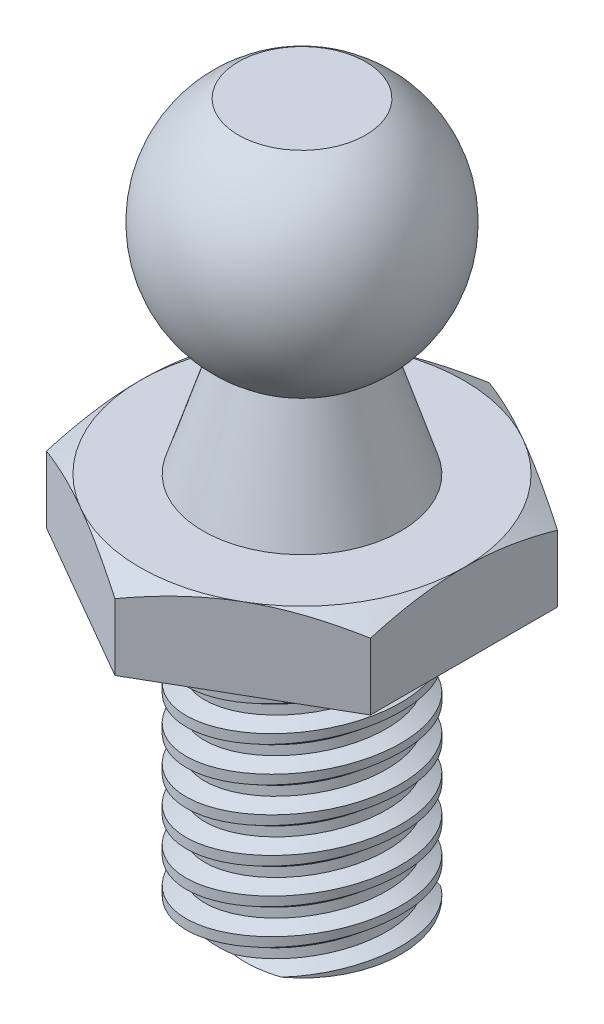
ISO-10303-21;
HEADER;
FILE_DESCRIPTION(('STEP AP214'),'2;1');
FILE_NAME('part.step','',(''),(''),'','','');
FILE_SCHEMA(('AUTOMOTIVE_DESIGN { 1 0 10303 214 1 1 1 1 }'));
ENDSEC;
DATA;
#1=APPLICATION_CONTEXT('core data for automotive mechanical design processes');
#2=APPLICATION_PROTOCOL_DEFINITION('international standard','automotive_design',2000,#1);
#3=PRODUCT_CONTEXT('',#1,'mechanical');
#4=PRODUCT('Part','Part','',(#3));
#5=PRODUCT_RELATED_PRODUCT_CATEGORY('part','',(#4));
#6=PRODUCT_DEFINITION_FORMATION('','',#4);
#7=PRODUCT_DEFINITION_CONTEXT('part definition',#1,'design');
#8=PRODUCT_DEFINITION('design','',#6,#7);
#9=PRODUCT_DEFINITION_SHAPE('','',#8);
#10=(LENGTH_UNIT() NAMED_UNIT(*) SI_UNIT(.MILLI.,.METRE.));
#11=(NAMED_UNIT(*) PLANE_ANGLE_UNIT() SI_UNIT($,.RADIAN.));
#12=(NAMED_UNIT(*) SI_UNIT($,.STERADIAN.) SOLID_ANGLE_UNIT());
#13=UNCERTAINTY_MEASURE_WITH_UNIT(LENGTH_MEASURE(1.E-05),#10,'distance_accuracy_value','');
#14=(GEOMETRIC_REPRESENTATION_CONTEXT(3) GLOBAL_UNCERTAINTY_ASSIGNED_CONTEXT((#13)) GLOBAL_UNIT_ASSIGNED_CONTEXT((#10,
#11,#12)) REPRESENTATION_CONTEXT('',''));
#15=CARTESIAN_POINT('',(0.,0.,0.));
#16=DIRECTION('',(0.,0.,1.));
#17=DIRECTION('',(1.,0.,0.));
#18=AXIS2_PLACEMENT_3D('',#15,#16,#17);
#19=CARTESIAN_POINT('',(6.50000000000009,21.9578280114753,-3.7527767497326));
#20=DIRECTION('',(1.00000000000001,0.,0.));
#21=DIRECTION('',(0.,1.,0.));
#22=AXIS2_PLACEMENT_3D('',#19,#20,#21);
#23=PLANE('',#22);
#24=DIRECTION('',(0.,-1.,0.));
#25=VECTOR('',#24,1.);
#26=CARTESIAN_POINT('',(6.50000000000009,21.9578280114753,-3.7527767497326));
#27=LINE('',#26,#25);
#28=CARTESIAN_POINT('',(6.50000000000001,1.51944341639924,-3.75277674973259));
#29=VERTEX_POINT('',#28);
#30=CARTESIAN_POINT('',(6.50000000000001,-1.15,-3.75277674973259));
#31=VERTEX_POINT('',#30);
#32=EDGE_CURVE('E155',#29,#31,#27,.T.);
#33=ORIENTED_EDGE('',*,*,#32,.F.);
#34=CARTESIAN_POINT('',(6.50000000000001,-1.08095730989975,-10.0985149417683));
#35=CARTESIAN_POINT('',(6.50000000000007,-0.943075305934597,-9.81442448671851));
#36=CARTESIAN_POINT('',(6.50000000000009,-0.80651030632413,-9.5296837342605));
#37=CARTESIAN_POINT('',(6.50000000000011,-0.536754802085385,-8.95855580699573));
#38=CARTESIAN_POINT('',(6.5000000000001,-0.403564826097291,-8.67216838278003));
#39=CARTESIAN_POINT('',(6.5000000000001,-0.140633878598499,-8.09593488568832));
#40=CARTESIAN_POINT('',(6.5000000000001,-0.0109154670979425,-7.80607848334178));
#41=CARTESIAN_POINT('',(6.5000000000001,0.243235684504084,-7.22406608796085));
#42=CARTESIAN_POINT('',(6.5000000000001,0.367668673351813,-6.93191020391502));
#43=CARTESIAN_POINT('',(6.5000000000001,0.613738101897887,-6.33541861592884));
#44=CARTESIAN_POINT('',(6.5000000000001,0.735157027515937,-6.03099269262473));
#45=CARTESIAN_POINT('',(6.5000000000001,0.968849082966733,-5.41858592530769));
#46=CARTESIAN_POINT('',(6.50000000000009,1.0811211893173,-5.11060468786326));
#47=CARTESIAN_POINT('',(6.5000000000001,1.2935864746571,-4.49116870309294));
#48=CARTESIAN_POINT('',(6.50000000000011,1.39380392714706,-4.17972236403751));
#49=CARTESIAN_POINT('',(6.50000000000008,1.57895531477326,-3.55235928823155));
#50=CARTESIAN_POINT('',(6.50000000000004,1.66389404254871,-3.23644398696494));
#51=CARTESIAN_POINT('',(6.50000000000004,1.81398594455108,-2.60169248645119));
#52=CARTESIAN_POINT('',(6.50000000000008,1.87924445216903,-2.28288159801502));
#53=CARTESIAN_POINT('',(6.50000000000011,1.98626936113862,-1.64123192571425));
#54=CARTESIAN_POINT('',(6.5000000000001,2.02803809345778,-1.31839354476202));
#55=CARTESIAN_POINT('',(6.5000000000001,2.07030127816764,-0.834548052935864));
#56=CARTESIAN_POINT('',(6.5000000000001,2.08098573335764,-0.674391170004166));
#57=CARTESIAN_POINT('',(6.5000000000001,2.09557715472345,-0.353761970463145));
#58=CARTESIAN_POINT('',(6.5000000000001,2.09948423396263,-0.193289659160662));
#59=CARTESIAN_POINT('',(6.50000000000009,2.10042016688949,0.127675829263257));
#60=CARTESIAN_POINT('',(6.50000000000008,2.09744895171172,0.288169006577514));
#61=CARTESIAN_POINT('',(6.50000000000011,2.0847030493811,0.608887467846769));
#62=CARTESIAN_POINT('',(6.50000000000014,2.0749280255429,0.7691127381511));
#63=CARTESIAN_POINT('',(6.50000000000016,2.04351744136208,1.15356140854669));
#64=CARTESIAN_POINT('',(6.50000000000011,2.01868813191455,1.37752936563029));
#65=CARTESIAN_POINT('',(6.50000000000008,1.9570843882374,1.82380504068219));
#66=CARTESIAN_POINT('',(6.50000000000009,1.92030835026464,2.04611253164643));
#67=CARTESIAN_POINT('',(6.50000000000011,1.79401006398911,2.71028289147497));
#68=CARTESIAN_POINT('',(6.5000000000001,1.6885398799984,3.14915331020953));
#69=CARTESIAN_POINT('',(6.5000000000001,1.50558052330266,3.80555173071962));
#70=CARTESIAN_POINT('',(6.5000000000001,1.43958997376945,4.02648029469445));
#71=CARTESIAN_POINT('',(6.5000000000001,1.30074434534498,4.46619094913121));
#72=CARTESIAN_POINT('',(6.50000000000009,1.22788921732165,4.68497302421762));
#73=CARTESIAN_POINT('',(6.5000000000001,1.07648453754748,5.12046127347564));
#74=CARTESIAN_POINT('',(6.50000000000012,0.997936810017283,5.3371680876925));
#75=CARTESIAN_POINT('',(6.50000000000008,0.836072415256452,5.76878342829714));
#76=CARTESIAN_POINT('',(6.50000000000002,0.752755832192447,5.98369198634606));
#77=CARTESIAN_POINT('',(6.49999999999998,0.534252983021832,6.53213338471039));
#78=CARTESIAN_POINT('',(6.50000000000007,0.396207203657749,6.86452551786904));
#79=CARTESIAN_POINT('',(6.50000000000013,0.112741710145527,7.5261611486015));
#80=CARTESIAN_POINT('',(6.50000000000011,-0.0326786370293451,7.85540437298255));
#81=CARTESIAN_POINT('',(6.50000000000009,-0.329253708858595,8.51141095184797));
#82=CARTESIAN_POINT('',(6.5000000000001,-0.480410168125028,8.83817351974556));
#83=CARTESIAN_POINT('',(6.5000000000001,-0.787171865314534,9.48958511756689));
#84=CARTESIAN_POINT('',(6.5000000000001,-0.942776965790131,9.81423421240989));
#85=CARTESIAN_POINT('',(6.5000000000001,-1.25773382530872,10.4622514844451));
#86=CARTESIAN_POINT('',(6.5000000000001,-1.41709038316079,10.7856173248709));
#87=CARTESIAN_POINT('',(6.5000000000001,-1.73865748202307,11.4309268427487));
#88=CARTESIAN_POINT('',(6.5000000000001,-1.9008680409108,11.7528705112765));
#89=CARTESIAN_POINT('',(6.5000000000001,-2.39089619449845,12.7168301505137));
#90=CARTESIAN_POINT('',(6.5000000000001,-2.72216687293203,13.3570901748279));
#91=CARTESIAN_POINT('',(6.5000000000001,-3.3587664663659,14.5727884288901));
#92=CARTESIAN_POINT('',(6.5000000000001,-3.66352010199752,15.1485293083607));
#93=CARTESIAN_POINT('',(6.5000000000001,-4.2768344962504,16.2980144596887));
#94=CARTESIAN_POINT('',(6.5000000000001,-4.58539543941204,16.871758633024));
#95=CARTESIAN_POINT('',(6.5000000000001,-5.2044593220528,18.0160290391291));
#96=CARTESIAN_POINT('',(6.5000000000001,-5.51495394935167,18.5865597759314));
#97=CARTESIAN_POINT('',(6.50000000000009,-6.13814804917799,19.7263670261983));
#98=CARTESIAN_POINT('',(6.50000000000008,-6.45084737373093,20.2956436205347));
#99=CARTESIAN_POINT('',(6.50000000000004,-6.76435647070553,20.8644710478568));
#100=B_SPLINE_CURVE_WITH_KNOTS('',3,(#34,#35,#36,#37,#38,#39,#40,#41,#42,#43,#44,#45,#46,#47,
#48,#49,#50,#51,#52,#53,#54,#55,#56,#57,#58,#59,#60,#61,#62,#63,#64,#65,#66,#67,#68,#69,#70,#71,
#72,#73,#74,#75,#76,#77,#78,#79,#80,#81,#82,#83,#84,#85,#86,#87,#88,#89,#90,#91,#92,#93,#94,#95,
#96,#97,#98,#99),.UNSPECIFIED.,.F.,.F.,(4,2,2,2,2,2,2,2,2,2,2,2,2,2,2,2,2,2,2,2,2,2,2,2,2,2,2,2,
2,2,2,2,4),(0.,0.947360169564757,1.8948678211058,2.84750200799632,3.80009131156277,
4.78321700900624,5.766452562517,6.74767387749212,7.72858686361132,8.70415257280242,
9.67962145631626,10.1610384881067,10.6424474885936,11.1238613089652,11.6052989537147,
12.2809380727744,12.9566679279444,14.3088484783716,15.0005111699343,15.6921788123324,
16.3836257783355,17.0750605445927,18.1546874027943,19.2344070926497,20.3144559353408,
21.3944714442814,22.4759529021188,23.5574411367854,25.7200319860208,27.674287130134,
29.6286373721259,31.5772753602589,33.5257837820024),.UNSPECIFIED.);
#101=CARTESIAN_POINT('',(6.50000000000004,2.1,0.));
#102=VERTEX_POINT('',#101);
#103=EDGE_CURVE('E294',#29,#102,#100,.T.);
#104=ORIENTED_EDGE('',*,*,#103,.T.);
#105=CARTESIAN_POINT('',(6.50000000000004,1.51944341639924,3.75277674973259));
#106=VERTEX_POINT('',#105);
#107=EDGE_CURVE('E285',#102,#106,#100,.T.);
#108=ORIENTED_EDGE('',*,*,#107,.T.);
#109=DIRECTION('',(0.,-1.,0.));
#110=VECTOR('',#109,1.);
#111=CARTESIAN_POINT('',(6.50000000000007,21.9578280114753,3.75277674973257));
#112=LINE('',#111,#110);
#113=CARTESIAN_POINT('',(6.50000000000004,-1.15,3.75277674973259));
#114=VERTEX_POINT('',#113);
#115=EDGE_CURVE('E923',#106,#114,#112,.T.);
#116=ORIENTED_EDGE('',*,*,#115,.T.);
#117=DIRECTION('',(0.,0.,1.00000000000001));
#118=VECTOR('',#117,1.);
#119=CARTESIAN_POINT('',(6.50000000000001,-1.15,-3.75277674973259));
#120=LINE('',#119,#118);
#121=EDGE_CURVE('E940',#31,#114,#120,.T.);
#122=ORIENTED_EDGE('',*,*,#121,.F.);
#123=EDGE_LOOP('',(#33,#104,#108,#116,#122));
#124=FACE_BOUND('',#123,.T.);
#125=ADVANCED_FACE('F37',(#124),#23,.T.);
#126=CARTESIAN_POINT('',(0.,21.9578280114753,-7.5055534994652));
#127=DIRECTION('',(0.500000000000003,0.,-0.866025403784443));
#128=DIRECTION('',(-0.866025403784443,0.,-0.500000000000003));
#129=AXIS2_PLACEMENT_3D('',#126,#127,#128);
#130=PLANE('',#129);
#131=DIRECTION('',(0.,-1.,0.));
#132=VECTOR('',#131,1.);
#133=CARTESIAN_POINT('',(0.,21.9578280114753,-7.5055534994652));
#134=LINE('',#133,#132);
#135=CARTESIAN_POINT('',(0.,1.51944341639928,-7.5055534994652));
#136=VERTEX_POINT('',#135);
#137=CARTESIAN_POINT('',(0.,-1.14999999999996,-7.5055534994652));
#138=VERTEX_POINT('',#137);
#139=EDGE_CURVE('E915',#136,#138,#134,.T.);
#140=ORIENTED_EDGE('',*,*,#139,.F.);
#141=CARTESIAN_POINT('',(-0.000200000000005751,1.51937674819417,-7.50566896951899));
#142=CARTESIAN_POINT('',(0.1426774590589,1.56699557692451,-7.42317863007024));
#143=CARTESIAN_POINT('',(0.286087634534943,1.61245329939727,-7.34038072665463));
#144=CARTESIAN_POINT('',(0.574072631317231,1.69845131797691,-7.17411251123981));
#145=CARTESIAN_POINT('',(0.718647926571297,1.73898949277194,-7.0906419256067));
#146=CARTESIAN_POINT('',(1.15468865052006,1.85242899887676,-6.83889369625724));
#147=CARTESIAN_POINT('',(1.44787528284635,1.91695219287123,-6.66962231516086));
#148=CARTESIAN_POINT('',(1.88662374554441,1.99261341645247,-6.4163107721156));
#149=CARTESIAN_POINT('',(2.03087463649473,2.01416714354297,-6.33302748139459));
#150=CARTESIAN_POINT('',(2.32002821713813,2.05030968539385,-6.16608458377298));
#151=CARTESIAN_POINT('',(2.46493084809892,2.0648991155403,-6.08242501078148));
#152=CARTESIAN_POINT('',(2.75498777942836,2.08674124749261,-5.91496056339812));
#153=CARTESIAN_POINT('',(2.90014160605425,2.09400227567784,-5.83115596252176));
#154=CARTESIAN_POINT('',(3.19057533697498,2.10103969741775,-5.66347396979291));
#155=CARTESIAN_POINT('',(3.33585523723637,2.10081632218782,-5.57959658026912));
#156=CARTESIAN_POINT('',(3.73387594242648,2.0899165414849,-5.34979921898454));
#157=CARTESIAN_POINT('',(3.98648646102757,2.07161818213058,-5.20395446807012));
#158=CARTESIAN_POINT('',(4.49002967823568,2.01359365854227,-4.91323365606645));
#159=CARTESIAN_POINT('',(4.74096060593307,1.97384766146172,-4.76835861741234));
#160=CARTESIAN_POINT('',(5.24551722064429,1.87449409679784,-4.4770527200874));
#161=CARTESIAN_POINT('',(5.49907924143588,1.81446557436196,-4.33065861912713));
#162=CARTESIAN_POINT('',(6.00242193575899,1.67822500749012,-4.04005357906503));
#163=CARTESIAN_POINT('',(6.25220905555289,1.60204496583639,-3.89583891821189));
#164=CARTESIAN_POINT('',(6.50019999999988,1.51937674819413,-3.75266127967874));
#165=B_SPLINE_CURVE_WITH_KNOTS('',3,(#141,#142,#143,#144,#145,#146,#147,#148,#149,#150,#151,
#152,#153,#154,#155,#156,#157,#158,#159,#160,#161,#162,#163,#164),.UNSPECIFIED.,.F.,.F.,(4,2,2,
2,2,2,2,2,2,2,2,4),(0.,0.515105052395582,1.03043143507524,2.06322554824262,2.56697389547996,
3.07067772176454,3.57380860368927,4.07692394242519,4.95279354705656,5.8294744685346,
6.72559912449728,7.61996451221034),.UNSPECIFIED.);
#166=CARTESIAN_POINT('',(3.24999999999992,2.10000000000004,-5.62916512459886));
#167=VERTEX_POINT('',#166);
#168=EDGE_CURVE('E978',#136,#167,#165,.T.);
#169=ORIENTED_EDGE('',*,*,#168,.T.);
#170=EDGE_CURVE('E938',#167,#29,#165,.T.);
#171=ORIENTED_EDGE('',*,*,#170,.T.);
#172=ORIENTED_EDGE('',*,*,#32,.T.);
#173=DIRECTION('',(0.866025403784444,0.,0.500000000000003));
#174=VECTOR('',#173,1.);
#175=CARTESIAN_POINT('',(0.,-1.14999999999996,-7.5055534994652));
#176=LINE('',#175,#174);
#177=EDGE_CURVE('E924',#138,#31,#176,.T.);
#178=ORIENTED_EDGE('',*,*,#177,.F.);
#179=EDGE_LOOP('',(#140,#169,#171,#172,#178));
#180=FACE_BOUND('',#179,.T.);
#181=ADVANCED_FACE('F265',(#180),#130,.T.);
#182=CARTESIAN_POINT('',(-6.5000000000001,21.9578280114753,-3.75277674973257));
#183=DIRECTION('',(-0.500000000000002,0.,-0.866025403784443));
#184=DIRECTION('',(-0.866025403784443,0.,0.500000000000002));
#185=AXIS2_PLACEMENT_3D('',#182,#183,#184);
#186=PLANE('',#185);
#187=DIRECTION('',(0.,-1.,0.));
#188=VECTOR('',#187,1.);
#189=CARTESIAN_POINT('',(-6.5000000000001,21.9578280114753,-3.75277674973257));
#190=LINE('',#189,#188);
#191=CARTESIAN_POINT('',(-6.50000000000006,1.51944341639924,-3.75277674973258));
#192=VERTEX_POINT('',#191);
#193=CARTESIAN_POINT('',(-6.50000000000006,-1.15,-3.75277674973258));
#194=VERTEX_POINT('',#193);
#195=EDGE_CURVE('E907',#192,#194,#190,.T.);
#196=ORIENTED_EDGE('',*,*,#195,.F.);
#197=CARTESIAN_POINT('',(-6.5002000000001,1.51937674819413,-3.75266127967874));
#198=CARTESIAN_POINT('',(-6.35732254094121,1.56699557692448,-3.83515161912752));
#199=CARTESIAN_POINT('',(-6.21391236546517,1.61245329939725,-3.91794952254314));
#200=CARTESIAN_POINT('',(-5.92592736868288,1.6984513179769,-4.08421773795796));
#201=CARTESIAN_POINT('',(-5.78135207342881,1.73898949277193,-4.16768832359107));
#202=CARTESIAN_POINT('',(-5.34531134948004,1.85242899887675,-4.41943655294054));
#203=CARTESIAN_POINT('',(-5.05212471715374,1.91695219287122,-4.58870793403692));
#204=CARTESIAN_POINT('',(-4.61337625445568,1.99261341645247,-4.84201947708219));
#205=CARTESIAN_POINT('',(-4.46912536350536,2.01416714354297,-4.9253027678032));
#206=CARTESIAN_POINT('',(-4.17997178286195,2.05030968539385,-5.09224566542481));
#207=CARTESIAN_POINT('',(-4.03506915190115,2.0648991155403,-5.17590523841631));
#208=CARTESIAN_POINT('',(-3.74501222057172,2.08674124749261,-5.34336968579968));
#209=CARTESIAN_POINT('',(-3.59985839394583,2.09400227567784,-5.42717428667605));
#210=CARTESIAN_POINT('',(-3.30942466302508,2.10103969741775,-5.59485627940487));
#211=CARTESIAN_POINT('',(-3.16414476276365,2.10081632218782,-5.67873366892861));
#212=CARTESIAN_POINT('',(-2.76612405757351,2.0899165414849,-5.90853103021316));
#213=CARTESIAN_POINT('',(-2.51351353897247,2.07161818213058,-6.05437578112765));
#214=CARTESIAN_POINT('',(-2.00997032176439,2.01359365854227,-6.34509659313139));
#215=CARTESIAN_POINT('',(-1.75903939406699,1.97384766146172,-6.48997163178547));
#216=CARTESIAN_POINT('',(-1.25448277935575,1.87449409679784,-6.7812775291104));
#217=CARTESIAN_POINT('',(-1.00092075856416,1.81446557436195,-6.92767163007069));
#218=CARTESIAN_POINT('',(-0.497578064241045,1.67822500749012,-7.21827667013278));
#219=CARTESIAN_POINT('',(-0.247790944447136,1.60204496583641,-7.36249133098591));
#220=CARTESIAN_POINT('',(0.000199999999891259,1.51937674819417,-7.50566896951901));
#221=B_SPLINE_CURVE_WITH_KNOTS('',3,(#197,#198,#199,#200,#201,#202,#203,#204,#205,#206,#207,
#208,#209,#210,#211,#212,#213,#214,#215,#216,#217,#218,#219,#220),.UNSPECIFIED.,.F.,.F.,(4,2,2,
2,2,2,2,2,2,2,2,4),(0.,0.515105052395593,1.03043143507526,2.06322554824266,2.56697389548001,
3.07067772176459,3.57380860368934,4.07692394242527,4.95279354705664,5.82947446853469,
6.72559912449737,7.61996451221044),.UNSPECIFIED.);
#222=CARTESIAN_POINT('',(-3.25,2.10000000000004,-5.62916512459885));
#223=VERTEX_POINT('',#222);
#224=EDGE_CURVE('E909',#192,#223,#221,.T.);
#225=ORIENTED_EDGE('',*,*,#224,.T.);
#226=EDGE_CURVE('E320',#223,#136,#221,.T.);
#227=ORIENTED_EDGE('',*,*,#226,.T.);
#228=ORIENTED_EDGE('',*,*,#139,.T.);
#229=DIRECTION('',(0.866025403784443,0.,-0.500000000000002));
#230=VECTOR('',#229,1.);
#231=CARTESIAN_POINT('',(-6.50000000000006,-1.15,-3.75277674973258));
#232=LINE('',#231,#230);
#233=EDGE_CURVE('E911',#194,#138,#232,.T.);
#234=ORIENTED_EDGE('',*,*,#233,.F.);
#235=EDGE_LOOP('',(#196,#225,#227,#228,#234));
#236=FACE_BOUND('',#235,.T.);
#237=ADVANCED_FACE('F271',(#236),#186,.T.);
#238=CARTESIAN_POINT('',(-6.50000000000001,21.9578280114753,3.7527767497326));
#239=DIRECTION('',(-1.00000000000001,0.,0.));
#240=DIRECTION('',(0.,-1.,0.));
#241=AXIS2_PLACEMENT_3D('',#238,#239,#240);
#242=PLANE('',#241);
#243=DIRECTION('',(0.,-1.,0.));
#244=VECTOR('',#243,1.);
#245=CARTESIAN_POINT('',(-6.50000000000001,21.9578280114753,3.7527767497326));
#246=LINE('',#245,#244);
#247=CARTESIAN_POINT('',(-6.49999999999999,1.51944341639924,3.75277674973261));
#248=VERTEX_POINT('',#247);
#249=CARTESIAN_POINT('',(-6.49999999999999,-1.15,3.75277674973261));
#250=VERTEX_POINT('',#249);
#251=EDGE_CURVE('E916',#248,#250,#246,.T.);
#252=ORIENTED_EDGE('',*,*,#251,.F.);
#253=CARTESIAN_POINT('',(-6.50000000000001,-1.08095731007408,-10.0985149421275));
#254=CARTESIAN_POINT('',(-6.50000000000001,-0.943075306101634,-9.81442448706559));
#255=CARTESIAN_POINT('',(-6.5,-0.806510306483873,-9.52968373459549));
#256=CARTESIAN_POINT('',(-6.5,-0.536754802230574,-8.95855580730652));
#257=CARTESIAN_POINT('',(-6.5,-0.403564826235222,-8.67216838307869));
#258=CARTESIAN_POINT('',(-6.5,-0.140633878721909,-8.09593488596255));
#259=CARTESIAN_POINT('',(-6.5,-0.0109154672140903,-7.8060784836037));
#260=CARTESIAN_POINT('',(-6.5,0.243235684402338,-7.22406608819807));
#261=CARTESIAN_POINT('',(-6.5,0.367668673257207,-6.93191020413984));
#262=CARTESIAN_POINT('',(-6.5,0.61373810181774,-6.33541861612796));
#263=CARTESIAN_POINT('',(-6.5,0.735157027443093,-6.03099269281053));
#264=CARTESIAN_POINT('',(-6.50000000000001,0.968849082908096,-5.41858592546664));
#265=CARTESIAN_POINT('',(-6.50000000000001,1.08112118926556,-5.11060468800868));
#266=CARTESIAN_POINT('',(-6.5,1.29358647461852,-4.49116870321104));
#267=CARTESIAN_POINT('',(-6.49999999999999,1.39380392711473,-4.17972236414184));
#268=CARTESIAN_POINT('',(-6.50000000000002,1.57895531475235,-3.55235928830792));
#269=CARTESIAN_POINT('',(-6.50000000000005,1.66389404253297,-3.23644398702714));
#270=CARTESIAN_POINT('',(-6.50000000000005,1.81398594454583,-2.60169248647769));
#271=CARTESIAN_POINT('',(-6.50000000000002,1.87924445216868,-2.28288159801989));
#272=CARTESIAN_POINT('',(-6.49999999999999,1.98626936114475,-1.64123192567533));
#273=CARTESIAN_POINT('',(-6.5,2.02803809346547,-1.31839354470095));
#274=CARTESIAN_POINT('',(-6.50000000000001,2.07030127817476,-0.834548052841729));
#275=CARTESIAN_POINT('',(-6.50000000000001,2.08098573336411,-0.674391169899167));
#276=CARTESIAN_POINT('',(-6.50000000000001,2.09557715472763,-0.353761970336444));
#277=CARTESIAN_POINT('',(-6.50000000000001,2.0994842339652,-0.193289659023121));
#278=CARTESIAN_POINT('',(-6.50000000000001,2.10042016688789,0.127675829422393));
#279=CARTESIAN_POINT('',(-6.5,2.09744895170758,0.288169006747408));
#280=CARTESIAN_POINT('',(-6.50000000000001,2.08470304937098,0.608887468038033));
#281=CARTESIAN_POINT('',(-6.50000000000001,2.07492802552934,0.769112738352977));
#282=CARTESIAN_POINT('',(-6.50000000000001,2.04351744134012,1.15356140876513));
#283=CARTESIAN_POINT('',(-6.50000000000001,2.01868813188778,1.37752936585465));
#284=CARTESIAN_POINT('',(-6.5,1.95708438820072,1.82380504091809));
#285=CARTESIAN_POINT('',(-6.50000000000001,1.92030835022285,2.04611253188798));
#286=CARTESIAN_POINT('',(-6.50000000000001,1.79401006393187,2.71028289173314));
#287=CARTESIAN_POINT('',(-6.50000000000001,1.68853987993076,3.14915331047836));
#288=CARTESIAN_POINT('',(-6.50000000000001,1.50558052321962,3.8055517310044));
#289=CARTESIAN_POINT('',(-6.50000000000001,1.43958997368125,4.02648029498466));
#290=CARTESIAN_POINT('',(-6.50000000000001,1.30074434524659,4.4661909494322));
#291=CARTESIAN_POINT('',(-6.50000000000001,1.22788921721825,4.68497302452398));
#292=CARTESIAN_POINT('',(-6.50000000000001,1.07648453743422,5.1204612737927));
#293=CARTESIAN_POINT('',(-6.50000000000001,0.997936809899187,5.3371680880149));
#294=CARTESIAN_POINT('',(-6.5,0.836072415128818,5.7687834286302));
#295=CARTESIAN_POINT('',(-6.5,0.752755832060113,5.98369198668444));
#296=CARTESIAN_POINT('',(-6.49999999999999,0.534252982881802,6.53213338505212));
#297=CARTESIAN_POINT('',(-6.5,0.396207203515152,6.86452551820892));
#298=CARTESIAN_POINT('',(-6.50000000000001,0.112741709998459,7.5261611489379));
#299=CARTESIAN_POINT('',(-6.50000000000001,-0.0326786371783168,7.85540437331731));
#300=CARTESIAN_POINT('',(-6.50000000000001,-0.329253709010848,8.51141095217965));
#301=CARTESIAN_POINT('',(-6.50000000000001,-0.480410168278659,8.83817352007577));
#302=CARTESIAN_POINT('',(-6.50000000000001,-0.787171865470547,9.48958511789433));
#303=CARTESIAN_POINT('',(-6.50000000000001,-0.942776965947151,9.81423421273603));
#304=CARTESIAN_POINT('',(-6.50000000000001,-1.25773382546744,10.4622514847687));
#305=CARTESIAN_POINT('',(-6.50000000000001,-1.4170903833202,10.7856173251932));
#306=CARTESIAN_POINT('',(-6.50000000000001,-1.73865748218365,11.4309268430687));
#307=CARTESIAN_POINT('',(-6.50000000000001,-1.90086804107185,11.7528705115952));
#308=CARTESIAN_POINT('',(-6.50000000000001,-2.3908961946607,12.7168301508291));
#309=CARTESIAN_POINT('',(-6.50000000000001,-2.72216687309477,13.3570901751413));
#310=CARTESIAN_POINT('',(-6.50000000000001,-3.35876646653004,14.5727884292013));
#311=CARTESIAN_POINT('',(-6.50000000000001,-3.66352010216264,15.1485293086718));
#312=CARTESIAN_POINT('',(-6.50000000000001,-4.27683449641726,16.2980144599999));
#313=CARTESIAN_POINT('',(-6.50000000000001,-4.58539543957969,16.8717586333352));
#314=CARTESIAN_POINT('',(-6.50000000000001,-5.204459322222,18.0160290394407));
#315=CARTESIAN_POINT('',(-6.50000000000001,-5.51495394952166,18.5865597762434));
#316=CARTESIAN_POINT('',(-6.50000000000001,-6.13814804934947,19.726367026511));
#317=CARTESIAN_POINT('',(-6.5,-6.4508473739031,20.2956436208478));
#318=CARTESIAN_POINT('',(-6.49999999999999,-6.76435647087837,20.8644710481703));
#319=B_SPLINE_CURVE_WITH_KNOTS('',3,(#253,#254,#255,#256,#257,#258,#259,#260,#261,#262,#263,
#264,#265,#266,#267,#268,#269,#270,#271,#272,#273,#274,#275,#276,#277,#278,#279,#280,#281,#282,
#283,#284,#285,#286,#287,#288,#289,#290,#291,#292,#293,#294,#295,#296,#297,#298,#299,#300,#301,
#302,#303,#304,#305,#306,#307,#308,#309,#310,#311,#312,#313,#314,#315,#316,#317,#318),
.UNSPECIFIED.,.F.,.F.,(4,2,2,2,2,2,2,2,2,2,2,2,2,2,2,2,2,2,2,2,2,2,2,2,2,2,2,2,2,2,2,2,4),(0.,
0.947360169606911,1.89486782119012,2.84750200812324,3.8000913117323,4.78321700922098,
5.76645256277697,6.74767387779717,7.7285868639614,8.70415257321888,9.679621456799,
10.1610384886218,10.642447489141,11.123861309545,11.605298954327,12.2809380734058,
12.956667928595,14.3088484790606,15.0005111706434,15.6921788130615,16.3836257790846,
17.0750605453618,18.1546874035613,19.2344070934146,20.3144559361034,21.3944714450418,
22.4759529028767,23.5574411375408,25.7200319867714,27.6742871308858,29.6286373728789,
31.577275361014,33.5257837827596),.UNSPECIFIED.);
#320=CARTESIAN_POINT('',(-6.50000000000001,2.1,0.));
#321=VERTEX_POINT('',#320);
#322=EDGE_CURVE('E301',#248,#321,#319,.F.);
#323=ORIENTED_EDGE('',*,*,#322,.T.);
#324=EDGE_CURVE('E957',#321,#192,#319,.F.);
#325=ORIENTED_EDGE('',*,*,#324,.T.);
#326=ORIENTED_EDGE('',*,*,#195,.T.);
#327=DIRECTION('',(0.,0.,-1.00000000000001));
#328=VECTOR('',#327,1.);
#329=CARTESIAN_POINT('',(-6.49999999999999,-1.15,3.75277674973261));
#330=LINE('',#329,#328);
#331=EDGE_CURVE('E931',#250,#194,#330,.T.);
#332=ORIENTED_EDGE('',*,*,#331,.F.);
#333=EDGE_LOOP('',(#252,#323,#325,#326,#332));
#334=FACE_BOUND('',#333,.T.);
#335=ADVANCED_FACE('F741',(#334),#242,.T.);
#336=CARTESIAN_POINT('',(-1.09287578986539E-13,21.9578280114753,7.50555349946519));
#337=DIRECTION('',(-0.500000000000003,0.,0.866025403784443));
#338=DIRECTION('',(0.866025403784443,0.,0.500000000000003));
#339=AXIS2_PLACEMENT_3D('',#336,#337,#338);
#340=PLANE('',#339);
#341=DIRECTION('',(0.,-1.,0.));
#342=VECTOR('',#341,1.);
#343=CARTESIAN_POINT('',(-1.09287578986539E-13,21.9578280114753,7.50555349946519));
#344=LINE('',#343,#342);
#345=CARTESIAN_POINT('',(-1.11022302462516E-13,1.51944341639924,7.50555349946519));
#346=VERTEX_POINT('',#345);
#347=CARTESIAN_POINT('',(-1.11022302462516E-13,-1.15,7.50555349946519));
#348=VERTEX_POINT('',#347);
#349=EDGE_CURVE('E919',#346,#348,#344,.T.);
#350=ORIENTED_EDGE('',*,*,#349,.F.);
#351=CARTESIAN_POINT('',(0.000199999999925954,1.51937674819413,7.50566896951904));
#352=CARTESIAN_POINT('',(-0.142677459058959,1.56699557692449,7.42317863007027));
#353=CARTESIAN_POINT('',(-0.286087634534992,1.61245329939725,7.34038072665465));
#354=CARTESIAN_POINT('',(-0.574072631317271,1.6984513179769,7.17411251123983));
#355=CARTESIAN_POINT('',(-0.718647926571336,1.73898949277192,7.09064192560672));
#356=CARTESIAN_POINT('',(-1.1546886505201,1.85242899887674,6.83889369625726));
#357=CARTESIAN_POINT('',(-1.44787528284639,1.91695219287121,6.66962231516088));
#358=CARTESIAN_POINT('',(-1.88662374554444,1.99261341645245,6.41631077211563));
#359=CARTESIAN_POINT('',(-2.03087463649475,2.01416714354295,6.33302748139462));
#360=CARTESIAN_POINT('',(-2.32002821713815,2.05030968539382,6.16608458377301));
#361=CARTESIAN_POINT('',(-2.46493084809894,2.06489911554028,6.08242501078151));
#362=CARTESIAN_POINT('',(-2.75498777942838,2.08674124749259,5.91496056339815));
#363=CARTESIAN_POINT('',(-2.90014160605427,2.09400227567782,5.8311559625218));
#364=CARTESIAN_POINT('',(-3.19057533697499,2.10103969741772,5.66347396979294));
#365=CARTESIAN_POINT('',(-3.33585523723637,2.10081632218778,5.57959658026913));
#366=CARTESIAN_POINT('',(-3.73387594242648,2.08991654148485,5.34979921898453));
#367=CARTESIAN_POINT('',(-3.9864864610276,2.07161818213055,5.20395446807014));
#368=CARTESIAN_POINT('',(-4.49002967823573,2.01359365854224,4.91323365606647));
#369=CARTESIAN_POINT('',(-4.74096060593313,1.97384766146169,4.76835861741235));
#370=CARTESIAN_POINT('',(-5.24551722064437,1.8744940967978,4.4770527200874));
#371=CARTESIAN_POINT('',(-5.49907924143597,1.81446557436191,4.33065861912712));
#372=CARTESIAN_POINT('',(-6.0024219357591,1.67822500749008,4.04005357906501));
#373=CARTESIAN_POINT('',(-6.25220905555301,1.60204496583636,3.89583891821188));
#374=CARTESIAN_POINT('',(-6.50020000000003,1.51937674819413,3.75266127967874));
#375=B_SPLINE_CURVE_WITH_KNOTS('',3,(#351,#352,#353,#354,#355,#356,#357,#358,#359,#360,#361,
#362,#363,#364,#365,#366,#367,#368,#369,#370,#371,#372,#373,#374),.UNSPECIFIED.,.F.,.F.,(4,2,2,
2,2,2,2,2,2,2,2,4),(0.,0.515105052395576,1.03043143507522,2.06322554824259,2.56697389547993,
3.0706777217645,3.57380860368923,4.07692394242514,4.95279354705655,5.82947446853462,
6.72559912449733,7.61996451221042),.UNSPECIFIED.);
#376=CARTESIAN_POINT('',(-3.25,2.1,5.62916512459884));
#377=VERTEX_POINT('',#376);
#378=EDGE_CURVE('E295',#346,#377,#375,.T.);
#379=ORIENTED_EDGE('',*,*,#378,.T.);
#380=EDGE_CURVE('E955',#377,#248,#375,.T.);
#381=ORIENTED_EDGE('',*,*,#380,.T.);
#382=ORIENTED_EDGE('',*,*,#251,.T.);
#383=DIRECTION('',(-0.866025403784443,0.,-0.500000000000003));
#384=VECTOR('',#383,1.);
#385=CARTESIAN_POINT('',(-1.11022302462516E-13,-1.15,7.50555349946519));
#386=LINE('',#385,#384);
#387=EDGE_CURVE('E944',#348,#250,#386,.T.);
#388=ORIENTED_EDGE('',*,*,#387,.F.);
#389=EDGE_LOOP('',(#350,#379,#381,#382,#388));
#390=FACE_BOUND('',#389,.T.);
#391=ADVANCED_FACE('F732',(#390),#340,.T.);
#392=CARTESIAN_POINT('',(6.50000000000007,21.9578280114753,3.75277674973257));
#393=DIRECTION('',(0.500000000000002,0.,0.866025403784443));
#394=DIRECTION('',(0.866025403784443,0.,-0.500000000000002));
#395=AXIS2_PLACEMENT_3D('',#392,#393,#394);
#396=PLANE('',#395);
#397=ORIENTED_EDGE('',*,*,#115,.F.);
#398=CARTESIAN_POINT('',(6.50019999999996,1.51937674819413,3.75266127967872));
#399=CARTESIAN_POINT('',(6.3573225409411,1.56699557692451,3.83515161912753));
#400=CARTESIAN_POINT('',(6.21391236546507,1.61245329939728,3.91794952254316));
#401=CARTESIAN_POINT('',(5.9259273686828,1.69845131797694,4.084217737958));
#402=CARTESIAN_POINT('',(5.78135207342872,1.73898949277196,4.1676883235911));
#403=CARTESIAN_POINT('',(5.34531134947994,1.85242899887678,4.41943655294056));
#404=CARTESIAN_POINT('',(5.05212471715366,1.91695219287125,4.58870793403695));
#405=CARTESIAN_POINT('',(4.61337625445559,1.99261341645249,4.84201947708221));
#406=CARTESIAN_POINT('',(4.46912536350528,2.014167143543,4.92530276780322));
#407=CARTESIAN_POINT('',(4.17997178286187,2.05030968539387,5.09224566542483));
#408=CARTESIAN_POINT('',(4.03506915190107,2.06489911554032,5.17590523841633));
#409=CARTESIAN_POINT('',(3.74501222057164,2.08674124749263,5.3433696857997));
#410=CARTESIAN_POINT('',(3.59985839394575,2.09400227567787,5.42717428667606));
#411=CARTESIAN_POINT('',(3.309424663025,2.10103969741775,5.5948562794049));
#412=CARTESIAN_POINT('',(3.16414476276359,2.10081632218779,5.67873366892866));
#413=CARTESIAN_POINT('',(2.76612405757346,2.08991654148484,5.90853103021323));
#414=CARTESIAN_POINT('',(2.51351353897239,2.07161818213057,6.05437578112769));
#415=CARTESIAN_POINT('',(2.0099703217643,2.01359365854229,6.3450965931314));
#416=CARTESIAN_POINT('',(1.7590393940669,1.97384766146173,6.48997163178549));
#417=CARTESIAN_POINT('',(1.25448277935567,1.87449409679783,6.78127752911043));
#418=CARTESIAN_POINT('',(1.00092075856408,1.81446557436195,6.92767163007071));
#419=CARTESIAN_POINT('',(0.497578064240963,1.67822500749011,7.2182766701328));
#420=CARTESIAN_POINT('',(0.247790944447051,1.60204496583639,7.36249133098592));
#421=CARTESIAN_POINT('',(-0.000199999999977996,1.51937674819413,7.50566896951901));
#422=B_SPLINE_CURVE_WITH_KNOTS('',3,(#398,#399,#400,#401,#402,#403,#404,#405,#406,#407,#408,
#409,#410,#411,#412,#413,#414,#415,#416,#417,#418,#419,#420,#421),.UNSPECIFIED.,.F.,.F.,(4,2,2,
2,2,2,2,2,2,2,2,4),(0.,0.515105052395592,1.03043143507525,2.06322554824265,2.56697389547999,
3.07067772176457,3.57380860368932,4.07692394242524,4.95279354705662,5.82947446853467,
6.72559912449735,7.61996451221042),.UNSPECIFIED.);
#423=CARTESIAN_POINT('',(3.25000000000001,2.1,5.6291651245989));
#424=VERTEX_POINT('',#423);
#425=EDGE_CURVE('E334',#106,#424,#422,.T.);
#426=ORIENTED_EDGE('',*,*,#425,.T.);
#427=EDGE_CURVE('E60',#424,#346,#422,.T.);
#428=ORIENTED_EDGE('',*,*,#427,.T.);
#429=ORIENTED_EDGE('',*,*,#349,.T.);
#430=DIRECTION('',(-0.866025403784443,0.,0.500000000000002));
#431=VECTOR('',#430,1.);
#432=CARTESIAN_POINT('',(6.50000000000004,-1.15,3.75277674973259));
#433=LINE('',#432,#431);
#434=EDGE_CURVE('E943',#114,#348,#433,.T.);
#435=ORIENTED_EDGE('',*,*,#434,.F.);
#436=EDGE_LOOP('',(#397,#426,#428,#429,#435));
#437=FACE_BOUND('',#436,.T.);
#438=ADVANCED_FACE('F278',(#437),#396,.T.);
#439=CARTESIAN_POINT('',(0.,-15.15,0.));
#440=DIRECTION('',(0.,1.,0.));
#441=DIRECTION('',(-1.00000000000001,0.,0.));
#442=AXIS2_PLACEMENT_3D('',#439,#440,#441);
#443=CYLINDRICAL_SURFACE('',#442,3.96875);
#444=CARTESIAN_POINT('',(0.,-12.61,0.));
#445=DIRECTION('',(0.,1.,0.));
#446=DIRECTION('',(0.,0.,1.00000000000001));
#447=AXIS2_PLACEMENT_3D('',#444,#445,#446);
#448=CIRCLE('',#447,3.96875);
#449=CARTESIAN_POINT('',(2.36464855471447,-12.61,3.18738353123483));
#450=VERTEX_POINT('',#449);
#451=CARTESIAN_POINT('',(2.36464855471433,-12.61,-3.18738353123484));
#452=VERTEX_POINT('',#451);
#453=EDGE_CURVE('E338',#450,#452,#448,.T.);
#454=ORIENTED_EDGE('',*,*,#453,.T.);
#455=CARTESIAN_POINT('',(-3.92686593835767,-13.8426502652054,-0.575065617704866));
#456=CARTESIAN_POINT('',(-3.95399240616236,-13.8484649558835,-0.389854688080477));
#457=CARTESIAN_POINT('',(-3.96799452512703,-13.8514717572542,-0.202660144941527));
#458=CARTESIAN_POINT('',(-3.96944553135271,-13.8517831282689,0.171812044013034));
#459=CARTESIAN_POINT('',(-3.95689978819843,-13.849088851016,0.359089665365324));
#460=CARTESIAN_POINT('',(-3.905554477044,-13.8380814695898,0.729817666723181));
#461=CARTESIAN_POINT('',(-3.86675805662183,-13.8297690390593,0.913268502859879));
#462=CARTESIAN_POINT('',(-3.76382484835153,-13.8077789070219,1.27262051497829));
#463=CARTESIAN_POINT('',(-3.69967911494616,-13.7940993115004,1.44851900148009));
#464=CARTESIAN_POINT('',(-3.53442793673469,-13.7589981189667,1.81837649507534));
#465=CARTESIAN_POINT('',(-3.42887749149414,-13.7366525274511,2.01027879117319));
#466=CARTESIAN_POINT('',(-3.18813960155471,-13.6859974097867,2.37366818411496));
#467=CARTESIAN_POINT('',(-3.05293863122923,-13.65768516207,2.54514590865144));
#468=CARTESIAN_POINT('',(-2.75448629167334,-13.5956374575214,2.86574435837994));
#469=CARTESIAN_POINT('',(-2.59082405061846,-13.5618231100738,3.01446736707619));
#470=CARTESIAN_POINT('',(-2.24169120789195,-13.4902830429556,3.28241301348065));
#471=CARTESIAN_POINT('',(-2.05622005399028,-13.4525572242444,3.40163490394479));
#472=CARTESIAN_POINT('',(-1.66460813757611,-13.3736087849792,3.60973897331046));
#473=CARTESIAN_POINT('',(-1.45812218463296,-13.3323304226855,3.69795068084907));
#474=CARTESIAN_POINT('',(-1.03352954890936,-13.2482514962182,3.83833340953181));
#475=CARTESIAN_POINT('',(-0.815421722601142,-13.2054507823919,3.89050087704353));
#476=CARTESIAN_POINT('',(-0.370513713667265,-13.1189730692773,3.95790487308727));
#477=CARTESIAN_POINT('',(-0.143634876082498,-13.0752921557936,3.97261839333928));
#478=CARTESIAN_POINT('',(0.309496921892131,-12.9888705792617,3.96314849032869));
#479=CARTESIAN_POINT('',(0.535749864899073,-12.9461299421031,3.93896399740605));
#480=CARTESIAN_POINT('',(0.981637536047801,-12.8626468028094,3.85214901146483));
#481=CARTESIAN_POINT('',(1.20125807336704,-12.8219084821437,3.78944147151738));
#482=CARTESIAN_POINT('',(1.62699998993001,-12.743578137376,3.62708484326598));
#483=CARTESIAN_POINT('',(1.83312185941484,-12.705985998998,3.52743709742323));
#484=CARTESIAN_POINT('',(2.22394082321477,-12.6352196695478,3.29489042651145));
#485=CARTESIAN_POINT('',(2.40881399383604,-12.6020087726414,3.16229873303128));
#486=CARTESIAN_POINT('',(2.75366645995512,-12.5404301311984,2.86702144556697));
#487=CARTESIAN_POINT('',(2.91364769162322,-12.5120620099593,2.70433819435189));
#488=CARTESIAN_POINT('',(3.20158094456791,-12.4612484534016,2.35608632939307));
#489=CARTESIAN_POINT('',(3.32997516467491,-12.4387209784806,2.17089531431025));
#490=CARTESIAN_POINT('',(3.5538067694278,-12.3995831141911,1.78099695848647));
#491=CARTESIAN_POINT('',(3.64924697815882,-12.3829722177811,1.5762912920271));
#492=CARTESIAN_POINT('',(3.80302377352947,-12.3562645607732,1.15639557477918));
#493=CARTESIAN_POINT('',(3.86188146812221,-12.3460762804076,0.941402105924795));
#494=CARTESIAN_POINT('',(3.9428321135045,-12.3320745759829,0.504402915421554));
#495=CARTESIAN_POINT('',(3.96492730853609,-12.3282607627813,0.282397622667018));
#496=CARTESIAN_POINT('',(3.97163173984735,-12.3271029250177,-0.160165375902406));
#497=CARTESIAN_POINT('',(3.95658027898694,-12.3297003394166,-0.380717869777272));
#498=CARTESIAN_POINT('',(3.89017072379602,-12.3411812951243,-0.816113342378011));
#499=CARTESIAN_POINT('',(3.83881329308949,-12.3500647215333,-1.0309564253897));
#500=CARTESIAN_POINT('',(3.70142350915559,-12.3739020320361,-1.44870791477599));
#501=CARTESIAN_POINT('',(3.61541723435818,-12.3888513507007,-1.65162516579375));
#502=CARTESIAN_POINT('',(3.41133454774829,-12.4244752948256,-2.04007710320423));
#503=CARTESIAN_POINT('',(3.29325725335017,-12.4451500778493,-2.22561131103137));
#504=CARTESIAN_POINT('',(3.02750990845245,-12.4919320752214,-2.57561890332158));
#505=CARTESIAN_POINT('',(2.87961871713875,-12.5180799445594,-2.73991888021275));
#506=CARTESIAN_POINT('',(2.55916573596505,-12.5751055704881,-3.0413897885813));
#507=CARTESIAN_POINT('',(2.38660238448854,-12.6059836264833,-3.17855900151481));
#508=CARTESIAN_POINT('',(2.01922733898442,-12.6722093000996,-3.42390869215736));
#509=CARTESIAN_POINT('',(1.8241431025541,-12.7076123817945,-3.53166603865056));
#510=CARTESIAN_POINT('',(1.41924942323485,-12.7817032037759,-3.71293962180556));
#511=CARTESIAN_POINT('',(1.20943878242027,-12.82039121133,-3.78645306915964));
#512=CARTESIAN_POINT('',(0.777661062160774,-12.9007198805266,-3.89829491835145));
#513=CARTESIAN_POINT('',(0.555557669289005,-12.9423964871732,-3.93607145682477));
#514=CARTESIAN_POINT('',(0.10841082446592,-13.0270930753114,-3.97360945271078));
#515=CARTESIAN_POINT('',(-0.116632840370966,-13.0701131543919,-3.97336814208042));
#516=CARTESIAN_POINT('',(-0.565878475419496,-13.1568100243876,-3.93473469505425));
#517=CARTESIAN_POINT('',(-0.79004423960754,-13.200488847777,-3.89592479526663));
#518=CARTESIAN_POINT('',(-1.22867710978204,-13.2867598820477,-3.78057638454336));
#519=CARTESIAN_POINT('',(-1.44314398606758,-13.3293520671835,-3.70403698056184));
#520=CARTESIAN_POINT('',(-1.85647960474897,-13.4121647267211,-3.5151312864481));
#521=CARTESIAN_POINT('',(-2.05533087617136,-13.4523825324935,-3.40272556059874));
#522=CARTESIAN_POINT('',(-2.43133425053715,-13.5290364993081,-3.14507882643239));
#523=CARTESIAN_POINT('',(-2.60848640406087,-13.5654726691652,-2.99983789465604));
#524=CARTESIAN_POINT('',(-2.93384322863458,-13.6328472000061,-2.68228274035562));
#525=CARTESIAN_POINT('',(-3.08235102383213,-13.6638427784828,-2.51029133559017));
#526=CARTESIAN_POINT('',(-3.34821525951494,-13.7196292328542,-2.14284992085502));
#527=CARTESIAN_POINT('',(-3.4655818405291,-13.7444221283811,-1.94740757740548));
#528=CARTESIAN_POINT('',(-3.65516625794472,-13.7846218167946,-1.55963999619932));
#529=CARTESIAN_POINT('',(-3.73076997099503,-13.8007284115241,-1.36903329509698));
#530=CARTESIAN_POINT('',(-3.85176876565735,-13.8265592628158,-0.978095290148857));
#531=CARTESIAN_POINT('',(-3.89717756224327,-13.8362864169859,-0.777768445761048));
#532=CARTESIAN_POINT('',(-3.92686593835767,-13.8426502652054,-0.575065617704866));
#533=B_SPLINE_CURVE_WITH_KNOTS('',3,(#455,#456,#457,#458,#459,#460,#461,#462,#463,#464,#465,
#466,#467,#468,#469,#470,#471,#472,#473,#474,#475,#476,#477,#478,#479,#480,#481,#482,#483,#484,
#485,#486,#487,#488,#489,#490,#491,#492,#493,#494,#495,#496,#497,#498,#499,#500,#501,#502,#503,
#504,#505,#506,#507,#508,#509,#510,#511,#512,#513,#514,#515,#516,#517,#518,#519,#520,#521,#522,
#523,#524,#525,#526,#527,#528,#529,#530,#531,#532),.UNSPECIFIED.,.T.,.F.,(4,2,2,2,2,2,2,2,2,2,2,
2,2,2,2,2,2,2,2,2,2,2,2,2,2,2,2,2,2,2,2,2,2,2,2,2,2,2,4),(0.,0.561295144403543,1.12247677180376,
1.68359112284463,2.2449036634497,2.90222214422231,3.55984109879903,4.22788991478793,
4.89595565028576,5.57768646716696,6.25948448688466,6.9507521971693,7.64203891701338,
8.33471274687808,9.02736140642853,9.71377821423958,10.4001416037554,11.0762660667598,
11.7523325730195,12.4185336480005,13.0846940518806,13.7447922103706,14.4048783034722,
15.0644685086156,15.7240768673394,16.3887707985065,17.0535068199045,17.7273546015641,
18.4012572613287,19.0854044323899,19.7696014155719,20.4612910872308,21.1529971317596,
21.8454663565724,22.5379339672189,23.2226144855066,23.9070717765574,24.5216567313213,
25.1359623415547),.UNSPECIFIED.);
#534=EDGE_CURVE('E226',#450,#452,#533,.T.);
#535=ORIENTED_EDGE('',*,*,#534,.F.);
#536=EDGE_LOOP('',(#454,#535));
#537=FACE_BOUND('',#536,.T.);
#538=ADVANCED_FACE('F349',(#537),#443,.T.);
#539=CARTESIAN_POINT('',(-3.2122385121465,-12.2799860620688,-2.33077246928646));
#540=CARTESIAN_POINT('',(-3.32016404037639,-12.3026301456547,-2.18203085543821));
#541=CARTESIAN_POINT('',(-3.4178880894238,-12.3232432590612,-2.02557315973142));
#542=CARTESIAN_POINT('',(-3.59089666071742,-12.3598612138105,-1.70012712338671));
#543=CARTESIAN_POINT('',(-3.66617049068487,-12.3758638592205,-1.53113285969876));
#544=CARTESIAN_POINT('',(-3.80504566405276,-12.4054557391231,-1.14956593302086));
#545=CARTESIAN_POINT('',(-3.86341079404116,-12.4179452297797,-0.934975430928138));
#546=CARTESIAN_POINT('',(-3.94353866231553,-12.4351086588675,-0.498707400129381));
#547=CARTESIAN_POINT('',(-3.96528805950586,-12.439779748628,-0.277027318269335));
#548=CARTESIAN_POINT('',(-3.97140507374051,-12.4410926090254,0.163811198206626));
#549=CARTESIAN_POINT('',(-3.95628411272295,-12.4378442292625,0.382962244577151));
#550=CARTESIAN_POINT('',(-3.89021663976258,-12.4236841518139,0.815508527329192));
#551=CARTESIAN_POINT('',(-3.83927429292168,-12.4127733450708,1.02890442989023));
#552=CARTESIAN_POINT('',(-3.70328145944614,-12.3837590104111,1.44369724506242));
#553=CARTESIAN_POINT('',(-3.61827485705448,-12.3656647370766,1.64510921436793));
#554=CARTESIAN_POINT('',(-3.41677431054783,-12.3229998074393,2.03075659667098));
#555=CARTESIAN_POINT('',(-3.30027812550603,-12.2984286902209,2.21499078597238));
#556=CARTESIAN_POINT('',(-3.03748604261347,-12.2433617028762,2.5637810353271));
#557=CARTESIAN_POINT('',(-2.89080942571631,-12.2127903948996,2.72803818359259));
#558=CARTESIAN_POINT('',(-2.57292876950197,-12.147042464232,3.02969324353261));
#559=CARTESIAN_POINT('',(-2.4017222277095,-12.1118653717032,3.16708841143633));
#560=CARTESIAN_POINT('',(-2.03584820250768,-12.0373263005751,3.41408889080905));
#561=CARTESIAN_POINT('',(-1.84077220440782,-11.9978933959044,3.52306775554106));
#562=CARTESIAN_POINT('',(-1.43553066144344,-11.9167295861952,3.70671410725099));
#563=CARTESIAN_POINT('',(-1.22536366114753,-11.8749984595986,3.78137827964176));
#564=CARTESIAN_POINT('',(-0.792079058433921,-11.7897765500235,3.89545992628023));
#565=CARTESIAN_POINT('',(-0.568803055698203,-11.7462679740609,3.93426323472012));
#566=CARTESIAN_POINT('',(-0.118863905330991,-11.6594280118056,3.97339257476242));
#567=CARTESIAN_POINT('',(0.107799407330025,-11.6160966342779,3.97371672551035));
#568=CARTESIAN_POINT('',(0.559486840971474,-11.5305422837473,3.93568508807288));
#569=CARTESIAN_POINT('',(0.784493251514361,-11.4883274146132,3.89709974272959));
#570=CARTESIAN_POINT('',(1.22500714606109,-11.4063944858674,3.78182038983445));
#571=CARTESIAN_POINT('',(1.4405147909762,-11.3666763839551,3.70512702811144));
#572=CARTESIAN_POINT('',(1.85445463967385,-11.2909821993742,3.51616679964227));
#573=CARTESIAN_POINT('',(2.05298071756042,-11.2549852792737,3.40411407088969));
#574=CARTESIAN_POINT('',(2.4284416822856,-11.1873647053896,3.14727963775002));
#575=CARTESIAN_POINT('',(2.60537804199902,-11.1557407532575,3.00250016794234));
#576=CARTESIAN_POINT('',(2.929974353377,-11.0980482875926,2.68641798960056));
#577=CARTESIAN_POINT('',(3.07800282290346,-11.0719094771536,2.5155066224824));
#578=CARTESIAN_POINT('',(3.34320665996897,-11.0252792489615,2.15053827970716));
#579=CARTESIAN_POINT('',(3.46038471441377,-11.0047873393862,1.95648332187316));
#580=CARTESIAN_POINT('',(3.65866163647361,-10.9702153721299,1.55394359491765));
#581=CARTESIAN_POINT('',(3.74028626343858,-10.9560418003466,1.34572576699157));
#582=CARTESIAN_POINT('',(3.86749635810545,-10.9339881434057,0.918241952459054));
#583=CARTESIAN_POINT('',(3.91308440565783,-10.9261076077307,0.698976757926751));
#584=CARTESIAN_POINT('',(3.96648304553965,-10.916879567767,0.258274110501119));
#585=CARTESIAN_POINT('',(3.97471335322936,-10.9154594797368,0.0368889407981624));
#586=CARTESIAN_POINT('',(3.95428720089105,-10.9189873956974,-0.404117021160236));
#587=CARTESIAN_POINT('',(3.92563194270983,-10.9239351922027,-0.62373787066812));
#588=CARTESIAN_POINT('',(3.8324911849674,-10.9400541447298,-1.05418714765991));
#589=CARTESIAN_POINT('',(3.76813232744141,-10.9512033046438,-1.26504383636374));
#590=CARTESIAN_POINT('',(3.60563937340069,-10.9794512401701,-1.6728801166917));
#591=CARTESIAN_POINT('',(3.5075048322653,-10.9965500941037,-1.86985952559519));
#592=CARTESIAN_POINT('',(3.27981345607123,-11.0364084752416,-2.24550412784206));
#593=CARTESIAN_POINT('',(3.15009598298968,-11.0591969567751,-2.42406883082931));
#594=CARTESIAN_POINT('',(2.8633550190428,-11.1098642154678,-2.75688796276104));
#595=CARTESIAN_POINT('',(2.70633004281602,-11.1377432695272,-2.91114106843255));
#596=CARTESIAN_POINT('',(2.36744676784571,-11.1983214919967,-3.19301343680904));
#597=CARTESIAN_POINT('',(2.18530846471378,-11.231075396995,-3.32028421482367));
#598=CARTESIAN_POINT('',(1.8029377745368,-11.3003744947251,-3.54249934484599));
#599=CARTESIAN_POINT('',(1.60270395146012,-11.3369199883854,-3.63744112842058));
#600=CARTESIAN_POINT('',(1.18657582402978,-11.4135176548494,-3.79383304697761));
#601=CARTESIAN_POINT('',(0.970488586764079,-11.4536149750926,-3.85474776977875));
#602=CARTESIAN_POINT('',(0.531518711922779,-11.5358194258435,-3.93934488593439));
#603=CARTESIAN_POINT('',(0.308635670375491,-11.5779266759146,-3.96302506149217));
#604=CARTESIAN_POINT('',(-0.140652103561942,-11.6636092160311,-3.97269771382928));
#605=CARTESIAN_POINT('',(-0.367065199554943,-11.707196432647,-3.95820048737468));
#606=CARTESIAN_POINT('',(-0.814218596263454,-11.794101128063,-3.89090613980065));
#607=CARTESIAN_POINT('',(-1.03495796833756,-11.8374185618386,-3.83810278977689));
#608=CARTESIAN_POINT('',(-1.46556447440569,-11.9226978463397,-3.69524275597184));
#609=CARTESIAN_POINT('',(-1.67537265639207,-11.9646519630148,-3.60500373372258));
#610=CARTESIAN_POINT('',(-2.07679575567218,-12.0456110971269,-3.38964697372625));
#611=CARTESIAN_POINT('',(-2.26842091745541,-12.084617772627,-3.2645490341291));
#612=CARTESIAN_POINT('',(-2.59270237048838,-12.1511276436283,-3.0104285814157));
#613=CARTESIAN_POINT('',(-2.72957054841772,-12.1793906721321,-2.88692986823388));
#614=CARTESIAN_POINT('',(-2.9851297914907,-12.2324463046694,-2.62180014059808));
#615=CARTESIAN_POINT('',(-3.10383059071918,-12.2572407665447,-2.48017891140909));
#616=CARTESIAN_POINT('',(-3.2122385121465,-12.2799860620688,-2.33077246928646));
#617=B_SPLINE_CURVE_WITH_KNOTS('',3,(#539,#540,#541,#542,#543,#544,#545,#546,#547,#548,#549,
#550,#551,#552,#553,#554,#555,#556,#557,#558,#559,#560,#561,#562,#563,#564,#565,#566,#567,#568,
#569,#570,#571,#572,#573,#574,#575,#576,#577,#578,#579,#580,#581,#582,#583,#584,#585,#586,#587,
#588,#589,#590,#591,#592,#593,#594,#595,#596,#597,#598,#599,#600,#601,#602,#603,#604,#605,#606,
#607,#608,#609,#610,#611,#612,#613,#614,#615,#616),.UNSPECIFIED.,.T.,.F.,(4,2,2,2,2,2,2,2,2,2,2,
2,2,2,2,2,2,2,2,2,2,2,2,2,2,2,2,2,2,2,2,2,2,2,2,2,2,2,4),(0.,0.555019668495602,1.11030325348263,
1.77518488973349,2.44030872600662,3.0962593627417,3.75213374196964,4.40716587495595,
5.06224463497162,5.72615846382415,6.39014007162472,7.06771371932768,7.74535280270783,
8.43439323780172,9.12346735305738,9.81663077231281,10.5097824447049,11.1988144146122,
11.8877993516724,12.5673271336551,13.2467957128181,13.9158437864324,14.5848439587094,
15.2463089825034,15.9077524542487,16.5668646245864,17.225985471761,17.8885314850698,
18.5511135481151,19.2217920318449,19.8925237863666,20.573531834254,21.2545804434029,
21.9444073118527,22.6343463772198,23.3276861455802,24.0206329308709,24.5784332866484,
25.1359337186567),.UNSPECIFIED.);
#618=CARTESIAN_POINT('',(-3.2122385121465,-12.2799860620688,-2.33077246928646));
#619=VERTEX_POINT('',#618);
#620=EDGE_CURVE('E164',#619,#619,#617,.T.);
#621=ORIENTED_EDGE('',*,*,#620,.F.);
#622=EDGE_LOOP('',(#621));
#623=FACE_BOUND('',#622,.T.);
#624=CARTESIAN_POINT('',(-3.19509148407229,-12.6166243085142,-2.35422322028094));
#625=CARTESIAN_POINT('',(-3.06276444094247,-12.5933489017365,-2.53379662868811));
#626=CARTESIAN_POINT('',(-2.91533087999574,-12.5673050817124,-2.70209243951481));
#627=CARTESIAN_POINT('',(-2.59470713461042,-12.510299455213,-3.01134676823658));
#628=CARTESIAN_POINT('',(-2.42148309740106,-12.4793311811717,-3.15226878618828));
#629=CARTESIAN_POINT('',(-2.05435394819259,-12.4132065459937,-3.4029420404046));
#630=CARTESIAN_POINT('',(-1.86043818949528,-12.3780480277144,-3.51267712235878));
#631=CARTESIAN_POINT('',(-1.45760471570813,-12.3044057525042,-3.69804389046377));
#632=CARTESIAN_POINT('',(-1.2486903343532,-12.2659227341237,-3.77368312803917));
#633=CARTESIAN_POINT('',(-0.818304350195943,-12.1859384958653,-3.88996161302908));
#634=CARTESIAN_POINT('',(-0.596688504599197,-12.1443998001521,-3.93004143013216));
#635=CARTESIAN_POINT('',(-0.150122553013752,-12.0599092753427,-3.9722480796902));
#636=CARTESIAN_POINT('',(0.0748279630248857,-12.0169572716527,-3.97437020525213));
#637=CARTESIAN_POINT('',(0.524319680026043,-11.9303143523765,-3.94048509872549));
#638=CARTESIAN_POINT('',(0.748828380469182,-11.8866205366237,-3.90405266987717));
#639=CARTESIAN_POINT('',(1.18853793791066,-11.800238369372,-3.79338313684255));
#640=CARTESIAN_POINT('',(1.40373853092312,-11.7575500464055,-3.71914496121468));
#641=CARTESIAN_POINT('',(1.81900203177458,-11.6744442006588,-3.53467124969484));
#642=CARTESIAN_POINT('',(2.01904188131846,-11.6340301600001,-3.42438218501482));
#643=CARTESIAN_POINT('',(2.39775554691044,-11.556903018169,-3.1707528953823));
#644=CARTESIAN_POINT('',(2.57643030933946,-11.5201897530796,-3.02741413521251));
#645=CARTESIAN_POINT('',(2.90517201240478,-11.45217567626,-2.71331303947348));
#646=CARTESIAN_POINT('',(3.05553103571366,-11.4208199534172,-2.54286848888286));
#647=CARTESIAN_POINT('',(3.3253591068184,-11.3642437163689,-2.17816394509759));
#648=CARTESIAN_POINT('',(3.44483164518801,-11.3390225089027,-1.98390664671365));
#649=CARTESIAN_POINT('',(3.64697953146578,-11.2961828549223,-1.58122178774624));
#650=CARTESIAN_POINT('',(3.73033975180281,-11.2784231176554,-1.37315308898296));
#651=CARTESIAN_POINT('',(3.86095694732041,-11.2505353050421,-0.945493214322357));
#652=CARTESIAN_POINT('',(3.9082183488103,-11.2404062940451,-0.725903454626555));
#653=CARTESIAN_POINT('',(3.96453664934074,-11.2283308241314,-0.285853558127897));
#654=CARTESIAN_POINT('',(3.97429251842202,-11.226234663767,-0.0654867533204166));
#655=CARTESIAN_POINT('',(3.95721928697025,-11.2298986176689,0.373750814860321));
#656=CARTESIAN_POINT('',(3.93039224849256,-11.2356582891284,0.592621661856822));
#657=CARTESIAN_POINT('',(3.84133237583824,-11.2547247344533,1.02113319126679));
#658=CARTESIAN_POINT('',(3.77933994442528,-11.2679802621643,1.23082623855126));
#659=CARTESIAN_POINT('',(3.62207911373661,-11.3014613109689,1.63673407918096));
#660=CARTESIAN_POINT('',(3.52680967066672,-11.3216870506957,1.83294844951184));
#661=CARTESIAN_POINT('',(3.30489170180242,-11.3685329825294,2.20830957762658));
#662=CARTESIAN_POINT('',(3.17796837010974,-11.3952091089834,2.38728675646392));
#663=CARTESIAN_POINT('',(2.89695355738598,-11.4538627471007,2.72145377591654));
#664=CARTESIAN_POINT('',(2.74285955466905,-11.4858407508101,2.8766414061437));
#665=CARTESIAN_POINT('',(2.4086778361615,-11.5546442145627,3.16203280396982));
#666=CARTESIAN_POINT('',(2.22814591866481,-11.5915513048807,3.29169669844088));
#667=CARTESIAN_POINT('',(1.8485103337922,-11.6684808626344,3.51894057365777));
#668=CARTESIAN_POINT('',(1.64940472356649,-11.708503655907,3.61651719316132));
#669=CARTESIAN_POINT('',(1.23413939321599,-11.7912068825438,3.77869052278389));
#670=CARTESIAN_POINT('',(1.01772613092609,-11.8339235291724,3.8426199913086));
#671=CARTESIAN_POINT('',(0.577328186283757,-11.9200194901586,3.93296410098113));
#672=CARTESIAN_POINT('',(0.353342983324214,-11.963398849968,3.95937615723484));
#673=CARTESIAN_POINT('',(-0.0982503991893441,-12.0500347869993,3.97402406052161));
#674=CARTESIAN_POINT('',(-0.325872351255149,-12.0932857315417,3.96187289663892));
#675=CARTESIAN_POINT('',(-0.776015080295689,-12.1780411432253,3.89877277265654));
#676=CARTESIAN_POINT('',(-0.998535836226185,-12.2195456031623,3.84782365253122));
#677=CARTESIAN_POINT('',(-1.43156598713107,-12.2996363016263,3.70853205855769));
#678=CARTESIAN_POINT('',(-1.64210042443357,-12.3382286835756,3.62027105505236));
#679=CARTESIAN_POINT('',(-2.04545945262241,-12.4116148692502,3.40865549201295));
#680=CARTESIAN_POINT('',(-2.23828496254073,-12.4464088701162,3.2853027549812));
#681=CARTESIAN_POINT('',(-2.59824863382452,-12.510946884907,3.00849229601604));
#682=CARTESIAN_POINT('',(-2.76566171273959,-12.5407453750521,2.85540489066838));
#683=CARTESIAN_POINT('',(-3.07236412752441,-12.5950562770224,2.52245346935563));
#684=CARTESIAN_POINT('',(-3.21165579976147,-12.6195691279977,2.34259168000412));
#685=CARTESIAN_POINT('',(-3.45584483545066,-12.6623762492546,1.96418828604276));
#686=CARTESIAN_POINT('',(-3.56124107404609,-12.6807608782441,1.76597880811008));
#687=CARTESIAN_POINT('',(-3.73725930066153,-12.7113872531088,1.3542453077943));
#688=CARTESIAN_POINT('',(-3.80788543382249,-12.7236297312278,1.14072311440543));
#689=CARTESIAN_POINT('',(-3.91144634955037,-12.7415598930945,0.707473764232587));
#690=CARTESIAN_POINT('',(-3.9448693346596,-12.747332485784,0.487866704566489));
#691=CARTESIAN_POINT('',(-3.97465515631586,-12.7524775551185,0.0460228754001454));
#692=CARTESIAN_POINT('',(-3.97101053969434,-12.7518487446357,-0.176214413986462));
#693=CARTESIAN_POINT('',(-3.92690351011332,-12.7442279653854,-0.615531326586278));
#694=CARTESIAN_POINT('',(-3.88665953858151,-12.7372737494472,-0.83263371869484));
#695=CARTESIAN_POINT('',(-3.77091563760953,-12.7172196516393,-1.25673194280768));
#696=CARTESIAN_POINT('',(-3.69545818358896,-12.7041271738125,-1.46373961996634));
#697=CARTESIAN_POINT('',(-3.54736764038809,-12.6783320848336,-1.78472555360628));
#698=CARTESIAN_POINT('',(-3.48495962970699,-12.6674424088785,-1.90368239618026));
#699=CARTESIAN_POINT('',(-3.34854671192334,-12.643575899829,-2.13452231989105));
#700=CARTESIAN_POINT('',(-3.27454199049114,-12.6305991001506,-2.24640551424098));
#701=CARTESIAN_POINT('',(-3.19509148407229,-12.6166243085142,-2.35422322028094));
#702=B_SPLINE_CURVE_WITH_KNOTS('',3,(#624,#625,#626,#627,#628,#629,#630,#631,#632,#633,#634,
#635,#636,#637,#638,#639,#640,#641,#642,#643,#644,#645,#646,#647,#648,#649,#650,#651,#652,#653,
#654,#655,#656,#657,#658,#659,#660,#661,#662,#663,#664,#665,#666,#667,#668,#669,#670,#671,#672,
#673,#674,#675,#676,#677,#678,#679,#680,#681,#682,#683,#684,#685,#686,#687,#688,#689,#690,#691,
#692,#693,#694,#695,#696,#697,#698,#699,#700,#701),.UNSPECIFIED.,.T.,.F.,(4,2,2,2,2,2,2,2,2,2,2,
2,2,2,2,2,2,2,2,2,2,2,2,2,2,2,2,2,2,2,2,2,2,2,2,2,2,2,4),(0.,0.672326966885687,1.34554434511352,
2.01910980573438,2.69252601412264,3.37635777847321,4.06027433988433,4.75181281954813,
5.4433708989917,6.13596051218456,6.82851943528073,7.51348781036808,8.19837874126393,
8.86964203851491,9.54082301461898,10.1994331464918,10.8580061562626,11.512130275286,
12.1662749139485,12.8263093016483,13.486404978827,14.1592379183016,14.8321413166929,
15.517928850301,16.2037636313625,16.8965029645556,17.5892451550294,18.2804824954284,
18.9716839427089,19.6547731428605,20.3378055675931,21.0102685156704,21.682651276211,
22.3461025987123,23.0096873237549,23.6693372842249,24.3281936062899,24.7318720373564,
25.135544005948),.UNSPECIFIED.);
#703=CARTESIAN_POINT('',(-3.15744761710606,-12.61,-2.40447522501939));
#704=VERTEX_POINT('',#703);
#705=CARTESIAN_POINT('',(-3.15744761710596,-12.61,2.40447522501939));
#706=VERTEX_POINT('',#705);
#707=EDGE_CURVE('E145',#704,#706,#702,.T.);
#708=ORIENTED_EDGE('',*,*,#707,.F.);
#709=CARTESIAN_POINT('',(0.,-12.61,0.));
#710=DIRECTION('',(0.,1.,0.));
#711=DIRECTION('',(0.,0.,1.00000000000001));
#712=AXIS2_PLACEMENT_3D('',#709,#710,#711);
#713=CIRCLE('',#712,3.96875);
#714=EDGE_CURVE('E146',#704,#706,#713,.T.);
#715=ORIENTED_EDGE('',*,*,#714,.T.);
#716=EDGE_LOOP('',(#708,#715));
#717=FACE_BOUND('',#716,.T.);
#718=ADVANCED_FACE('F346',(#623,#717),#443,.T.);
#719=CARTESIAN_POINT('',(-3.2122385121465,-10.8688749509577,-2.33077246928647));
#720=CARTESIAN_POINT('',(-3.32016404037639,-10.8915190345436,-2.18203085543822));
#721=CARTESIAN_POINT('',(-3.41788808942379,-10.9121321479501,-2.02557315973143));
#722=CARTESIAN_POINT('',(-3.59089666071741,-10.9487501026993,-1.70012712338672));
#723=CARTESIAN_POINT('',(-3.66617049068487,-10.9647527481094,-1.53113285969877));
#724=CARTESIAN_POINT('',(-3.80504566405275,-10.994344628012,-1.14956593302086));
#725=CARTESIAN_POINT('',(-3.86341079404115,-11.0068341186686,-0.934975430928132));
#726=CARTESIAN_POINT('',(-3.94353866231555,-11.0239975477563,-0.498707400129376));
#727=CARTESIAN_POINT('',(-3.96528805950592,-11.0286686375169,-0.277027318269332));
#728=CARTESIAN_POINT('',(-3.97140507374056,-11.0299814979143,0.163811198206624));
#729=CARTESIAN_POINT('',(-3.95628411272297,-11.0267331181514,0.382962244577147));
#730=CARTESIAN_POINT('',(-3.89021663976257,-11.0125730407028,0.815508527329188));
#731=CARTESIAN_POINT('',(-3.83927429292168,-11.0016622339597,1.02890442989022));
#732=CARTESIAN_POINT('',(-3.70328145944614,-10.9726478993,1.44369724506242));
#733=CARTESIAN_POINT('',(-3.61827485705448,-10.9545536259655,1.64510921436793));
#734=CARTESIAN_POINT('',(-3.41677431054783,-10.9118886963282,2.03075659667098));
#735=CARTESIAN_POINT('',(-3.30027812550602,-10.8873175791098,2.21499078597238));
#736=CARTESIAN_POINT('',(-3.03748604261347,-10.8322505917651,2.5637810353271));
#737=CARTESIAN_POINT('',(-2.89080942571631,-10.8016792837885,2.72803818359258));
#738=CARTESIAN_POINT('',(-2.57292876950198,-10.7359313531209,3.02969324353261));
#739=CARTESIAN_POINT('',(-2.4017222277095,-10.7007542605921,3.16708841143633));
#740=CARTESIAN_POINT('',(-2.03584820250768,-10.626215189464,3.41408889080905));
#741=CARTESIAN_POINT('',(-1.84077220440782,-10.5867822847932,3.52306775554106));
#742=CARTESIAN_POINT('',(-1.43553066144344,-10.5056184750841,3.70671410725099));
#743=CARTESIAN_POINT('',(-1.22536366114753,-10.4638873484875,3.78137827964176));
#744=CARTESIAN_POINT('',(-0.792079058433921,-10.3786654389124,3.89545992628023));
#745=CARTESIAN_POINT('',(-0.568803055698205,-10.3351568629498,3.93426323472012));
#746=CARTESIAN_POINT('',(-0.118863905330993,-10.2483169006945,3.97339257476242));
#747=CARTESIAN_POINT('',(0.107799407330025,-10.2049855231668,3.97371672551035));
#748=CARTESIAN_POINT('',(0.559486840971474,-10.1194311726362,3.93568508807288));
#749=CARTESIAN_POINT('',(0.78449325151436,-10.0772163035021,3.8970997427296));
#750=CARTESIAN_POINT('',(1.22500714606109,-9.99528337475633,3.78182038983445));
#751=CARTESIAN_POINT('',(1.44051479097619,-9.95556527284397,3.70512702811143));
#752=CARTESIAN_POINT('',(1.85445463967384,-9.87987108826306,3.51616679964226));
#753=CARTESIAN_POINT('',(2.05298071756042,-9.84387416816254,3.40411407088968));
#754=CARTESIAN_POINT('',(2.4284416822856,-9.77625359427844,3.14727963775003));
#755=CARTESIAN_POINT('',(2.60537804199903,-9.74462964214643,3.00250016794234));
#756=CARTESIAN_POINT('',(2.929974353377,-9.68693717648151,2.68641798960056));
#757=CARTESIAN_POINT('',(3.07800282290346,-9.66079836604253,2.51550662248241));
#758=CARTESIAN_POINT('',(3.34320665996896,-9.61416813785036,2.15053827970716));
#759=CARTESIAN_POINT('',(3.46038471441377,-9.59367622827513,1.95648332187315));
#760=CARTESIAN_POINT('',(3.65866163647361,-9.55910426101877,1.55394359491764));
#761=CARTESIAN_POINT('',(3.74028626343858,-9.54493068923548,1.34572576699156));
#762=CARTESIAN_POINT('',(3.86749635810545,-9.5228770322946,0.918241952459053));
#763=CARTESIAN_POINT('',(3.91308440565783,-9.51499649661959,0.69897675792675));
#764=CARTESIAN_POINT('',(3.96648304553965,-9.50576845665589,0.258274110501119));
#765=CARTESIAN_POINT('',(3.97471335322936,-9.50434836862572,0.0368889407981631));
#766=CARTESIAN_POINT('',(3.95428720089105,-9.50787628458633,-0.404117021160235));
#767=CARTESIAN_POINT('',(3.92563194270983,-9.51282408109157,-0.62373787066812));
#768=CARTESIAN_POINT('',(3.8324911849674,-9.5289430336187,-1.05418714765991));
#769=CARTESIAN_POINT('',(3.76813232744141,-9.54009219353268,-1.26504383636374));
#770=CARTESIAN_POINT('',(3.60563937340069,-9.56834012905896,-1.6728801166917));
#771=CARTESIAN_POINT('',(3.5075048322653,-9.58543898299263,-1.86985952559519));
#772=CARTESIAN_POINT('',(3.27981345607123,-9.6252973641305,-2.24550412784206));
#773=CARTESIAN_POINT('',(3.15009598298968,-9.64808584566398,-2.42406883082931));
#774=CARTESIAN_POINT('',(2.8633550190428,-9.69875310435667,-2.75688796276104));
#775=CARTESIAN_POINT('',(2.70633004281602,-9.72663215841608,-2.91114106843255));
#776=CARTESIAN_POINT('',(2.36744676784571,-9.78721038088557,-3.19301343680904));
#777=CARTESIAN_POINT('',(2.18530846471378,-9.81996428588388,-3.32028421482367));
#778=CARTESIAN_POINT('',(1.8029377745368,-9.88926338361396,-3.54249934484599));
#779=CARTESIAN_POINT('',(1.60270395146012,-9.92580887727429,-3.63744112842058));
#780=CARTESIAN_POINT('',(1.18657582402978,-10.0024065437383,-3.79383304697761));
#781=CARTESIAN_POINT('',(0.97048858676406,-10.0425038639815,-3.85474776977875));
#782=CARTESIAN_POINT('',(0.53151871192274,-10.1247083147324,-3.9393448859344));
#783=CARTESIAN_POINT('',(0.308635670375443,-10.1668155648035,-3.96302506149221));
#784=CARTESIAN_POINT('',(-0.140652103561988,-10.25249810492,-3.97269771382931));
#785=CARTESIAN_POINT('',(-0.367065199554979,-10.2960853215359,-3.95820048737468));
#786=CARTESIAN_POINT('',(-0.814218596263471,-10.3829900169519,-3.89090613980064));
#787=CARTESIAN_POINT('',(-1.03495796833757,-10.4263074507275,-3.83810278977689));
#788=CARTESIAN_POINT('',(-1.46556447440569,-10.5115867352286,-3.69524275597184));
#789=CARTESIAN_POINT('',(-1.67537265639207,-10.5535408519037,-3.60500373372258));
#790=CARTESIAN_POINT('',(-2.07679575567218,-10.6344999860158,-3.38964697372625));
#791=CARTESIAN_POINT('',(-2.26842091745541,-10.6735066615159,-3.2645490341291));
#792=CARTESIAN_POINT('',(-2.59270237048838,-10.7400165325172,-3.0104285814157));
#793=CARTESIAN_POINT('',(-2.72957054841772,-10.768279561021,-2.88692986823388));
#794=CARTESIAN_POINT('',(-2.9851297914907,-10.8213351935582,-2.62180014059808));
#795=CARTESIAN_POINT('',(-3.10383059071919,-10.8461296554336,-2.4801789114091));
#796=CARTESIAN_POINT('',(-3.2122385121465,-10.8688749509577,-2.33077246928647));
#797=B_SPLINE_CURVE_WITH_KNOTS('',3,(#719,#720,#721,#722,#723,#724,#725,#726,#727,#728,#729,
#730,#731,#732,#733,#734,#735,#736,#737,#738,#739,#740,#741,#742,#743,#744,#745,#746,#747,#748,
#749,#750,#751,#752,#753,#754,#755,#756,#757,#758,#759,#760,#761,#762,#763,#764,#765,#766,#767,
#768,#769,#770,#771,#772,#773,#774,#775,#776,#777,#778,#779,#780,#781,#782,#783,#784,#785,#786,
#787,#788,#789,#790,#791,#792,#793,#794,#795,#796),.UNSPECIFIED.,.T.,.F.,(4,2,2,2,2,2,2,2,2,2,2,
2,2,2,2,2,2,2,2,2,2,2,2,2,2,2,2,2,2,2,2,2,2,2,2,2,2,2,4),(0.,0.555019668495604,1.11030325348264,
1.7751848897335,2.44030872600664,3.09625936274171,3.75213374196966,4.40716587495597,
5.06224463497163,5.72615846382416,6.39014007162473,7.0677137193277,7.74535280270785,
8.43439323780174,9.1234673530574,9.81663077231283,10.5097824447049,11.1988144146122,
11.8877993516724,12.5673271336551,13.2467957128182,13.9158437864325,14.5848439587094,
15.2463089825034,15.9077524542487,16.5668646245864,17.225985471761,17.8885314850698,
18.5511135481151,19.2217920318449,19.8925237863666,20.5735318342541,21.254580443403,
21.9444073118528,22.6343463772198,23.3276861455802,24.0206329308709,24.5784332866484,
25.1359337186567),.UNSPECIFIED.);
#798=CARTESIAN_POINT('',(-3.2122385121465,-10.8688749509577,-2.33077246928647));
#799=VERTEX_POINT('',#798);
#800=EDGE_CURVE('E172',#799,#799,#797,.T.);
#801=ORIENTED_EDGE('',*,*,#800,.F.);
#802=EDGE_LOOP('',(#801));
#803=FACE_BOUND('',#802,.T.);
#804=CARTESIAN_POINT('',(-3.19509148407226,-11.2055131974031,-2.35422322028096));
#805=CARTESIAN_POINT('',(-3.06276444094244,-11.1822377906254,-2.53379662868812));
#806=CARTESIAN_POINT('',(-2.91533087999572,-11.1561939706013,-2.70209243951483));
#807=CARTESIAN_POINT('',(-2.59470713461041,-11.0991883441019,-3.01134676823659));
#808=CARTESIAN_POINT('',(-2.42148309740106,-11.0682200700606,-3.15226878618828));
#809=CARTESIAN_POINT('',(-2.05435394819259,-11.0020954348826,-3.4029420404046));
#810=CARTESIAN_POINT('',(-1.86043818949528,-10.9669369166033,-3.51267712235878));
#811=CARTESIAN_POINT('',(-1.45760471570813,-10.8932946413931,-3.69804389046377));
#812=CARTESIAN_POINT('',(-1.24869033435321,-10.8548116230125,-3.77368312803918));
#813=CARTESIAN_POINT('',(-0.818304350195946,-10.7748273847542,-3.88996161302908));
#814=CARTESIAN_POINT('',(-0.596688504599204,-10.733288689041,-3.93004143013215));
#815=CARTESIAN_POINT('',(-0.150122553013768,-10.6487981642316,-3.97224807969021));
#816=CARTESIAN_POINT('',(0.0748279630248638,-10.6058461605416,-3.97437020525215));
#817=CARTESIAN_POINT('',(0.524319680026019,-10.5192032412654,-3.94048509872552));
#818=CARTESIAN_POINT('',(0.748828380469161,-10.4755094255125,-3.90405266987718));
#819=CARTESIAN_POINT('',(1.18853793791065,-10.3891272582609,-3.79338313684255));
#820=CARTESIAN_POINT('',(1.40373853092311,-10.3464389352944,-3.71914496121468));
#821=CARTESIAN_POINT('',(1.81900203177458,-10.2633330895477,-3.53467124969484));
#822=CARTESIAN_POINT('',(2.01904188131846,-10.222919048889,-3.42438218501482));
#823=CARTESIAN_POINT('',(2.39775554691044,-10.1457919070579,-3.1707528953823));
#824=CARTESIAN_POINT('',(2.57643030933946,-10.1090786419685,-3.02741413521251));
#825=CARTESIAN_POINT('',(2.90517201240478,-10.0410645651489,-2.71331303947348));
#826=CARTESIAN_POINT('',(3.05553103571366,-10.009708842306,-2.54286848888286));
#827=CARTESIAN_POINT('',(3.3253591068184,-9.95313260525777,-2.17816394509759));
#828=CARTESIAN_POINT('',(3.44483164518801,-9.92791139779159,-1.98390664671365));
#829=CARTESIAN_POINT('',(3.64697953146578,-9.88507174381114,-1.58122178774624));
#830=CARTESIAN_POINT('',(3.73033975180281,-9.86731200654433,-1.37315308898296));
#831=CARTESIAN_POINT('',(3.86095694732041,-9.83942419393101,-0.945493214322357));
#832=CARTESIAN_POINT('',(3.9082183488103,-9.82929518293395,-0.725903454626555));
#833=CARTESIAN_POINT('',(3.96453664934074,-9.81721971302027,-0.285853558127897));
#834=CARTESIAN_POINT('',(3.97429251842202,-9.81512355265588,-0.0654867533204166));
#835=CARTESIAN_POINT('',(3.95721928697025,-9.81878750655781,0.373750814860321));
#836=CARTESIAN_POINT('',(3.93039224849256,-9.82454717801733,0.592621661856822));
#837=CARTESIAN_POINT('',(3.84133237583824,-9.84361362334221,1.02113319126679));
#838=CARTESIAN_POINT('',(3.77933994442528,-9.85686915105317,1.23082623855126));
#839=CARTESIAN_POINT('',(3.62207911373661,-9.8903501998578,1.63673407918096));
#840=CARTESIAN_POINT('',(3.52680967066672,-9.91057593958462,1.83294844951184));
#841=CARTESIAN_POINT('',(3.30489170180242,-9.95742187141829,2.20830957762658));
#842=CARTESIAN_POINT('',(3.17796837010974,-9.98409799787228,2.38728675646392));
#843=CARTESIAN_POINT('',(2.89695355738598,-10.0427516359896,2.72145377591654));
#844=CARTESIAN_POINT('',(2.74285955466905,-10.074729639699,2.8766414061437));
#845=CARTESIAN_POINT('',(2.4086778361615,-10.1435331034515,3.16203280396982));
#846=CARTESIAN_POINT('',(2.22814591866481,-10.1804401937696,3.29169669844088));
#847=CARTESIAN_POINT('',(1.8485103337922,-10.2573697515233,3.51894057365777));
#848=CARTESIAN_POINT('',(1.64940472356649,-10.2973925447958,3.61651719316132));
#849=CARTESIAN_POINT('',(1.23413939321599,-10.3800957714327,3.77869052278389));
#850=CARTESIAN_POINT('',(1.01772613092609,-10.4228124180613,3.8426199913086));
#851=CARTESIAN_POINT('',(0.577328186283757,-10.5089083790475,3.93296410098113));
#852=CARTESIAN_POINT('',(0.353342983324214,-10.5522877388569,3.95937615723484));
#853=CARTESIAN_POINT('',(-0.0982503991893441,-10.6389236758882,3.97402406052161));
#854=CARTESIAN_POINT('',(-0.325872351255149,-10.6821746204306,3.96187289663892));
#855=CARTESIAN_POINT('',(-0.776015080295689,-10.7669300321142,3.89877277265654));
#856=CARTESIAN_POINT('',(-0.998535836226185,-10.8084344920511,3.84782365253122));
#857=CARTESIAN_POINT('',(-1.43156598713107,-10.8885251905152,3.70853205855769));
#858=CARTESIAN_POINT('',(-1.64210042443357,-10.9271175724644,3.62027105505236));
#859=CARTESIAN_POINT('',(-2.04545945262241,-11.0005037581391,3.40865549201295));
#860=CARTESIAN_POINT('',(-2.23828496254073,-11.035297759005,3.2853027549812));
#861=CARTESIAN_POINT('',(-2.59824863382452,-11.0998357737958,3.00849229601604));
#862=CARTESIAN_POINT('',(-2.76566171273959,-11.129634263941,2.85540489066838));
#863=CARTESIAN_POINT('',(-3.07236412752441,-11.1839451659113,2.52245346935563));
#864=CARTESIAN_POINT('',(-3.21165579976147,-11.2084580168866,2.34259168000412));
#865=CARTESIAN_POINT('',(-3.45584483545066,-11.2512651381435,1.96418828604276));
#866=CARTESIAN_POINT('',(-3.56124107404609,-11.269649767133,1.76597880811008));
#867=CARTESIAN_POINT('',(-3.73725930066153,-11.3002761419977,1.3542453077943));
#868=CARTESIAN_POINT('',(-3.80788543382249,-11.3125186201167,1.14072311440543));
#869=CARTESIAN_POINT('',(-3.91144634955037,-11.3304487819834,0.707473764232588));
#870=CARTESIAN_POINT('',(-3.9448693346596,-11.3362213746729,0.487866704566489));
#871=CARTESIAN_POINT('',(-3.97465515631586,-11.3413664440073,0.0460228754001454));
#872=CARTESIAN_POINT('',(-3.97101053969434,-11.3407376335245,-0.176214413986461));
#873=CARTESIAN_POINT('',(-3.92690351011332,-11.3331168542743,-0.615531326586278));
#874=CARTESIAN_POINT('',(-3.88665953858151,-11.3261626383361,-0.832633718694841));
#875=CARTESIAN_POINT('',(-3.77091563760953,-11.3061085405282,-1.25673194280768));
#876=CARTESIAN_POINT('',(-3.69545818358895,-11.2930160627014,-1.46373961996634));
#877=CARTESIAN_POINT('',(-3.54736764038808,-11.2672209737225,-1.78472555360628));
#878=CARTESIAN_POINT('',(-3.48495962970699,-11.2563312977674,-1.90368239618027));
#879=CARTESIAN_POINT('',(-3.34854671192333,-11.2324647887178,-2.13452231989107));
#880=CARTESIAN_POINT('',(-3.27454199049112,-11.2194879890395,-2.246405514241));
#881=CARTESIAN_POINT('',(-3.19509148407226,-11.2055131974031,-2.35422322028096));
#882=B_SPLINE_CURVE_WITH_KNOTS('',3,(#804,#805,#806,#807,#808,#809,#810,#811,#812,#813,#814,
#815,#816,#817,#818,#819,#820,#821,#822,#823,#824,#825,#826,#827,#828,#829,#830,#831,#832,#833,
#834,#835,#836,#837,#838,#839,#840,#841,#842,#843,#844,#845,#846,#847,#848,#849,#850,#851,#852,
#853,#854,#855,#856,#857,#858,#859,#860,#861,#862,#863,#864,#865,#866,#867,#868,#869,#870,#871,
#872,#873,#874,#875,#876,#877,#878,#879,#880,#881),.UNSPECIFIED.,.T.,.F.,(4,2,2,2,2,2,2,2,2,2,2,
2,2,2,2,2,2,2,2,2,2,2,2,2,2,2,2,2,2,2,2,2,2,2,2,2,2,2,4),(0.,0.672326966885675,1.34554434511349,
2.01910980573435,2.69252601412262,3.37635777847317,4.06027433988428,4.75181281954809,
5.44337089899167,6.13596051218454,6.8285194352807,7.51348781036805,8.1983787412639,
8.86964203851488,9.54082301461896,10.1994331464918,10.8580061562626,11.512130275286,
12.1662749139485,12.8263093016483,13.486404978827,14.1592379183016,14.8321413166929,
15.5179288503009,16.2037636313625,16.8965029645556,17.5892451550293,18.2804824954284,
18.9716839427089,19.6547731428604,20.337805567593,21.0102685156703,21.682651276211,
22.3461025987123,23.0096873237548,23.6693372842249,24.3281936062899,24.7318720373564,
25.135544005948),.UNSPECIFIED.);
#883=CARTESIAN_POINT('',(-3.19509148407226,-11.2055131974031,-2.35422322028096));
#884=VERTEX_POINT('',#883);
#885=EDGE_CURVE('E169',#884,#884,#882,.T.);
#886=ORIENTED_EDGE('',*,*,#885,.F.);
#887=EDGE_LOOP('',(#886));
#888=FACE_BOUND('',#887,.T.);
#889=ADVANCED_FACE('F348',(#803,#888),#443,.T.);
#890=CARTESIAN_POINT('',(-3.2122385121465,-9.45776383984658,-2.33077246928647));
#891=CARTESIAN_POINT('',(-3.32016404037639,-9.48040792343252,-2.18203085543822));
#892=CARTESIAN_POINT('',(-3.41788808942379,-9.50102103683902,-2.02557315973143));
#893=CARTESIAN_POINT('',(-3.59089666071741,-9.53763899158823,-1.70012712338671));
#894=CARTESIAN_POINT('',(-3.66617049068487,-9.55364163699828,-1.53113285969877));
#895=CARTESIAN_POINT('',(-3.80504566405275,-9.58323351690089,-1.14956593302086));
#896=CARTESIAN_POINT('',(-3.86341079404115,-9.59572300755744,-0.934975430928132));
#897=CARTESIAN_POINT('',(-3.94353866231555,-9.61288643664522,-0.498707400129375));
#898=CARTESIAN_POINT('',(-3.96528805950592,-9.61755752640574,-0.277027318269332));
#899=CARTESIAN_POINT('',(-3.97140507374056,-9.61887038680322,0.163811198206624));
#900=CARTESIAN_POINT('',(-3.95628411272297,-9.61562200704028,0.382962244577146));
#901=CARTESIAN_POINT('',(-3.89021663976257,-9.60146192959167,0.815508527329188));
#902=CARTESIAN_POINT('',(-3.83927429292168,-9.59055112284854,1.02890442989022));
#903=CARTESIAN_POINT('',(-3.70328145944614,-9.56153678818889,1.44369724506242));
#904=CARTESIAN_POINT('',(-3.61827485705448,-9.5434425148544,1.64510921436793));
#905=CARTESIAN_POINT('',(-3.41677431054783,-9.50077758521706,2.03075659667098));
#906=CARTESIAN_POINT('',(-3.30027812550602,-9.47620646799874,2.21499078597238));
#907=CARTESIAN_POINT('',(-3.03748604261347,-9.42113948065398,2.5637810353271));
#908=CARTESIAN_POINT('',(-2.89080942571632,-9.39056817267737,2.72803818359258));
#909=CARTESIAN_POINT('',(-2.57292876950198,-9.32482024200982,3.0296932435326));
#910=CARTESIAN_POINT('',(-2.4017222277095,-9.28964314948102,3.16708841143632));
#911=CARTESIAN_POINT('',(-2.03584820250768,-9.2151040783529,3.41408889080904));
#912=CARTESIAN_POINT('',(-1.84077220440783,-9.17567117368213,3.52306775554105));
#913=CARTESIAN_POINT('',(-1.43553066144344,-9.09450736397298,3.70671410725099));
#914=CARTESIAN_POINT('',(-1.22536366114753,-9.05277623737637,3.78137827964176));
#915=CARTESIAN_POINT('',(-0.79207905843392,-8.96755432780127,3.89545992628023));
#916=CARTESIAN_POINT('',(-0.568803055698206,-8.92404575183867,3.93426323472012));
#917=CARTESIAN_POINT('',(-0.118863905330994,-8.83720578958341,3.97339257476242));
#918=CARTESIAN_POINT('',(0.107799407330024,-8.79387441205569,3.97371672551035));
#919=CARTESIAN_POINT('',(0.559486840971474,-8.70832006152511,3.93568508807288));
#920=CARTESIAN_POINT('',(0.78449325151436,-8.666105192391,3.8970997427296));
#921=CARTESIAN_POINT('',(1.22500714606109,-8.58417226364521,3.78182038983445));
#922=CARTESIAN_POINT('',(1.44051479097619,-8.54445416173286,3.70512702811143));
#923=CARTESIAN_POINT('',(1.85445463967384,-8.46875997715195,3.51616679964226));
#924=CARTESIAN_POINT('',(2.05298071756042,-8.43276305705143,3.40411407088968));
#925=CARTESIAN_POINT('',(2.4284416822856,-8.36514248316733,3.14727963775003));
#926=CARTESIAN_POINT('',(2.60537804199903,-8.33351853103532,3.00250016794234));
#927=CARTESIAN_POINT('',(2.929974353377,-8.2758260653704,2.68641798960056));
#928=CARTESIAN_POINT('',(3.07800282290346,-8.24968725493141,2.51550662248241));
#929=CARTESIAN_POINT('',(3.34320665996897,-8.20305702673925,2.15053827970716));
#930=CARTESIAN_POINT('',(3.46038471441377,-8.18256511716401,1.95648332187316));
#931=CARTESIAN_POINT('',(3.65866163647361,-8.14799314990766,1.55394359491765));
#932=CARTESIAN_POINT('',(3.74028626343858,-8.13381957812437,1.34572576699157));
#933=CARTESIAN_POINT('',(3.86749635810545,-8.11176592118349,0.918241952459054));
#934=CARTESIAN_POINT('',(3.91308440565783,-8.10388538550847,0.698976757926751));
#935=CARTESIAN_POINT('',(3.96648304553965,-8.09465734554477,0.258274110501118));
#936=CARTESIAN_POINT('',(3.97471335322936,-8.0932372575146,0.0368889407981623));
#937=CARTESIAN_POINT('',(3.95428720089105,-8.09676517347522,-0.404117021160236));
#938=CARTESIAN_POINT('',(3.92563194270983,-8.10171296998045,-0.623737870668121));
#939=CARTESIAN_POINT('',(3.8324911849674,-8.11783192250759,-1.05418714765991));
#940=CARTESIAN_POINT('',(3.76813232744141,-8.12898108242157,-1.26504383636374));
#941=CARTESIAN_POINT('',(3.60563937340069,-8.15722901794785,-1.6728801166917));
#942=CARTESIAN_POINT('',(3.5075048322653,-8.17432787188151,-1.86985952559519));
#943=CARTESIAN_POINT('',(3.27981345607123,-8.21418625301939,-2.24550412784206));
#944=CARTESIAN_POINT('',(3.15009598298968,-8.23697473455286,-2.42406883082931));
#945=CARTESIAN_POINT('',(2.8633550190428,-8.28764199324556,-2.75688796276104));
#946=CARTESIAN_POINT('',(2.70633004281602,-8.31552104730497,-2.91114106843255));
#947=CARTESIAN_POINT('',(2.36744676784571,-8.37609926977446,-3.19301343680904));
#948=CARTESIAN_POINT('',(2.18530846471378,-8.40885317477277,-3.32028421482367));
#949=CARTESIAN_POINT('',(1.8029377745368,-8.47815227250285,-3.54249934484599));
#950=CARTESIAN_POINT('',(1.60270395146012,-8.51469776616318,-3.6374411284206));
#951=CARTESIAN_POINT('',(1.18657582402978,-8.59129543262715,-3.79383304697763));
#952=CARTESIAN_POINT('',(0.970488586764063,-8.63139275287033,-3.85474776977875));
#953=CARTESIAN_POINT('',(0.531518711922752,-8.71359720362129,-3.9393448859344));
#954=CARTESIAN_POINT('',(0.308635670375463,-8.75570445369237,-3.96302506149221));
#955=CARTESIAN_POINT('',(-0.140652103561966,-8.84138699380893,-3.97269771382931));
#956=CARTESIAN_POINT('',(-0.367065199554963,-8.88497421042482,-3.95820048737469));
#957=CARTESIAN_POINT('',(-0.814218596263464,-8.97187890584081,-3.89090613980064));
#958=CARTESIAN_POINT('',(-1.03495796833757,-9.01519633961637,-3.83810278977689));
#959=CARTESIAN_POINT('',(-1.46556447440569,-9.10047562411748,-3.69524275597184));
#960=CARTESIAN_POINT('',(-1.67537265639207,-9.14242974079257,-3.60500373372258));
#961=CARTESIAN_POINT('',(-2.07679575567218,-9.22338887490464,-3.38964697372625));
#962=CARTESIAN_POINT('',(-2.26842091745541,-9.26239555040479,-3.2645490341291));
#963=CARTESIAN_POINT('',(-2.59270237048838,-9.32890542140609,-3.0104285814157));
#964=CARTESIAN_POINT('',(-2.72957054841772,-9.35716844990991,-2.88692986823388));
#965=CARTESIAN_POINT('',(-2.9851297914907,-9.41022408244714,-2.62180014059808));
#966=CARTESIAN_POINT('',(-3.10383059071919,-9.43501854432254,-2.4801789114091));
#967=CARTESIAN_POINT('',(-3.2122385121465,-9.45776383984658,-2.33077246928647));
#968=B_SPLINE_CURVE_WITH_KNOTS('',3,(#890,#891,#892,#893,#894,#895,#896,#897,#898,#899,#900,
#901,#902,#903,#904,#905,#906,#907,#908,#909,#910,#911,#912,#913,#914,#915,#916,#917,#918,#919,
#920,#921,#922,#923,#924,#925,#926,#927,#928,#929,#930,#931,#932,#933,#934,#935,#936,#937,#938,
#939,#940,#941,#942,#943,#944,#945,#946,#947,#948,#949,#950,#951,#952,#953,#954,#955,#956,#957,
#958,#959,#960,#961,#962,#963,#964,#965,#966,#967),.UNSPECIFIED.,.T.,.F.,(4,2,2,2,2,2,2,2,2,2,2,
2,2,2,2,2,2,2,2,2,2,2,2,2,2,2,2,2,2,2,2,2,2,2,2,2,2,2,4),(0.,0.555019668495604,1.11030325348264,
1.77518488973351,2.44030872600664,3.09625936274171,3.75213374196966,4.40716587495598,
5.06224463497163,5.72615846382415,6.39014007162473,7.06771371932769,7.74535280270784,
8.43439323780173,9.12346735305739,9.81663077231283,10.5097824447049,11.1988144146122,
11.8877993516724,12.5673271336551,13.2467957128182,13.9158437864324,14.5848439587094,
15.2463089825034,15.9077524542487,16.5668646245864,17.225985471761,17.8885314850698,
18.5511135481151,19.221792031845,19.8925237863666,20.5735318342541,21.254580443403,
21.9444073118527,22.6343463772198,23.3276861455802,24.0206329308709,24.5784332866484,
25.1359337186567),.UNSPECIFIED.);
#969=CARTESIAN_POINT('',(-3.2122385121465,-9.45776383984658,-2.33077246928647));
#970=VERTEX_POINT('',#969);
#971=EDGE_CURVE('E180',#970,#970,#968,.T.);
#972=ORIENTED_EDGE('',*,*,#971,.F.);
#973=EDGE_LOOP('',(#972));
#974=FACE_BOUND('',#973,.T.);
#975=CARTESIAN_POINT('',(-3.19509148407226,-9.794402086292,-2.35422322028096));
#976=CARTESIAN_POINT('',(-3.06276444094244,-9.77112667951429,-2.53379662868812));
#977=CARTESIAN_POINT('',(-2.91533087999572,-9.74508285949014,-2.70209243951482));
#978=CARTESIAN_POINT('',(-2.59470713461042,-9.68807723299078,-3.01134676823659));
#979=CARTESIAN_POINT('',(-2.42148309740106,-9.65710895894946,-3.15226878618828));
#980=CARTESIAN_POINT('',(-2.05435394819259,-9.59098432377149,-3.4029420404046));
#981=CARTESIAN_POINT('',(-1.86043818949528,-9.55582580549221,-3.51267712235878));
#982=CARTESIAN_POINT('',(-1.45760471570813,-9.48218353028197,-3.69804389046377));
#983=CARTESIAN_POINT('',(-1.2486903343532,-9.44370051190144,-3.77368312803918));
#984=CARTESIAN_POINT('',(-0.818304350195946,-9.36371627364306,-3.88996161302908));
#985=CARTESIAN_POINT('',(-0.596688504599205,-9.32217757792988,-3.93004143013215));
#986=CARTESIAN_POINT('',(-0.15012255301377,-9.23768705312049,-3.97224807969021));
#987=CARTESIAN_POINT('',(0.0748279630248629,-9.19473504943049,-3.97437020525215));
#988=CARTESIAN_POINT('',(0.524319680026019,-9.1080921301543,-3.94048509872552));
#989=CARTESIAN_POINT('',(0.748828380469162,-9.06439831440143,-3.90405266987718));
#990=CARTESIAN_POINT('',(1.18853793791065,-8.97801614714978,-3.79338313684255));
#991=CARTESIAN_POINT('',(1.40373853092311,-8.93532782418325,-3.71914496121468));
#992=CARTESIAN_POINT('',(1.81900203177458,-8.8522219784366,-3.53467124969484));
#993=CARTESIAN_POINT('',(2.01904188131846,-8.81180793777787,-3.42438218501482));
#994=CARTESIAN_POINT('',(2.39775554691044,-8.73468079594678,-3.1707528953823));
#995=CARTESIAN_POINT('',(2.57643030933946,-8.6979675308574,-3.02741413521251));
#996=CARTESIAN_POINT('',(2.90517201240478,-8.62995345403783,-2.71331303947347));
#997=CARTESIAN_POINT('',(3.05553103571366,-8.59859773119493,-2.54286848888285));
#998=CARTESIAN_POINT('',(3.32535910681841,-8.54202149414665,-2.17816394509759));
#999=CARTESIAN_POINT('',(3.44483164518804,-8.51680028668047,-1.98390664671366));
#1000=CARTESIAN_POINT('',(3.6469795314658,-8.47396063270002,-1.58122178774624));
#1001=CARTESIAN_POINT('',(3.73033975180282,-8.45620089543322,-1.37315308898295));
#1002=CARTESIAN_POINT('',(3.86095694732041,-8.4283130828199,-0.945493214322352));
#1003=CARTESIAN_POINT('',(3.9082183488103,-8.41818407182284,-0.725903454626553));
#1004=CARTESIAN_POINT('',(3.96453664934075,-8.40610860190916,-0.285853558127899));
#1005=CARTESIAN_POINT('',(3.97429251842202,-8.40401244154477,-0.0654867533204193));
#1006=CARTESIAN_POINT('',(3.95721928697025,-8.4076763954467,0.37375081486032));
#1007=CARTESIAN_POINT('',(3.93039224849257,-8.41343606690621,0.592621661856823));
#1008=CARTESIAN_POINT('',(3.84133237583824,-8.43250251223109,1.02113319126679));
#1009=CARTESIAN_POINT('',(3.77933994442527,-8.44575803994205,1.23082623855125));
#1010=CARTESIAN_POINT('',(3.62207911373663,-8.47923908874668,1.63673407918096));
#1011=CARTESIAN_POINT('',(3.52680967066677,-8.4994648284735,1.83294844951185));
#1012=CARTESIAN_POINT('',(3.30489170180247,-8.54631076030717,2.20830957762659));
#1013=CARTESIAN_POINT('',(3.17796837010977,-8.57298688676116,2.38728675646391));
#1014=CARTESIAN_POINT('',(2.89695355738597,-8.63164052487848,2.72145377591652));
#1015=CARTESIAN_POINT('',(2.74285955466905,-8.66361852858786,2.87664140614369));
#1016=CARTESIAN_POINT('',(2.4086778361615,-8.73242199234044,3.16203280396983));
#1017=CARTESIAN_POINT('',(2.22814591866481,-8.76932908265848,3.29169669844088));
#1018=CARTESIAN_POINT('',(1.8485103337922,-8.8462586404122,3.51894057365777));
#1019=CARTESIAN_POINT('',(1.64940472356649,-8.88628143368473,3.61651719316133));
#1020=CARTESIAN_POINT('',(1.23413939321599,-8.96898466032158,3.7786905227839));
#1021=CARTESIAN_POINT('',(1.01772613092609,-9.0117013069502,3.8426199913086));
#1022=CARTESIAN_POINT('',(0.577328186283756,-9.0977972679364,3.93296410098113));
#1023=CARTESIAN_POINT('',(0.353342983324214,-9.14117662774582,3.95937615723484));
#1024=CARTESIAN_POINT('',(-0.098250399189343,-9.22781256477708,3.97402406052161));
#1025=CARTESIAN_POINT('',(-0.325872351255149,-9.27106350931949,3.96187289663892));
#1026=CARTESIAN_POINT('',(-0.776015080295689,-9.3558189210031,3.89877277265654));
#1027=CARTESIAN_POINT('',(-0.998535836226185,-9.39732338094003,3.84782365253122));
#1028=CARTESIAN_POINT('',(-1.43156598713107,-9.47741407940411,3.70853205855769));
#1029=CARTESIAN_POINT('',(-1.64210042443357,-9.51600646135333,3.62027105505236));
#1030=CARTESIAN_POINT('',(-2.04545945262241,-9.58939264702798,3.40865549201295));
#1031=CARTESIAN_POINT('',(-2.23828496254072,-9.62418664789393,3.2853027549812));
#1032=CARTESIAN_POINT('',(-2.59824863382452,-9.68872466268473,3.00849229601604));
#1033=CARTESIAN_POINT('',(-2.76566171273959,-9.71852315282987,2.85540489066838));
#1034=CARTESIAN_POINT('',(-3.07236412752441,-9.77283405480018,2.52245346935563));
#1035=CARTESIAN_POINT('',(-3.21165579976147,-9.79734690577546,2.34259168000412));
#1036=CARTESIAN_POINT('',(-3.45584483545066,-9.8401540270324,1.96418828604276));
#1037=CARTESIAN_POINT('',(-3.56124107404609,-9.85853865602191,1.76597880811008));
#1038=CARTESIAN_POINT('',(-3.73725930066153,-9.88916503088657,1.3542453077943));
#1039=CARTESIAN_POINT('',(-3.80788543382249,-9.90140750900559,1.14072311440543));
#1040=CARTESIAN_POINT('',(-3.91144634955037,-9.91933767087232,0.707473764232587));
#1041=CARTESIAN_POINT('',(-3.9448693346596,-9.92511026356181,0.487866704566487));
#1042=CARTESIAN_POINT('',(-3.97465515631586,-9.93025533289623,0.0460228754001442));
#1043=CARTESIAN_POINT('',(-3.97101053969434,-9.92962652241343,-0.176214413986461));
#1044=CARTESIAN_POINT('',(-3.92690351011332,-9.92200574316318,-0.615531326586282));
#1045=CARTESIAN_POINT('',(-3.88665953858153,-9.91505152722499,-0.83263371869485));
#1046=CARTESIAN_POINT('',(-3.77091563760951,-9.89499742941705,-1.25673194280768));
#1047=CARTESIAN_POINT('',(-3.6954581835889,-9.88190495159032,-1.46373961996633));
#1048=CARTESIAN_POINT('',(-3.54736764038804,-9.85610986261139,-1.78472555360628));
#1049=CARTESIAN_POINT('',(-3.48495962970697,-9.84522018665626,-1.90368239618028));
#1050=CARTESIAN_POINT('',(-3.34854671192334,-9.82135367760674,-2.13452231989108));
#1051=CARTESIAN_POINT('',(-3.27454199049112,-9.80837687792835,-2.246405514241));
#1052=CARTESIAN_POINT('',(-3.19509148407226,-9.794402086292,-2.35422322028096));
#1053=B_SPLINE_CURVE_WITH_KNOTS('',3,(#975,#976,#977,#978,#979,#980,#981,#982,#983,#984,#985,
#986,#987,#988,#989,#990,#991,#992,#993,#994,#995,#996,#997,#998,#999,#1000,#1001,#1002,#1003,
#1004,#1005,#1006,#1007,#1008,#1009,#1010,#1011,#1012,#1013,#1014,#1015,#1016,#1017,#1018,#1019,
#1020,#1021,#1022,#1023,#1024,#1025,#1026,#1027,#1028,#1029,#1030,#1031,#1032,#1033,#1034,#1035,
#1036,#1037,#1038,#1039,#1040,#1041,#1042,#1043,#1044,#1045,#1046,#1047,#1048,#1049,#1050,#1051,
#1052),.UNSPECIFIED.,.T.,.F.,(4,2,2,2,2,2,2,2,2,2,2,2,2,2,2,2,2,2,2,2,2,2,2,2,2,2,2,2,2,2,2,2,2,
2,2,2,2,2,4),(0.,0.672326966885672,1.34554434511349,2.01910980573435,2.69252601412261,
3.37635777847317,4.06027433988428,4.75181281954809,5.44337089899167,6.13596051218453,
6.8285194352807,7.51348781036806,8.19837874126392,8.86964203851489,9.54082301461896,
10.1994331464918,10.8580061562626,11.5121302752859,12.1662749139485,12.8263093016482,
13.486404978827,14.1592379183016,14.8321413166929,15.517928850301,16.2037636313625,
16.8965029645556,17.5892451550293,18.2804824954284,18.9716839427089,19.6547731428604,
20.337805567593,21.0102685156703,21.682651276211,22.3461025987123,23.0096873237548,
23.6693372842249,24.3281936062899,24.7318720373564,25.135544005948),.UNSPECIFIED.);
#1054=CARTESIAN_POINT('',(-3.19509148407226,-9.794402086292,-2.35422322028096));
#1055=VERTEX_POINT('',#1054);
#1056=EDGE_CURVE('E177',#1055,#1055,#1053,.T.);
#1057=ORIENTED_EDGE('',*,*,#1056,.F.);
#1058=EDGE_LOOP('',(#1057));
#1059=FACE_BOUND('',#1058,.T.);
#1060=ADVANCED_FACE('F355',(#974,#1059),#443,.T.);
#1061=CARTESIAN_POINT('',(-3.21223851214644,-8.04665272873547,-2.33077246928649));
#1062=CARTESIAN_POINT('',(-3.32016404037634,-8.06929681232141,-2.18203085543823));
#1063=CARTESIAN_POINT('',(-3.41788808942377,-8.0899099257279,-2.02557315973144));
#1064=CARTESIAN_POINT('',(-3.59089666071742,-8.12652788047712,-1.70012712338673));
#1065=CARTESIAN_POINT('',(-3.66617049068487,-8.14253052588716,-1.53113285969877));
#1066=CARTESIAN_POINT('',(-3.80504566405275,-8.17212240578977,-1.14956593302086));
#1067=CARTESIAN_POINT('',(-3.86341079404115,-8.18461189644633,-0.934975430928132));
#1068=CARTESIAN_POINT('',(-3.94353866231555,-8.20177532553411,-0.498707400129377));
#1069=CARTESIAN_POINT('',(-3.96528805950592,-8.20644641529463,-0.277027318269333));
#1070=CARTESIAN_POINT('',(-3.97140507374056,-8.2077592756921,0.16381119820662));
#1071=CARTESIAN_POINT('',(-3.95628411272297,-8.20451089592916,0.382962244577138));
#1072=CARTESIAN_POINT('',(-3.89021663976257,-8.19035081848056,0.81550852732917));
#1073=CARTESIAN_POINT('',(-3.83927429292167,-8.17944001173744,1.0289044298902));
#1074=CARTESIAN_POINT('',(-3.70328145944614,-8.15042567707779,1.4436972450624));
#1075=CARTESIAN_POINT('',(-3.61827485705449,-8.1323314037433,1.64510921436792));
#1076=CARTESIAN_POINT('',(-3.41677431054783,-8.08966647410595,2.03075659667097));
#1077=CARTESIAN_POINT('',(-3.30027812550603,-8.06509535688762,2.21499078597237));
#1078=CARTESIAN_POINT('',(-3.03748604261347,-8.01002836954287,2.5637810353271));
#1079=CARTESIAN_POINT('',(-2.89080942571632,-7.97945706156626,2.72803818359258));
#1080=CARTESIAN_POINT('',(-2.57292876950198,-7.91370913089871,3.0296932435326));
#1081=CARTESIAN_POINT('',(-2.4017222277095,-7.87853203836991,3.16708841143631));
#1082=CARTESIAN_POINT('',(-2.03584820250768,-7.80399296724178,3.41408889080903));
#1083=CARTESIAN_POINT('',(-1.84077220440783,-7.76456006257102,3.52306775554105));
#1084=CARTESIAN_POINT('',(-1.43553066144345,-7.68339625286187,3.706714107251));
#1085=CARTESIAN_POINT('',(-1.22536366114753,-7.64166512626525,3.78137827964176));
#1086=CARTESIAN_POINT('',(-0.792079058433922,-7.55644321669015,3.89545992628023));
#1087=CARTESIAN_POINT('',(-0.568803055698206,-7.51293464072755,3.93426323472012));
#1088=CARTESIAN_POINT('',(-0.118863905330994,-7.4260946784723,3.97339257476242));
#1089=CARTESIAN_POINT('',(0.107799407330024,-7.38276330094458,3.97371672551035));
#1090=CARTESIAN_POINT('',(0.559486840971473,-7.29720895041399,3.93568508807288));
#1091=CARTESIAN_POINT('',(0.784493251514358,-7.25499408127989,3.8970997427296));
#1092=CARTESIAN_POINT('',(1.22500714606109,-7.1730611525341,3.78182038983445));
#1093=CARTESIAN_POINT('',(1.44051479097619,-7.13334305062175,3.70512702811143));
#1094=CARTESIAN_POINT('',(1.85445463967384,-7.05764886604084,3.51616679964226));
#1095=CARTESIAN_POINT('',(2.05298071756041,-7.02165194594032,3.40411407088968));
#1096=CARTESIAN_POINT('',(2.42844168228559,-6.95403137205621,3.14727963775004));
#1097=CARTESIAN_POINT('',(2.60537804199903,-6.92240741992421,3.00250016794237));
#1098=CARTESIAN_POINT('',(2.929974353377,-6.86471495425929,2.6864179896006));
#1099=CARTESIAN_POINT('',(3.07800282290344,-6.8385761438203,2.51550662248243));
#1100=CARTESIAN_POINT('',(3.34320665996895,-6.79194591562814,2.15053827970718));
#1101=CARTESIAN_POINT('',(3.46038471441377,-6.77145400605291,1.95648332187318));
#1102=CARTESIAN_POINT('',(3.65866163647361,-6.73688203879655,1.55394359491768));
#1103=CARTESIAN_POINT('',(3.74028626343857,-6.72270846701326,1.34572576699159));
#1104=CARTESIAN_POINT('',(3.86749635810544,-6.70065481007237,0.918241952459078));
#1105=CARTESIAN_POINT('',(3.91308440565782,-6.69277427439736,0.698976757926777));
#1106=CARTESIAN_POINT('',(3.96648304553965,-6.68354623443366,0.258274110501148));
#1107=CARTESIAN_POINT('',(3.97471335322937,-6.68212614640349,0.0368889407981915));
#1108=CARTESIAN_POINT('',(3.95428720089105,-6.68565406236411,-0.404117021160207));
#1109=CARTESIAN_POINT('',(3.92563194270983,-6.69060185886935,-0.623737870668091));
#1110=CARTESIAN_POINT('',(3.8324911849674,-6.70672081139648,-1.05418714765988));
#1111=CARTESIAN_POINT('',(3.76813232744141,-6.71786997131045,-1.26504383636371));
#1112=CARTESIAN_POINT('',(3.6056393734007,-6.74611790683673,-1.67288011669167));
#1113=CARTESIAN_POINT('',(3.50750483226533,-6.76321676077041,-1.86985952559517));
#1114=CARTESIAN_POINT('',(3.27981345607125,-6.80307514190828,-2.24550412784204));
#1115=CARTESIAN_POINT('',(3.15009598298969,-6.82586362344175,-2.4240688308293));
#1116=CARTESIAN_POINT('',(2.8633550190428,-6.87653088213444,-2.75688796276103));
#1117=CARTESIAN_POINT('',(2.70633004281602,-6.90440993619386,-2.91114106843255));
#1118=CARTESIAN_POINT('',(2.3674467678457,-6.96498815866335,-3.19301343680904));
#1119=CARTESIAN_POINT('',(2.18530846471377,-6.99774206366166,-3.32028421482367));
#1120=CARTESIAN_POINT('',(1.80293777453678,-7.06704116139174,-3.542499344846));
#1121=CARTESIAN_POINT('',(1.6027039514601,-7.10358665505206,-3.63744112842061));
#1122=CARTESIAN_POINT('',(1.18657582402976,-7.18018432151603,-3.79383304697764));
#1123=CARTESIAN_POINT('',(0.970488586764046,-7.22028164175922,-3.85474776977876));
#1124=CARTESIAN_POINT('',(0.531518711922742,-7.30248609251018,-3.9393448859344));
#1125=CARTESIAN_POINT('',(0.308635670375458,-7.34459334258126,-3.96302506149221));
#1126=CARTESIAN_POINT('',(-0.140652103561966,-7.43027588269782,-3.97269771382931));
#1127=CARTESIAN_POINT('',(-0.367065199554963,-7.47386309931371,-3.95820048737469));
#1128=CARTESIAN_POINT('',(-0.814218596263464,-7.5607677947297,-3.89090613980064));
#1129=CARTESIAN_POINT('',(-1.03495796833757,-7.60408522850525,-3.83810278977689));
#1130=CARTESIAN_POINT('',(-1.46556447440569,-7.68936451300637,-3.69524275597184));
#1131=CARTESIAN_POINT('',(-1.67537265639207,-7.73131862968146,-3.60500373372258));
#1132=CARTESIAN_POINT('',(-2.07679575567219,-7.81227776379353,-3.38964697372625));
#1133=CARTESIAN_POINT('',(-2.26842091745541,-7.85128443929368,-3.2645490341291));
#1134=CARTESIAN_POINT('',(-2.59270237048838,-7.91779431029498,-3.01042858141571));
#1135=CARTESIAN_POINT('',(-2.72957054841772,-7.94605733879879,-2.8869298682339));
#1136=CARTESIAN_POINT('',(-2.98512979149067,-7.99911297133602,-2.6218001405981));
#1137=CARTESIAN_POINT('',(-3.10383059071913,-8.02390743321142,-2.48017891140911));
#1138=CARTESIAN_POINT('',(-3.21223851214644,-8.04665272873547,-2.33077246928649));
#1139=B_SPLINE_CURVE_WITH_KNOTS('',3,(#1061,#1062,#1063,#1064,#1065,#1066,#1067,#1068,#1069,
#1070,#1071,#1072,#1073,#1074,#1075,#1076,#1077,#1078,#1079,#1080,#1081,#1082,#1083,#1084,#1085,
#1086,#1087,#1088,#1089,#1090,#1091,#1092,#1093,#1094,#1095,#1096,#1097,#1098,#1099,#1100,#1101,
#1102,#1103,#1104,#1105,#1106,#1107,#1108,#1109,#1110,#1111,#1112,#1113,#1114,#1115,#1116,#1117,
#1118,#1119,#1120,#1121,#1122,#1123,#1124,#1125,#1126,#1127,#1128,#1129,#1130,#1131,#1132,#1133,
#1134,#1135,#1136,#1137,#1138),.UNSPECIFIED.,.T.,.F.,(4,2,2,2,2,2,2,2,2,2,2,2,2,2,2,2,2,2,2,2,2,
2,2,2,2,2,2,2,2,2,2,2,2,2,2,2,2,2,4),(0.,0.555019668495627,1.11030325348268,1.77518488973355,
2.44030872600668,3.09625936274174,3.75213374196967,4.407165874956,5.06224463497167,
5.72615846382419,6.39014007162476,7.06771371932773,7.74535280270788,8.43439323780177,
9.12346735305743,9.81663077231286,10.509782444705,11.1988144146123,11.8877993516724,
12.5673271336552,13.2467957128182,13.9158437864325,14.5848439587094,15.2463089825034,
15.9077524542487,16.5668646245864,17.2259854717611,17.8885314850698,18.5511135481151,
19.221792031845,19.8925237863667,20.5735318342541,21.254580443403,21.9444073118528,
22.6343463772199,23.3276861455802,24.0206329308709,24.5784332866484,25.1359337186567),.UNSPECIFIED.);
#1140=CARTESIAN_POINT('',(-3.21223851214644,-8.04665272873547,-2.33077246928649));
#1141=VERTEX_POINT('',#1140);
#1142=EDGE_CURVE('E188',#1141,#1141,#1139,.T.);
#1143=ORIENTED_EDGE('',*,*,#1142,.F.);
#1144=EDGE_LOOP('',(#1143));
#1145=FACE_BOUND('',#1144,.T.);
#1146=CARTESIAN_POINT('',(-3.19509148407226,-8.38329097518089,-2.35422322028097));
#1147=CARTESIAN_POINT('',(-3.06276444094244,-8.36001556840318,-2.53379662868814));
#1148=CARTESIAN_POINT('',(-2.91533087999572,-8.33397174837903,-2.70209243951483));
#1149=CARTESIAN_POINT('',(-2.59470713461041,-8.27696612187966,-3.0113467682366));
#1150=CARTESIAN_POINT('',(-2.42148309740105,-8.24599784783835,-3.15226878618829));
#1151=CARTESIAN_POINT('',(-2.05435394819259,-8.17987321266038,-3.4029420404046));
#1152=CARTESIAN_POINT('',(-1.86043818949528,-8.14471469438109,-3.51267712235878));
#1153=CARTESIAN_POINT('',(-1.45760471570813,-8.07107241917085,-3.69804389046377));
#1154=CARTESIAN_POINT('',(-1.2486903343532,-8.03258940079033,-3.77368312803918));
#1155=CARTESIAN_POINT('',(-0.818304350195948,-7.95260516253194,-3.88996161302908));
#1156=CARTESIAN_POINT('',(-0.596688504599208,-7.91106646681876,-3.93004143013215));
#1157=CARTESIAN_POINT('',(-0.150122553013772,-7.82657594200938,-3.97224807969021));
#1158=CARTESIAN_POINT('',(0.074827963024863,-7.78362393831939,-3.97437020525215));
#1159=CARTESIAN_POINT('',(0.524319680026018,-7.6969810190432,-3.94048509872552));
#1160=CARTESIAN_POINT('',(0.748828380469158,-7.65328720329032,-3.90405266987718));
#1161=CARTESIAN_POINT('',(1.18853793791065,-7.56690503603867,-3.79338313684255));
#1162=CARTESIAN_POINT('',(1.40373853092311,-7.52421671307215,-3.71914496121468));
#1163=CARTESIAN_POINT('',(1.81900203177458,-7.44111086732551,-3.53467124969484));
#1164=CARTESIAN_POINT('',(2.01904188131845,-7.40069682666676,-3.42438218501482));
#1165=CARTESIAN_POINT('',(2.39775554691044,-7.32356968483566,-3.1707528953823));
#1166=CARTESIAN_POINT('',(2.57643030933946,-7.28685641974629,-3.02741413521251));
#1167=CARTESIAN_POINT('',(2.90517201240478,-7.21884234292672,-2.71331303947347));
#1168=CARTESIAN_POINT('',(3.05553103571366,-7.18748662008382,-2.54286848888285));
#1169=CARTESIAN_POINT('',(3.32535910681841,-7.13091038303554,-2.17816394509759));
#1170=CARTESIAN_POINT('',(3.44483164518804,-7.10568917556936,-1.98390664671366));
#1171=CARTESIAN_POINT('',(3.6469795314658,-7.06284952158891,-1.58122178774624));
#1172=CARTESIAN_POINT('',(3.73033975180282,-7.0450897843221,-1.37315308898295));
#1173=CARTESIAN_POINT('',(3.86095694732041,-7.01720197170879,-0.945493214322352));
#1174=CARTESIAN_POINT('',(3.9082183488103,-7.00707296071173,-0.725903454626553));
#1175=CARTESIAN_POINT('',(3.96453664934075,-6.99499749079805,-0.285853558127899));
#1176=CARTESIAN_POINT('',(3.97429251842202,-6.99290133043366,-0.0654867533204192));
#1177=CARTESIAN_POINT('',(3.95721928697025,-6.99656528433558,0.37375081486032));
#1178=CARTESIAN_POINT('',(3.93039224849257,-7.0023249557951,0.592621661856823));
#1179=CARTESIAN_POINT('',(3.84133237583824,-7.02139140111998,1.02113319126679));
#1180=CARTESIAN_POINT('',(3.77933994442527,-7.03464692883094,1.23082623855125));
#1181=CARTESIAN_POINT('',(3.62207911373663,-7.06812797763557,1.63673407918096));
#1182=CARTESIAN_POINT('',(3.52680967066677,-7.08835371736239,1.83294844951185));
#1183=CARTESIAN_POINT('',(3.30489170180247,-7.13519964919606,2.20830957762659));
#1184=CARTESIAN_POINT('',(3.17796837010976,-7.16187577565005,2.38728675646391));
#1185=CARTESIAN_POINT('',(2.89695355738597,-7.22052941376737,2.72145377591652));
#1186=CARTESIAN_POINT('',(2.74285955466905,-7.25250741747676,2.87664140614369));
#1187=CARTESIAN_POINT('',(2.4086778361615,-7.32131088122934,3.16203280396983));
#1188=CARTESIAN_POINT('',(2.22814591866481,-7.35821797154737,3.29169669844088));
#1189=CARTESIAN_POINT('',(1.8485103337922,-7.43514752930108,3.51894057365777));
#1190=CARTESIAN_POINT('',(1.64940472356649,-7.47517032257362,3.61651719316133));
#1191=CARTESIAN_POINT('',(1.23413939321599,-7.55787354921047,3.7786905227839));
#1192=CARTESIAN_POINT('',(1.01772613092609,-7.60059019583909,3.8426199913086));
#1193=CARTESIAN_POINT('',(0.577328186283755,-7.68668615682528,3.93296410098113));
#1194=CARTESIAN_POINT('',(0.353342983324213,-7.73006551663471,3.95937615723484));
#1195=CARTESIAN_POINT('',(-0.0982503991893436,-7.81670145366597,3.97402406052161));
#1196=CARTESIAN_POINT('',(-0.32587235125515,-7.85995239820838,3.96187289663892));
#1197=CARTESIAN_POINT('',(-0.776015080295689,-7.94470780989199,3.89877277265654));
#1198=CARTESIAN_POINT('',(-0.998535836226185,-7.98621226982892,3.84782365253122));
#1199=CARTESIAN_POINT('',(-1.43156598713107,-8.066302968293,3.70853205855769));
#1200=CARTESIAN_POINT('',(-1.64210042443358,-8.10489535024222,3.62027105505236));
#1201=CARTESIAN_POINT('',(-2.04545945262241,-8.17828153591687,3.40865549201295));
#1202=CARTESIAN_POINT('',(-2.23828496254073,-8.21307553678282,3.2853027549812));
#1203=CARTESIAN_POINT('',(-2.59824863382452,-8.27761355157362,3.00849229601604));
#1204=CARTESIAN_POINT('',(-2.76566171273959,-8.30741204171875,2.85540489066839));
#1205=CARTESIAN_POINT('',(-3.07236412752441,-8.36172294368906,2.52245346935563));
#1206=CARTESIAN_POINT('',(-3.21165579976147,-8.38623579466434,2.34259168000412));
#1207=CARTESIAN_POINT('',(-3.45584483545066,-8.42904291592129,1.96418828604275));
#1208=CARTESIAN_POINT('',(-3.56124107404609,-8.44742754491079,1.76597880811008));
#1209=CARTESIAN_POINT('',(-3.73725930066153,-8.47805391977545,1.3542453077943));
#1210=CARTESIAN_POINT('',(-3.80788543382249,-8.49029639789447,1.14072311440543));
#1211=CARTESIAN_POINT('',(-3.91144634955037,-8.50822655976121,0.707473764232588));
#1212=CARTESIAN_POINT('',(-3.9448693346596,-8.5139991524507,0.487866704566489));
#1213=CARTESIAN_POINT('',(-3.97465515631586,-8.51914422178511,0.0460228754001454));
#1214=CARTESIAN_POINT('',(-3.97101053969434,-8.51851541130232,-0.176214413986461));
#1215=CARTESIAN_POINT('',(-3.92690351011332,-8.51089463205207,-0.615531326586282));
#1216=CARTESIAN_POINT('',(-3.88665953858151,-8.50394041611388,-0.832633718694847));
#1217=CARTESIAN_POINT('',(-3.77091563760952,-8.48388631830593,-1.25673194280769));
#1218=CARTESIAN_POINT('',(-3.69545818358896,-8.47079384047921,-1.46373961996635));
#1219=CARTESIAN_POINT('',(-3.54736764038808,-8.44499875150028,-1.78472555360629));
#1220=CARTESIAN_POINT('',(-3.48495962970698,-8.43410907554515,-1.90368239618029));
#1221=CARTESIAN_POINT('',(-3.34854671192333,-8.41024256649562,-2.13452231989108));
#1222=CARTESIAN_POINT('',(-3.27454199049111,-8.39726576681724,-2.24640551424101));
#1223=CARTESIAN_POINT('',(-3.19509148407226,-8.38329097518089,-2.35422322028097));
#1224=B_SPLINE_CURVE_WITH_KNOTS('',3,(#1146,#1147,#1148,#1149,#1150,#1151,#1152,#1153,#1154,
#1155,#1156,#1157,#1158,#1159,#1160,#1161,#1162,#1163,#1164,#1165,#1166,#1167,#1168,#1169,#1170,
#1171,#1172,#1173,#1174,#1175,#1176,#1177,#1178,#1179,#1180,#1181,#1182,#1183,#1184,#1185,#1186,
#1187,#1188,#1189,#1190,#1191,#1192,#1193,#1194,#1195,#1196,#1197,#1198,#1199,#1200,#1201,#1202,
#1203,#1204,#1205,#1206,#1207,#1208,#1209,#1210,#1211,#1212,#1213,#1214,#1215,#1216,#1217,#1218,
#1219,#1220,#1221,#1222,#1223),.UNSPECIFIED.,.T.,.F.,(4,2,2,2,2,2,2,2,2,2,2,2,2,2,2,2,2,2,2,2,2,
2,2,2,2,2,2,2,2,2,2,2,2,2,2,2,2,2,4),(0.,0.672326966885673,1.34554434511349,2.01910980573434,
2.6925260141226,3.37635777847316,4.06027433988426,4.75181281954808,5.44337089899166,
6.13596051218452,6.82851943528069,7.51348781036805,8.19837874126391,8.86964203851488,
9.54082301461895,10.1994331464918,10.8580061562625,11.5121302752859,12.1662749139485,
12.8263093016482,13.486404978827,14.1592379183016,14.8321413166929,15.5179288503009,
16.2037636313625,16.8965029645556,17.5892451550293,18.2804824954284,18.9716839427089,
19.6547731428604,20.337805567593,21.0102685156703,21.6826512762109,22.3461025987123,
23.0096873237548,23.6693372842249,24.3281936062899,24.7318720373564,25.135544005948),.UNSPECIFIED.);
#1225=CARTESIAN_POINT('',(-3.19509148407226,-8.38329097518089,-2.35422322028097));
#1226=VERTEX_POINT('',#1225);
#1227=EDGE_CURVE('E185',#1226,#1226,#1224,.T.);
#1228=ORIENTED_EDGE('',*,*,#1227,.F.);
#1229=EDGE_LOOP('',(#1228));
#1230=FACE_BOUND('',#1229,.T.);
#1231=ADVANCED_FACE('F509',(#1145,#1230),#443,.T.);
#1232=CARTESIAN_POINT('',(-3.2122385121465,-6.63554161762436,-2.33077246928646));
#1233=CARTESIAN_POINT('',(-3.32016404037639,-6.65818570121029,-2.18203085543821));
#1234=CARTESIAN_POINT('',(-3.4178880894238,-6.6787988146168,-2.02557315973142));
#1235=CARTESIAN_POINT('',(-3.59089666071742,-6.71541676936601,-1.70012712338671));
#1236=CARTESIAN_POINT('',(-3.66617049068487,-6.73141941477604,-1.53113285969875));
#1237=CARTESIAN_POINT('',(-3.80504566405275,-6.76101129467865,-1.14956593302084));
#1238=CARTESIAN_POINT('',(-3.86341079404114,-6.77350078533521,-0.934975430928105));
#1239=CARTESIAN_POINT('',(-3.94353866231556,-6.790664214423,-0.498707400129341));
#1240=CARTESIAN_POINT('',(-3.96528805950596,-6.79533530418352,-0.277027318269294));
#1241=CARTESIAN_POINT('',(-3.9714050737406,-6.79664816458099,0.163811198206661));
#1242=CARTESIAN_POINT('',(-3.95628411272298,-6.79339978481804,0.382962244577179));
#1243=CARTESIAN_POINT('',(-3.89021663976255,-6.77923970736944,0.815508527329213));
#1244=CARTESIAN_POINT('',(-3.83927429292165,-6.76832890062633,1.02890442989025));
#1245=CARTESIAN_POINT('',(-3.70328145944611,-6.73931456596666,1.44369724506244));
#1246=CARTESIAN_POINT('',(-3.61827485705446,-6.72122029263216,1.64510921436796));
#1247=CARTESIAN_POINT('',(-3.41677431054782,-6.67855536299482,2.03075659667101));
#1248=CARTESIAN_POINT('',(-3.30027812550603,-6.65398424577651,2.21499078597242));
#1249=CARTESIAN_POINT('',(-3.03748604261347,-6.59891725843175,2.56378103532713));
#1250=CARTESIAN_POINT('',(-2.8908094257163,-6.56834595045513,2.7280381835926));
#1251=CARTESIAN_POINT('',(-2.57292876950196,-6.50259801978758,3.02969324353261));
#1252=CARTESIAN_POINT('',(-2.4017222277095,-6.4674209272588,3.16708841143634));
#1253=CARTESIAN_POINT('',(-2.03584820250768,-6.39288185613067,3.41408889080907));
#1254=CARTESIAN_POINT('',(-1.84077220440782,-6.35344895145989,3.52306775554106));
#1255=CARTESIAN_POINT('',(-1.43553066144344,-6.27228514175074,3.706714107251));
#1256=CARTESIAN_POINT('',(-1.22536366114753,-6.23055401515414,3.78137827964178));
#1257=CARTESIAN_POINT('',(-0.792079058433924,-6.14533210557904,3.89545992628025));
#1258=CARTESIAN_POINT('',(-0.56880305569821,-6.10182352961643,3.93426323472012));
#1259=CARTESIAN_POINT('',(-0.118863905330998,-6.01498356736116,3.97339257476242));
#1260=CARTESIAN_POINT('',(0.107799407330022,-5.97165218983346,3.97371672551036));
#1261=CARTESIAN_POINT('',(0.55948684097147,-5.88609783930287,3.93568508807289));
#1262=CARTESIAN_POINT('',(0.784493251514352,-5.84388297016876,3.8970997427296));
#1263=CARTESIAN_POINT('',(1.22500714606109,-5.76195004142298,3.78182038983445));
#1264=CARTESIAN_POINT('',(1.4405147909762,-5.72223193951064,3.70512702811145));
#1265=CARTESIAN_POINT('',(1.85445463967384,-5.64653775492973,3.51616679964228));
#1266=CARTESIAN_POINT('',(2.0529807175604,-5.6105408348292,3.40411407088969));
#1267=CARTESIAN_POINT('',(2.42844168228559,-5.54292026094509,3.14727963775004));
#1268=CARTESIAN_POINT('',(2.60537804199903,-5.51129630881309,3.00250016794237));
#1269=CARTESIAN_POINT('',(2.929974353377,-5.45360384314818,2.6864179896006));
#1270=CARTESIAN_POINT('',(3.07800282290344,-5.42746503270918,2.51550662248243));
#1271=CARTESIAN_POINT('',(3.34320665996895,-5.38083480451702,2.15053827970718));
#1272=CARTESIAN_POINT('',(3.46038471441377,-5.3603428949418,1.95648332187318));
#1273=CARTESIAN_POINT('',(3.65866163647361,-5.32577092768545,1.55394359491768));
#1274=CARTESIAN_POINT('',(3.74028626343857,-5.31159735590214,1.34572576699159));
#1275=CARTESIAN_POINT('',(3.86749635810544,-5.28954369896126,0.918241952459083));
#1276=CARTESIAN_POINT('',(3.91308440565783,-5.28166316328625,0.698976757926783));
#1277=CARTESIAN_POINT('',(3.96648304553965,-5.27243512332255,0.258274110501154));
#1278=CARTESIAN_POINT('',(3.97471335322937,-5.27101503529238,0.0368889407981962));
#1279=CARTESIAN_POINT('',(3.95428720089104,-5.27454295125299,-0.404117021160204));
#1280=CARTESIAN_POINT('',(3.92563194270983,-5.27949074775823,-0.62373787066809));
#1281=CARTESIAN_POINT('',(3.8324911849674,-5.29560970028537,-1.05418714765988));
#1282=CARTESIAN_POINT('',(3.76813232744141,-5.30675886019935,-1.26504383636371));
#1283=CARTESIAN_POINT('',(3.6056393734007,-5.33500679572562,-1.67288011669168));
#1284=CARTESIAN_POINT('',(3.50750483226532,-5.35210564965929,-1.86985952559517));
#1285=CARTESIAN_POINT('',(3.27981345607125,-5.39196403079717,-2.24550412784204));
#1286=CARTESIAN_POINT('',(3.1500959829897,-5.41475251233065,-2.4240688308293));
#1287=CARTESIAN_POINT('',(2.86335501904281,-5.46541977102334,-2.75688796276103));
#1288=CARTESIAN_POINT('',(2.70633004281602,-5.49329882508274,-2.91114106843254));
#1289=CARTESIAN_POINT('',(2.3674467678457,-5.55387704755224,-3.19301343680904));
#1290=CARTESIAN_POINT('',(2.18530846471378,-5.58663095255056,-3.32028421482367));
#1291=CARTESIAN_POINT('',(1.8029377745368,-5.65593005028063,-3.54249934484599));
#1292=CARTESIAN_POINT('',(1.60270395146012,-5.69247554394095,-3.63744112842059));
#1293=CARTESIAN_POINT('',(1.18657582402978,-5.76907321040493,-3.79383304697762));
#1294=CARTESIAN_POINT('',(0.970488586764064,-5.80917053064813,-3.85474776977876));
#1295=CARTESIAN_POINT('',(0.531518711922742,-5.89137498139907,-3.9393448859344));
#1296=CARTESIAN_POINT('',(0.308635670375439,-5.9334822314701,-3.96302506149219));
#1297=CARTESIAN_POINT('',(-0.140652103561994,-6.01916477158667,-3.9726977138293));
#1298=CARTESIAN_POINT('',(-0.367065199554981,-6.0627519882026,-3.95820048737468));
#1299=CARTESIAN_POINT('',(-0.814218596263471,-6.14965668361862,-3.89090613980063));
#1300=CARTESIAN_POINT('',(-1.03495796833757,-6.19297411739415,-3.83810278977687));
#1301=CARTESIAN_POINT('',(-1.4655644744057,-6.27825340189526,-3.69524275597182));
#1302=CARTESIAN_POINT('',(-1.67537265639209,-6.32020751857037,-3.60500373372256));
#1303=CARTESIAN_POINT('',(-2.07679575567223,-6.40116665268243,-3.38964697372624));
#1304=CARTESIAN_POINT('',(-2.26842091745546,-6.44017332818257,-3.26454903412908));
#1305=CARTESIAN_POINT('',(-2.59270237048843,-6.50668319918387,-3.01042858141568));
#1306=CARTESIAN_POINT('',(-2.72957054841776,-6.5349462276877,-2.88692986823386));
#1307=CARTESIAN_POINT('',(-2.98512979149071,-6.58800186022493,-2.62180014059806));
#1308=CARTESIAN_POINT('',(-3.10383059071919,-6.61279632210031,-2.48017891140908));
#1309=CARTESIAN_POINT('',(-3.2122385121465,-6.63554161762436,-2.33077246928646));
#1310=B_SPLINE_CURVE_WITH_KNOTS('',3,(#1232,#1233,#1234,#1235,#1236,#1237,#1238,#1239,#1240,
#1241,#1242,#1243,#1244,#1245,#1246,#1247,#1248,#1249,#1250,#1251,#1252,#1253,#1254,#1255,#1256,
#1257,#1258,#1259,#1260,#1261,#1262,#1263,#1264,#1265,#1266,#1267,#1268,#1269,#1270,#1271,#1272,
#1273,#1274,#1275,#1276,#1277,#1278,#1279,#1280,#1281,#1282,#1283,#1284,#1285,#1286,#1287,#1288,
#1289,#1290,#1291,#1292,#1293,#1294,#1295,#1296,#1297,#1298,#1299,#1300,#1301,#1302,#1303,#1304,
#1305,#1306,#1307,#1308,#1309),.UNSPECIFIED.,.T.,.F.,(4,2,2,2,2,2,2,2,2,2,2,2,2,2,2,2,2,2,2,2,2,
2,2,2,2,2,2,2,2,2,2,2,2,2,2,2,2,2,4),(0.,0.555019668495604,1.11030325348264,1.77518488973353,
2.44030872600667,3.09625936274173,3.75213374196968,4.407165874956,5.06224463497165,
5.72615846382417,6.39014007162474,7.0677137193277,7.74535280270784,8.43439323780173,
9.12346735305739,9.81663077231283,10.5097824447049,11.1988144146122,11.8877993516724,
12.5673271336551,13.2467957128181,13.9158437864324,14.5848439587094,15.2463089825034,
15.9077524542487,16.5668646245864,17.225985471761,17.8885314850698,18.5511135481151,
19.221792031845,19.8925237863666,20.5735318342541,21.254580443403,21.9444073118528,
22.6343463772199,23.3276861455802,24.020632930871,24.5784332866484,25.1359337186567),.UNSPECIFIED.);
#1311=CARTESIAN_POINT('',(-3.2122385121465,-6.63554161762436,-2.33077246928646));
#1312=VERTEX_POINT('',#1311);
#1313=EDGE_CURVE('E196',#1312,#1312,#1310,.T.);
#1314=ORIENTED_EDGE('',*,*,#1313,.F.);
#1315=EDGE_LOOP('',(#1314));
#1316=FACE_BOUND('',#1315,.T.);
#1317=CARTESIAN_POINT('',(-3.19509148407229,-6.97217986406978,-2.35422322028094));
#1318=CARTESIAN_POINT('',(-3.06276444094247,-6.94890445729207,-2.53379662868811));
#1319=CARTESIAN_POINT('',(-2.91533087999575,-6.92286063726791,-2.70209243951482));
#1320=CARTESIAN_POINT('',(-2.59470713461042,-6.86585501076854,-3.01134676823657));
#1321=CARTESIAN_POINT('',(-2.42148309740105,-6.83488673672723,-3.15226878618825));
#1322=CARTESIAN_POINT('',(-2.05435394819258,-6.76876210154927,-3.40294204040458));
#1323=CARTESIAN_POINT('',(-1.86043818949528,-6.73360358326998,-3.51267712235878));
#1324=CARTESIAN_POINT('',(-1.45760471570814,-6.65996130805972,-3.69804389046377));
#1325=CARTESIAN_POINT('',(-1.24869033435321,-6.62147828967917,-3.77368312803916));
#1326=CARTESIAN_POINT('',(-0.818304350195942,-6.54149405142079,-3.88996161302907));
#1327=CARTESIAN_POINT('',(-0.596688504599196,-6.49995535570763,-3.93004143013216));
#1328=CARTESIAN_POINT('',(-0.150122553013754,-6.41546483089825,-3.9722480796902));
#1329=CARTESIAN_POINT('',(0.0748279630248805,-6.37251282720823,-3.97437020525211));
#1330=CARTESIAN_POINT('',(0.524319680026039,-6.28586990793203,-3.94048509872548));
#1331=CARTESIAN_POINT('',(0.748828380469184,-6.24217609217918,-3.90405266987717));
#1332=CARTESIAN_POINT('',(1.18853793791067,-6.15579392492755,-3.79338313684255));
#1333=CARTESIAN_POINT('',(1.40373853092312,-6.11310560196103,-3.71914496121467));
#1334=CARTESIAN_POINT('',(1.81900203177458,-6.02999975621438,-3.53467124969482));
#1335=CARTESIAN_POINT('',(2.01904188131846,-5.98958571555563,-3.42438218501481));
#1336=CARTESIAN_POINT('',(2.39775554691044,-5.91245857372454,-3.1707528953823));
#1337=CARTESIAN_POINT('',(2.57643030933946,-5.87574530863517,-3.02741413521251));
#1338=CARTESIAN_POINT('',(2.90517201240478,-5.8077312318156,-2.71331303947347));
#1339=CARTESIAN_POINT('',(3.05553103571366,-5.7763755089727,-2.54286848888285));
#1340=CARTESIAN_POINT('',(3.32535910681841,-5.71979927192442,-2.17816394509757));
#1341=CARTESIAN_POINT('',(3.44483164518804,-5.69457806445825,-1.98390664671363));
#1342=CARTESIAN_POINT('',(3.6469795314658,-5.6517384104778,-1.5812217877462));
#1343=CARTESIAN_POINT('',(3.73033975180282,-5.63397867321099,-1.37315308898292));
#1344=CARTESIAN_POINT('',(3.86095694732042,-5.60609086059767,-0.945493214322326));
#1345=CARTESIAN_POINT('',(3.9082183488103,-5.59596184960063,-0.725903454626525));
#1346=CARTESIAN_POINT('',(3.96453664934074,-5.58388637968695,-0.285853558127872));
#1347=CARTESIAN_POINT('',(3.97429251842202,-5.58179021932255,-0.0654867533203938));
#1348=CARTESIAN_POINT('',(3.95721928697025,-5.58545417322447,0.37375081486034));
#1349=CARTESIAN_POINT('',(3.93039224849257,-5.59121384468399,0.59262166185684));
#1350=CARTESIAN_POINT('',(3.84133237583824,-5.61028029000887,1.02113319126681));
#1351=CARTESIAN_POINT('',(3.77933994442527,-5.62353581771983,1.23082623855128));
#1352=CARTESIAN_POINT('',(3.6220791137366,-5.65701686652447,1.63673407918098));
#1353=CARTESIAN_POINT('',(3.52680967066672,-5.67724260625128,1.83294844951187));
#1354=CARTESIAN_POINT('',(3.30489170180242,-5.72408853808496,2.20830957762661));
#1355=CARTESIAN_POINT('',(3.17796837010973,-5.75076466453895,2.38728675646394));
#1356=CARTESIAN_POINT('',(2.89695355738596,-5.80941830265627,2.72145377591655));
#1357=CARTESIAN_POINT('',(2.74285955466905,-5.84139630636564,2.87664140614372));
#1358=CARTESIAN_POINT('',(2.4086778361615,-5.91019977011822,3.16203280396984));
#1359=CARTESIAN_POINT('',(2.22814591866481,-5.94710686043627,3.29169669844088));
#1360=CARTESIAN_POINT('',(1.84851033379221,-6.02403641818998,3.51894057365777));
#1361=CARTESIAN_POINT('',(1.64940472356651,-6.06405921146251,3.61651719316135));
#1362=CARTESIAN_POINT('',(1.23413939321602,-6.14676243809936,3.77869052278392));
#1363=CARTESIAN_POINT('',(1.0177261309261,-6.18947908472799,3.84261999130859));
#1364=CARTESIAN_POINT('',(0.577328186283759,-6.27557504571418,3.93296410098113));
#1365=CARTESIAN_POINT('',(0.353342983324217,-6.3189544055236,3.95937615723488));
#1366=CARTESIAN_POINT('',(-0.0982503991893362,-6.40559034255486,3.97402406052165));
#1367=CARTESIAN_POINT('',(-0.325872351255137,-6.44884128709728,3.96187289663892));
#1368=CARTESIAN_POINT('',(-0.776015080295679,-6.53359669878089,3.89877277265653));
#1369=CARTESIAN_POINT('',(-0.998535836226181,-6.5751011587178,3.84782365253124));
#1370=CARTESIAN_POINT('',(-1.43156598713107,-6.65519185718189,3.70853205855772));
#1371=CARTESIAN_POINT('',(-1.64210042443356,-6.69378423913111,3.62027105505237));
#1372=CARTESIAN_POINT('',(-2.0454594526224,-6.76717042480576,3.40865549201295));
#1373=CARTESIAN_POINT('',(-2.23828496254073,-6.80196442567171,3.28530275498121));
#1374=CARTESIAN_POINT('',(-2.59824863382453,-6.86650244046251,3.00849229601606));
#1375=CARTESIAN_POINT('',(-2.76566171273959,-6.89630093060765,2.85540489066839));
#1376=CARTESIAN_POINT('',(-3.0723641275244,-6.95061183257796,2.52245346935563));
#1377=CARTESIAN_POINT('',(-3.21165579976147,-6.97512468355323,2.34259168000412));
#1378=CARTESIAN_POINT('',(-3.45584483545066,-7.01793180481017,1.96418828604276));
#1379=CARTESIAN_POINT('',(-3.56124107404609,-7.03631643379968,1.76597880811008));
#1380=CARTESIAN_POINT('',(-3.73725930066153,-7.06694280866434,1.3542453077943));
#1381=CARTESIAN_POINT('',(-3.80788543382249,-7.07918528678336,1.14072311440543));
#1382=CARTESIAN_POINT('',(-3.91144634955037,-7.09711544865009,0.707473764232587));
#1383=CARTESIAN_POINT('',(-3.9448693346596,-7.10288804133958,0.487866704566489));
#1384=CARTESIAN_POINT('',(-3.97465515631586,-7.108033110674,0.0460228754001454));
#1385=CARTESIAN_POINT('',(-3.97101053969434,-7.10740430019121,-0.176214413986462));
#1386=CARTESIAN_POINT('',(-3.92690351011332,-7.09978352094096,-0.61553132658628));
#1387=CARTESIAN_POINT('',(-3.88665953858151,-7.09282930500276,-0.832633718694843));
#1388=CARTESIAN_POINT('',(-3.77091563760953,-7.07277520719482,-1.25673194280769));
#1389=CARTESIAN_POINT('',(-3.69545818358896,-7.05968272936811,-1.46373961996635));
#1390=CARTESIAN_POINT('',(-3.54736764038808,-7.03388764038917,-1.78472555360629));
#1391=CARTESIAN_POINT('',(-3.48495962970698,-7.02299796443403,-1.90368239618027));
#1392=CARTESIAN_POINT('',(-3.34854671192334,-6.9991314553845,-2.13452231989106));
#1393=CARTESIAN_POINT('',(-3.27454199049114,-6.98615465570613,-2.24640551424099));
#1394=CARTESIAN_POINT('',(-3.19509148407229,-6.97217986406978,-2.35422322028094));
#1395=B_SPLINE_CURVE_WITH_KNOTS('',3,(#1317,#1318,#1319,#1320,#1321,#1322,#1323,#1324,#1325,
#1326,#1327,#1328,#1329,#1330,#1331,#1332,#1333,#1334,#1335,#1336,#1337,#1338,#1339,#1340,#1341,
#1342,#1343,#1344,#1345,#1346,#1347,#1348,#1349,#1350,#1351,#1352,#1353,#1354,#1355,#1356,#1357,
#1358,#1359,#1360,#1361,#1362,#1363,#1364,#1365,#1366,#1367,#1368,#1369,#1370,#1371,#1372,#1373,
#1374,#1375,#1376,#1377,#1378,#1379,#1380,#1381,#1382,#1383,#1384,#1385,#1386,#1387,#1388,#1389,
#1390,#1391,#1392,#1393,#1394),.UNSPECIFIED.,.T.,.F.,(4,2,2,2,2,2,2,2,2,2,2,2,2,2,2,2,2,2,2,2,2,
2,2,2,2,2,2,2,2,2,2,2,2,2,2,2,2,2,4),(0.,0.672326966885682,1.34554434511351,2.01910980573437,
2.69252601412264,3.37635777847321,4.06027433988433,4.75181281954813,5.4433708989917,
6.13596051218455,6.82851943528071,7.51348781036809,8.19837874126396,8.86964203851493,
9.540823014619,10.1994331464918,10.8580061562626,11.512130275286,12.1662749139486,
12.8263093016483,13.486404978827,14.1592379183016,14.8321413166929,15.517928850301,
16.2037636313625,16.8965029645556,17.5892451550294,18.2804824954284,18.9716839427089,
19.6547731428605,20.3378055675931,21.0102685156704,21.682651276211,22.3461025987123,
23.0096873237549,23.6693372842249,24.3281936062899,24.7318720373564,25.135544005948),.UNSPECIFIED.);
#1396=CARTESIAN_POINT('',(-3.19509148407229,-6.97217986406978,-2.35422322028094));
#1397=VERTEX_POINT('',#1396);
#1398=EDGE_CURVE('E193',#1397,#1397,#1395,.T.);
#1399=ORIENTED_EDGE('',*,*,#1398,.F.);
#1400=EDGE_LOOP('',(#1399));
#1401=FACE_BOUND('',#1400,.T.);
#1402=ADVANCED_FACE('F502',(#1316,#1401),#443,.T.);
#1403=CARTESIAN_POINT('',(-3.2122385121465,-5.22443050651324,-2.33077246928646));
#1404=CARTESIAN_POINT('',(-3.32016404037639,-5.24707459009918,-2.18203085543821));
#1405=CARTESIAN_POINT('',(-3.4178880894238,-5.2676877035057,-2.02557315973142));
#1406=CARTESIAN_POINT('',(-3.59089666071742,-5.30430565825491,-1.70012712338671));
#1407=CARTESIAN_POINT('',(-3.66617049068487,-5.32030830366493,-1.53113285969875));
#1408=CARTESIAN_POINT('',(-3.80504566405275,-5.34990018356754,-1.14956593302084));
#1409=CARTESIAN_POINT('',(-3.86341079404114,-5.36238967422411,-0.934975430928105));
#1410=CARTESIAN_POINT('',(-3.94353866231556,-5.3795531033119,-0.498707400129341));
#1411=CARTESIAN_POINT('',(-3.96528805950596,-5.38422419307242,-0.277027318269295));
#1412=CARTESIAN_POINT('',(-3.9714050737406,-5.38553705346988,0.163811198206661));
#1413=CARTESIAN_POINT('',(-3.95628411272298,-5.38228867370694,0.38296224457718));
#1414=CARTESIAN_POINT('',(-3.89021663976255,-5.36812859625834,0.815508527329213));
#1415=CARTESIAN_POINT('',(-3.83927429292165,-5.35721778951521,1.02890442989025));
#1416=CARTESIAN_POINT('',(-3.70328145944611,-5.32820345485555,1.44369724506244));
#1417=CARTESIAN_POINT('',(-3.61827485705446,-5.31010918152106,1.64510921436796));
#1418=CARTESIAN_POINT('',(-3.41677431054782,-5.26744425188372,2.03075659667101));
#1419=CARTESIAN_POINT('',(-3.30027812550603,-5.2428731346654,2.21499078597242));
#1420=CARTESIAN_POINT('',(-3.03748604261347,-5.18780614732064,2.56378103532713));
#1421=CARTESIAN_POINT('',(-2.8908094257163,-5.15723483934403,2.7280381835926));
#1422=CARTESIAN_POINT('',(-2.57292876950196,-5.09148690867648,3.02969324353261));
#1423=CARTESIAN_POINT('',(-2.4017222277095,-5.05630981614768,3.16708841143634));
#1424=CARTESIAN_POINT('',(-2.03584820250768,-4.98177074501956,3.41408889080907));
#1425=CARTESIAN_POINT('',(-1.84077220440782,-4.94233784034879,3.52306775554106));
#1426=CARTESIAN_POINT('',(-1.43553066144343,-4.86117403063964,3.706714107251));
#1427=CARTESIAN_POINT('',(-1.22536366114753,-4.81944290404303,3.78137827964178));
#1428=CARTESIAN_POINT('',(-0.792079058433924,-4.73422099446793,3.89545992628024));
#1429=CARTESIAN_POINT('',(-0.568803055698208,-4.69071241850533,3.93426323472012));
#1430=CARTESIAN_POINT('',(-0.118863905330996,-4.60387245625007,3.97339257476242));
#1431=CARTESIAN_POINT('',(0.107799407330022,-4.56054107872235,3.97371672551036));
#1432=CARTESIAN_POINT('',(0.559486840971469,-4.47498672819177,3.93568508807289));
#1433=CARTESIAN_POINT('',(0.784493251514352,-4.43277185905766,3.8970997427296));
#1434=CARTESIAN_POINT('',(1.22500714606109,-4.35083893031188,3.78182038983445));
#1435=CARTESIAN_POINT('',(1.4405147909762,-4.31112082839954,3.70512702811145));
#1436=CARTESIAN_POINT('',(1.85445463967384,-4.23542664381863,3.51616679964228));
#1437=CARTESIAN_POINT('',(2.0529807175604,-4.1994297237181,3.40411407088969));
#1438=CARTESIAN_POINT('',(2.42844168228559,-4.13180914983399,3.14727963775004));
#1439=CARTESIAN_POINT('',(2.60537804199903,-4.10018519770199,3.00250016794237));
#1440=CARTESIAN_POINT('',(2.929974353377,-4.04249273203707,2.6864179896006));
#1441=CARTESIAN_POINT('',(3.07800282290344,-4.01635392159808,2.51550662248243));
#1442=CARTESIAN_POINT('',(3.34320665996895,-3.96972369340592,2.15053827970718));
#1443=CARTESIAN_POINT('',(3.46038471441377,-3.9492317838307,1.95648332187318));
#1444=CARTESIAN_POINT('',(3.65866163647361,-3.91465981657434,1.55394359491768));
#1445=CARTESIAN_POINT('',(3.74028626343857,-3.90048624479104,1.34572576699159));
#1446=CARTESIAN_POINT('',(3.86749635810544,-3.87843258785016,0.918241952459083));
#1447=CARTESIAN_POINT('',(3.91308440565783,-3.87055205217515,0.698976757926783));
#1448=CARTESIAN_POINT('',(3.96648304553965,-3.86132401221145,0.258274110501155));
#1449=CARTESIAN_POINT('',(3.97471335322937,-3.85990392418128,0.0368889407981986));
#1450=CARTESIAN_POINT('',(3.95428720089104,-3.86343184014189,-0.404117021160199));
#1451=CARTESIAN_POINT('',(3.92563194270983,-3.86837963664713,-0.623737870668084));
#1452=CARTESIAN_POINT('',(3.8324911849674,-3.88449858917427,-1.05418714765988));
#1453=CARTESIAN_POINT('',(3.76813232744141,-3.89564774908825,-1.26504383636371));
#1454=CARTESIAN_POINT('',(3.60563937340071,-3.92389568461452,-1.67288011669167));
#1455=CARTESIAN_POINT('',(3.50750483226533,-3.94099453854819,-1.86985952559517));
#1456=CARTESIAN_POINT('',(3.27981345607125,-3.98085291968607,-2.24550412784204));
#1457=CARTESIAN_POINT('',(3.1500959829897,-4.00364140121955,-2.4240688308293));
#1458=CARTESIAN_POINT('',(2.86335501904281,-4.05430865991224,-2.75688796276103));
#1459=CARTESIAN_POINT('',(2.70633004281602,-4.08218771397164,-2.91114106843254));
#1460=CARTESIAN_POINT('',(2.3674467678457,-4.14276593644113,-3.19301343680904));
#1461=CARTESIAN_POINT('',(2.18530846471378,-4.17551984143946,-3.32028421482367));
#1462=CARTESIAN_POINT('',(1.8029377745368,-4.24481893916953,-3.54249934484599));
#1463=CARTESIAN_POINT('',(1.60270395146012,-4.28136443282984,-3.63744112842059));
#1464=CARTESIAN_POINT('',(1.18657582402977,-4.35796209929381,-3.79383304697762));
#1465=CARTESIAN_POINT('',(0.970488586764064,-4.39805941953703,-3.85474776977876));
#1466=CARTESIAN_POINT('',(0.531518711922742,-4.48026387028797,-3.9393448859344));
#1467=CARTESIAN_POINT('',(0.308635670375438,-4.52237112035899,-3.96302506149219));
#1468=CARTESIAN_POINT('',(-0.140652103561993,-4.60805366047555,-3.9726977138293));
#1469=CARTESIAN_POINT('',(-0.367065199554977,-4.6516408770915,-3.95820048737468));
#1470=CARTESIAN_POINT('',(-0.814218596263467,-4.73854557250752,-3.89090613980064));
#1471=CARTESIAN_POINT('',(-1.03495796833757,-4.78186300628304,-3.83810278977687));
#1472=CARTESIAN_POINT('',(-1.4655644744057,-4.86714229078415,-3.69524275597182));
#1473=CARTESIAN_POINT('',(-1.67537265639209,-4.90909640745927,-3.60500373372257));
#1474=CARTESIAN_POINT('',(-2.07679575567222,-4.99005554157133,-3.38964697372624));
#1475=CARTESIAN_POINT('',(-2.26842091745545,-5.02906221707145,-3.26454903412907));
#1476=CARTESIAN_POINT('',(-2.59270237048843,-5.09557208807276,-3.01042858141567));
#1477=CARTESIAN_POINT('',(-2.72957054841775,-5.1238351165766,-2.88692986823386));
#1478=CARTESIAN_POINT('',(-2.98512979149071,-5.17689074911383,-2.62180014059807));
#1479=CARTESIAN_POINT('',(-3.10383059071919,-5.2016852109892,-2.48017891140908));
#1480=CARTESIAN_POINT('',(-3.2122385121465,-5.22443050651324,-2.33077246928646));
#1481=B_SPLINE_CURVE_WITH_KNOTS('',3,(#1403,#1404,#1405,#1406,#1407,#1408,#1409,#1410,#1411,
#1412,#1413,#1414,#1415,#1416,#1417,#1418,#1419,#1420,#1421,#1422,#1423,#1424,#1425,#1426,#1427,
#1428,#1429,#1430,#1431,#1432,#1433,#1434,#1435,#1436,#1437,#1438,#1439,#1440,#1441,#1442,#1443,
#1444,#1445,#1446,#1447,#1448,#1449,#1450,#1451,#1452,#1453,#1454,#1455,#1456,#1457,#1458,#1459,
#1460,#1461,#1462,#1463,#1464,#1465,#1466,#1467,#1468,#1469,#1470,#1471,#1472,#1473,#1474,#1475,
#1476,#1477,#1478,#1479,#1480),.UNSPECIFIED.,.T.,.F.,(4,2,2,2,2,2,2,2,2,2,2,2,2,2,2,2,2,2,2,2,2,
2,2,2,2,2,2,2,2,2,2,2,2,2,2,2,2,2,4),(0.,0.555019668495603,1.11030325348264,1.77518488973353,
2.44030872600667,3.09625936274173,3.75213374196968,4.407165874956,5.06224463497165,
5.72615846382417,6.39014007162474,7.0677137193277,7.74535280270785,8.43439323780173,
9.12346735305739,9.81663077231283,10.5097824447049,11.1988144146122,11.8877993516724,
12.5673271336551,13.2467957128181,13.9158437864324,14.5848439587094,15.2463089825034,
15.9077524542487,16.5668646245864,17.225985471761,17.8885314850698,18.5511135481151,
19.221792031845,19.8925237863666,20.5735318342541,21.254580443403,21.9444073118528,
22.6343463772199,23.3276861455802,24.020632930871,24.5784332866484,25.1359337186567),.UNSPECIFIED.);
#1482=CARTESIAN_POINT('',(-3.2122385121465,-5.22443050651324,-2.33077246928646));
#1483=VERTEX_POINT('',#1482);
#1484=EDGE_CURVE('E204',#1483,#1483,#1481,.T.);
#1485=ORIENTED_EDGE('',*,*,#1484,.F.);
#1486=EDGE_LOOP('',(#1485));
#1487=FACE_BOUND('',#1486,.T.);
#1488=CARTESIAN_POINT('',(-3.19509148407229,-5.56106875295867,-2.35422322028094));
#1489=CARTESIAN_POINT('',(-3.06276444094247,-5.53779334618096,-2.53379662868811));
#1490=CARTESIAN_POINT('',(-2.91533087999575,-5.5117495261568,-2.70209243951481));
#1491=CARTESIAN_POINT('',(-2.59470713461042,-5.45474389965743,-3.01134676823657));
#1492=CARTESIAN_POINT('',(-2.42148309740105,-5.42377562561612,-3.15226878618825));
#1493=CARTESIAN_POINT('',(-2.05435394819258,-5.35765099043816,-3.40294204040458));
#1494=CARTESIAN_POINT('',(-1.86043818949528,-5.32249247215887,-3.51267712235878));
#1495=CARTESIAN_POINT('',(-1.45760471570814,-5.24885019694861,-3.69804389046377));
#1496=CARTESIAN_POINT('',(-1.24869033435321,-5.21036717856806,-3.77368312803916));
#1497=CARTESIAN_POINT('',(-0.818304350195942,-5.13038294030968,-3.88996161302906));
#1498=CARTESIAN_POINT('',(-0.596688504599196,-5.08884424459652,-3.93004143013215));
#1499=CARTESIAN_POINT('',(-0.150122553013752,-5.00435371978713,-3.97224807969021));
#1500=CARTESIAN_POINT('',(0.0748279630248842,-4.96140171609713,-3.97437020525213));
#1501=CARTESIAN_POINT('',(0.524319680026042,-4.87475879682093,-3.94048509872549));
#1502=CARTESIAN_POINT('',(0.748828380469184,-4.83106498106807,-3.90405266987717));
#1503=CARTESIAN_POINT('',(1.18853793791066,-4.74468281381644,-3.79338313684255));
#1504=CARTESIAN_POINT('',(1.40373853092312,-4.70199449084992,-3.71914496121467));
#1505=CARTESIAN_POINT('',(1.81900203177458,-4.61888864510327,-3.53467124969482));
#1506=CARTESIAN_POINT('',(2.01904188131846,-4.57847460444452,-3.42438218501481));
#1507=CARTESIAN_POINT('',(2.39775554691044,-4.50134746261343,-3.1707528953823));
#1508=CARTESIAN_POINT('',(2.57643030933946,-4.46463419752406,-3.02741413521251));
#1509=CARTESIAN_POINT('',(2.90517201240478,-4.39662012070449,-2.71331303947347));
#1510=CARTESIAN_POINT('',(3.05553103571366,-4.36526439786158,-2.54286848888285));
#1511=CARTESIAN_POINT('',(3.32535910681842,-4.30868816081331,-2.17816394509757));
#1512=CARTESIAN_POINT('',(3.44483164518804,-4.28346695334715,-1.98390664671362));
#1513=CARTESIAN_POINT('',(3.6469795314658,-4.2406272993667,-1.5812217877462));
#1514=CARTESIAN_POINT('',(3.73033975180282,-4.22286756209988,-1.37315308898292));
#1515=CARTESIAN_POINT('',(3.86095694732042,-4.19497974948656,-0.94549321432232));
#1516=CARTESIAN_POINT('',(3.9082183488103,-4.18485073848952,-0.725903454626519));
#1517=CARTESIAN_POINT('',(3.96453664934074,-4.17277526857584,-0.285853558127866));
#1518=CARTESIAN_POINT('',(3.97429251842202,-4.17067910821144,-0.0654867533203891));
#1519=CARTESIAN_POINT('',(3.95721928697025,-4.17434306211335,0.373750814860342));
#1520=CARTESIAN_POINT('',(3.93039224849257,-4.18010273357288,0.592621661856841));
#1521=CARTESIAN_POINT('',(3.84133237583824,-4.19916917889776,1.02113319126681));
#1522=CARTESIAN_POINT('',(3.77933994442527,-4.21242470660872,1.23082623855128));
#1523=CARTESIAN_POINT('',(3.6220791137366,-4.24590575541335,1.63673407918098));
#1524=CARTESIAN_POINT('',(3.52680967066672,-4.26613149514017,1.83294844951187));
#1525=CARTESIAN_POINT('',(3.30489170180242,-4.31297742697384,2.20830957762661));
#1526=CARTESIAN_POINT('',(3.17796837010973,-4.33965355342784,2.38728675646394));
#1527=CARTESIAN_POINT('',(2.89695355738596,-4.39830719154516,2.72145377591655));
#1528=CARTESIAN_POINT('',(2.74285955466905,-4.43028519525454,2.87664140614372));
#1529=CARTESIAN_POINT('',(2.4086778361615,-4.49908865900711,3.16203280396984));
#1530=CARTESIAN_POINT('',(2.22814591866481,-4.53599574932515,3.29169669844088));
#1531=CARTESIAN_POINT('',(1.84851033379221,-4.61292530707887,3.51894057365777));
#1532=CARTESIAN_POINT('',(1.64940472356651,-4.65294810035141,3.61651719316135));
#1533=CARTESIAN_POINT('',(1.23413939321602,-4.73565132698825,3.77869052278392));
#1534=CARTESIAN_POINT('',(1.01772613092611,-4.77836797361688,3.8426199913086));
#1535=CARTESIAN_POINT('',(0.577328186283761,-4.86446393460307,3.93296410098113));
#1536=CARTESIAN_POINT('',(0.353342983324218,-4.90784329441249,3.95937615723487));
#1537=CARTESIAN_POINT('',(-0.0982503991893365,-4.99447923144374,3.97402406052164));
#1538=CARTESIAN_POINT('',(-0.325872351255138,-5.03773017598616,3.96187289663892));
#1539=CARTESIAN_POINT('',(-0.776015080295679,-5.12248558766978,3.89877277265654));
#1540=CARTESIAN_POINT('',(-0.998535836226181,-5.16399004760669,3.84782365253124));
#1541=CARTESIAN_POINT('',(-1.43156598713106,-5.24408074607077,3.70853205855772));
#1542=CARTESIAN_POINT('',(-1.64210042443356,-5.28267312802,3.62027105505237));
#1543=CARTESIAN_POINT('',(-2.0454594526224,-5.35605931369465,3.40865549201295));
#1544=CARTESIAN_POINT('',(-2.23828496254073,-5.3908533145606,3.28530275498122));
#1545=CARTESIAN_POINT('',(-2.59824863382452,-5.4553913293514,3.00849229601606));
#1546=CARTESIAN_POINT('',(-2.76566171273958,-5.48518981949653,2.8554048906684));
#1547=CARTESIAN_POINT('',(-3.07236412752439,-5.53950072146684,2.52245346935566));
#1548=CARTESIAN_POINT('',(-3.21165579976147,-5.56401357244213,2.34259168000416));
#1549=CARTESIAN_POINT('',(-3.45584483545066,-5.60682069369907,1.9641882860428));
#1550=CARTESIAN_POINT('',(-3.56124107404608,-5.62520532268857,1.76597880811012));
#1551=CARTESIAN_POINT('',(-3.73725930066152,-5.65583169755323,1.35424530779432));
#1552=CARTESIAN_POINT('',(-3.80788543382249,-5.66807417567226,1.14072311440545));
#1553=CARTESIAN_POINT('',(-3.91144634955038,-5.68600433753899,0.707473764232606));
#1554=CARTESIAN_POINT('',(-3.94486933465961,-5.69177693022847,0.487866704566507));
#1555=CARTESIAN_POINT('',(-3.97465515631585,-5.69692199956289,0.0460228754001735));
#1556=CARTESIAN_POINT('',(-3.97101053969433,-5.6962931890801,-0.176214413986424));
#1557=CARTESIAN_POINT('',(-3.92690351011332,-5.68867240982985,-0.615531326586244));
#1558=CARTESIAN_POINT('',(-3.88665953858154,-5.68171819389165,-0.832633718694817));
#1559=CARTESIAN_POINT('',(-3.77091563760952,-5.66166409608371,-1.25673194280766));
#1560=CARTESIAN_POINT('',(-3.6954581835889,-5.64857161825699,-1.4637396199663));
#1561=CARTESIAN_POINT('',(-3.54736764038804,-5.62277652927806,-1.78472555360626));
#1562=CARTESIAN_POINT('',(-3.48495962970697,-5.61188685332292,-1.90368239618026));
#1563=CARTESIAN_POINT('',(-3.34854671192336,-5.58802034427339,-2.13452231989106));
#1564=CARTESIAN_POINT('',(-3.27454199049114,-5.57504354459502,-2.24640551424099));
#1565=CARTESIAN_POINT('',(-3.19509148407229,-5.56106875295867,-2.35422322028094));
#1566=B_SPLINE_CURVE_WITH_KNOTS('',3,(#1488,#1489,#1490,#1491,#1492,#1493,#1494,#1495,#1496,
#1497,#1498,#1499,#1500,#1501,#1502,#1503,#1504,#1505,#1506,#1507,#1508,#1509,#1510,#1511,#1512,
#1513,#1514,#1515,#1516,#1517,#1518,#1519,#1520,#1521,#1522,#1523,#1524,#1525,#1526,#1527,#1528,
#1529,#1530,#1531,#1532,#1533,#1534,#1535,#1536,#1537,#1538,#1539,#1540,#1541,#1542,#1543,#1544,
#1545,#1546,#1547,#1548,#1549,#1550,#1551,#1552,#1553,#1554,#1555,#1556,#1557,#1558,#1559,#1560,
#1561,#1562,#1563,#1564,#1565),.UNSPECIFIED.,.T.,.F.,(4,2,2,2,2,2,2,2,2,2,2,2,2,2,2,2,2,2,2,2,2,
2,2,2,2,2,2,2,2,2,2,2,2,2,2,2,2,2,4),(0.,0.672326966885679,1.34554434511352,2.01910980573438,
2.69252601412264,3.37635777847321,4.06027433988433,4.75181281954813,5.4433708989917,
6.13596051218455,6.82851943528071,7.51348781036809,8.19837874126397,8.86964203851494,
9.540823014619,10.1994331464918,10.8580061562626,11.512130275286,12.1662749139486,
12.8263093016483,13.486404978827,14.1592379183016,14.8321413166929,15.517928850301,
16.2037636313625,16.8965029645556,17.5892451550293,18.2804824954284,18.9716839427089,
19.6547731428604,20.337805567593,21.0102685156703,21.682651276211,22.3461025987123,
23.0096873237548,23.6693372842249,24.3281936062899,24.7318720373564,25.135544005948),.UNSPECIFIED.);
#1567=CARTESIAN_POINT('',(-3.19509148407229,-5.56106875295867,-2.35422322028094));
#1568=VERTEX_POINT('',#1567);
#1569=EDGE_CURVE('E201',#1568,#1568,#1566,.T.);
#1570=ORIENTED_EDGE('',*,*,#1569,.F.);
#1571=EDGE_LOOP('',(#1570));
#1572=FACE_BOUND('',#1571,.T.);
#1573=ADVANCED_FACE('F495',(#1487,#1572),#443,.T.);
#1574=CARTESIAN_POINT('',(-3.2122385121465,-3.81331939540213,-2.33077246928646));
#1575=CARTESIAN_POINT('',(-3.32016404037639,-3.83596347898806,-2.18203085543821));
#1576=CARTESIAN_POINT('',(-3.4178880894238,-3.85657659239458,-2.02557315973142));
#1577=CARTESIAN_POINT('',(-3.59089666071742,-3.89319454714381,-1.70012712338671));
#1578=CARTESIAN_POINT('',(-3.66617049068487,-3.90919719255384,-1.53113285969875));
#1579=CARTESIAN_POINT('',(-3.80504566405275,-3.93878907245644,-1.14956593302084));
#1580=CARTESIAN_POINT('',(-3.86341079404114,-3.951278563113,-0.93497543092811));
#1581=CARTESIAN_POINT('',(-3.94353866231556,-3.96844199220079,-0.49870740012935));
#1582=CARTESIAN_POINT('',(-3.96528805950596,-3.97311308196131,-0.277027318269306));
#1583=CARTESIAN_POINT('',(-3.9714050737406,-3.97442594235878,0.16381119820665));
#1584=CARTESIAN_POINT('',(-3.95628411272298,-3.97117756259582,0.382962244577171));
#1585=CARTESIAN_POINT('',(-3.89021663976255,-3.95701748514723,0.815508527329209));
#1586=CARTESIAN_POINT('',(-3.83927429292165,-3.94610667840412,1.02890442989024));
#1587=CARTESIAN_POINT('',(-3.70328145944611,-3.91709234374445,1.44369724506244));
#1588=CARTESIAN_POINT('',(-3.61827485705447,-3.89899807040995,1.64510921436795));
#1589=CARTESIAN_POINT('',(-3.41677431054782,-3.85633314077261,2.03075659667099));
#1590=CARTESIAN_POINT('',(-3.30027812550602,-3.8317620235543,2.21499078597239));
#1591=CARTESIAN_POINT('',(-3.03748604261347,-3.77669503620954,2.56378103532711));
#1592=CARTESIAN_POINT('',(-2.89080942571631,-3.74612372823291,2.72803818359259));
#1593=CARTESIAN_POINT('',(-2.57292876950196,-3.68037579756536,3.02969324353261));
#1594=CARTESIAN_POINT('',(-2.40172222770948,-3.64519870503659,3.16708841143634));
#1595=CARTESIAN_POINT('',(-2.03584820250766,-3.57065963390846,3.41408889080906));
#1596=CARTESIAN_POINT('',(-1.84077220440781,-3.53122672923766,3.52306775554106));
#1597=CARTESIAN_POINT('',(-1.43553066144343,-3.45006291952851,3.706714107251));
#1598=CARTESIAN_POINT('',(-1.22536366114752,-3.40833179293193,3.78137827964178));
#1599=CARTESIAN_POINT('',(-0.792079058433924,-3.32310988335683,3.89545992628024));
#1600=CARTESIAN_POINT('',(-0.568803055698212,-3.27960130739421,3.93426323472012));
#1601=CARTESIAN_POINT('',(-0.118863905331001,-3.19276134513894,3.97339257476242));
#1602=CARTESIAN_POINT('',(0.107799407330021,-3.14942996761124,3.97371672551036));
#1603=CARTESIAN_POINT('',(0.559486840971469,-3.06387561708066,3.93568508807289));
#1604=CARTESIAN_POINT('',(0.78449325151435,-3.02166074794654,3.8970997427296));
#1605=CARTESIAN_POINT('',(1.22500714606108,-2.93972781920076,3.78182038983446));
#1606=CARTESIAN_POINT('',(1.4405147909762,-2.90000971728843,3.70512702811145));
#1607=CARTESIAN_POINT('',(1.85445463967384,-2.82431553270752,3.51616679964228));
#1608=CARTESIAN_POINT('',(2.0529807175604,-2.78831861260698,3.40411407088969));
#1609=CARTESIAN_POINT('',(2.42844168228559,-2.72069803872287,3.14727963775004));
#1610=CARTESIAN_POINT('',(2.60537804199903,-2.68907408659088,3.00250016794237));
#1611=CARTESIAN_POINT('',(2.929974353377,-2.63138162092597,2.6864179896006));
#1612=CARTESIAN_POINT('',(3.07800282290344,-2.60524281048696,2.51550662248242));
#1613=CARTESIAN_POINT('',(3.34320665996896,-2.5586125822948,2.15053827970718));
#1614=CARTESIAN_POINT('',(3.4603847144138,-2.53812067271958,1.95648332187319));
#1615=CARTESIAN_POINT('',(3.65866163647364,-2.50354870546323,1.55394359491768));
#1616=CARTESIAN_POINT('',(3.74028626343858,-2.48937513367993,1.3457257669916));
#1617=CARTESIAN_POINT('',(3.86749635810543,-2.46732147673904,0.91824195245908));
#1618=CARTESIAN_POINT('',(3.91308440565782,-2.45944094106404,0.698976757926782));
#1619=CARTESIAN_POINT('',(3.96648304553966,-2.45021290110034,0.258274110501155));
#1620=CARTESIAN_POINT('',(3.97471335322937,-2.44879281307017,0.0368889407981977));
#1621=CARTESIAN_POINT('',(3.95428720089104,-2.45232072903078,-0.404117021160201));
#1622=CARTESIAN_POINT('',(3.92563194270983,-2.45726852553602,-0.623737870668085));
#1623=CARTESIAN_POINT('',(3.8324911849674,-2.47338747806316,-1.05418714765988));
#1624=CARTESIAN_POINT('',(3.76813232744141,-2.48453663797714,-1.26504383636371));
#1625=CARTESIAN_POINT('',(3.60563937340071,-2.51278457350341,-1.67288011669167));
#1626=CARTESIAN_POINT('',(3.50750483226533,-2.52988342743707,-1.86985952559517));
#1627=CARTESIAN_POINT('',(3.27981345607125,-2.56974180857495,-2.24550412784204));
#1628=CARTESIAN_POINT('',(3.1500959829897,-2.59253029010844,-2.4240688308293));
#1629=CARTESIAN_POINT('',(2.8633550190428,-2.64319754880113,-2.75688796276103));
#1630=CARTESIAN_POINT('',(2.70633004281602,-2.67107660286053,-2.91114106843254));
#1631=CARTESIAN_POINT('',(2.36744676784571,-2.73165482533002,-3.19301343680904));
#1632=CARTESIAN_POINT('',(2.18530846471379,-2.76440873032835,-3.32028421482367));
#1633=CARTESIAN_POINT('',(1.80293777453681,-2.83370782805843,-3.54249934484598));
#1634=CARTESIAN_POINT('',(1.60270395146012,-2.87025332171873,-3.63744112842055));
#1635=CARTESIAN_POINT('',(1.18657582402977,-2.94685098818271,-3.79383304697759));
#1636=CARTESIAN_POINT('',(0.970488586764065,-2.98694830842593,-3.85474776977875));
#1637=CARTESIAN_POINT('',(0.531518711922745,-3.06915275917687,-3.9393448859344));
#1638=CARTESIAN_POINT('',(0.30863567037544,-3.11126000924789,-3.96302506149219));
#1639=CARTESIAN_POINT('',(-0.140652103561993,-3.19694254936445,-3.97269771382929));
#1640=CARTESIAN_POINT('',(-0.367065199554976,-3.2405297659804,-3.95820048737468));
#1641=CARTESIAN_POINT('',(-0.814218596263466,-3.32743446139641,-3.89090613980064));
#1642=CARTESIAN_POINT('',(-1.03495796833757,-3.37075189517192,-3.83810278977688));
#1643=CARTESIAN_POINT('',(-1.4655644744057,-3.45603117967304,-3.69524275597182));
#1644=CARTESIAN_POINT('',(-1.67537265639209,-3.49798529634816,-3.60500373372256));
#1645=CARTESIAN_POINT('',(-2.07679575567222,-3.57894443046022,-3.38964697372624));
#1646=CARTESIAN_POINT('',(-2.26842091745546,-3.61795110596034,-3.26454903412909));
#1647=CARTESIAN_POINT('',(-2.59270237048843,-3.68446097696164,-3.01042858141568));
#1648=CARTESIAN_POINT('',(-2.72957054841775,-3.71272400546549,-2.88692986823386));
#1649=CARTESIAN_POINT('',(-2.98512979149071,-3.76577963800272,-2.62180014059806));
#1650=CARTESIAN_POINT('',(-3.10383059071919,-3.79057409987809,-2.48017891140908));
#1651=CARTESIAN_POINT('',(-3.2122385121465,-3.81331939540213,-2.33077246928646));
#1652=B_SPLINE_CURVE_WITH_KNOTS('',3,(#1574,#1575,#1576,#1577,#1578,#1579,#1580,#1581,#1582,
#1583,#1584,#1585,#1586,#1587,#1588,#1589,#1590,#1591,#1592,#1593,#1594,#1595,#1596,#1597,#1598,
#1599,#1600,#1601,#1602,#1603,#1604,#1605,#1606,#1607,#1608,#1609,#1610,#1611,#1612,#1613,#1614,
#1615,#1616,#1617,#1618,#1619,#1620,#1621,#1622,#1623,#1624,#1625,#1626,#1627,#1628,#1629,#1630,
#1631,#1632,#1633,#1634,#1635,#1636,#1637,#1638,#1639,#1640,#1641,#1642,#1643,#1644,#1645,#1646,
#1647,#1648,#1649,#1650,#1651),.UNSPECIFIED.,.T.,.F.,(4,2,2,2,2,2,2,2,2,2,2,2,2,2,2,2,2,2,2,2,2,
2,2,2,2,2,2,2,2,2,2,2,2,2,2,2,2,2,4),(0.,0.555019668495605,1.11030325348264,1.77518488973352,
2.44030872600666,3.09625936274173,3.75213374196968,4.40716587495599,5.06224463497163,
5.72615846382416,6.39014007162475,7.06771371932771,7.74535280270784,8.43439323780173,
9.12346735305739,9.81663077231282,10.5097824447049,11.1988144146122,11.8877993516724,
12.5673271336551,13.2467957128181,13.9158437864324,14.5848439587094,15.2463089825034,
15.9077524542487,16.5668646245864,17.225985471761,17.8885314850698,18.5511135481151,
19.221792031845,19.8925237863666,20.5735318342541,21.254580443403,21.9444073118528,
22.6343463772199,23.3276861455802,24.0206329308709,24.5784332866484,25.1359337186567),.UNSPECIFIED.);
#1653=CARTESIAN_POINT('',(-3.2122385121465,-3.81331939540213,-2.33077246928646));
#1654=VERTEX_POINT('',#1653);
#1655=EDGE_CURVE('E212',#1654,#1654,#1652,.T.);
#1656=ORIENTED_EDGE('',*,*,#1655,.F.);
#1657=EDGE_LOOP('',(#1656));
#1658=FACE_BOUND('',#1657,.T.);
#1659=CARTESIAN_POINT('',(-3.1950914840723,-4.14995764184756,-2.35422322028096));
#1660=CARTESIAN_POINT('',(-3.06276444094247,-4.12668223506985,-2.53379662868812));
#1661=CARTESIAN_POINT('',(-2.91533087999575,-4.10063841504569,-2.70209243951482));
#1662=CARTESIAN_POINT('',(-2.59470713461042,-4.04363278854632,-3.01134676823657));
#1663=CARTESIAN_POINT('',(-2.42148309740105,-4.01266451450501,-3.15226878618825));
#1664=CARTESIAN_POINT('',(-2.05435394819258,-3.94653987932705,-3.40294204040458));
#1665=CARTESIAN_POINT('',(-1.86043818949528,-3.91138136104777,-3.51267712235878));
#1666=CARTESIAN_POINT('',(-1.45760471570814,-3.8377390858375,-3.69804389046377));
#1667=CARTESIAN_POINT('',(-1.24869033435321,-3.79925606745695,-3.77368312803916));
#1668=CARTESIAN_POINT('',(-0.818304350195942,-3.71927182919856,-3.88996161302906));
#1669=CARTESIAN_POINT('',(-0.596688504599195,-3.67773313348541,-3.93004143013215));
#1670=CARTESIAN_POINT('',(-0.150122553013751,-3.59324260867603,-3.97224807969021));
#1671=CARTESIAN_POINT('',(0.0748279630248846,-3.55029060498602,-3.97437020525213));
#1672=CARTESIAN_POINT('',(0.524319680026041,-3.46364768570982,-3.94048509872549));
#1673=CARTESIAN_POINT('',(0.748828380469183,-3.41995386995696,-3.90405266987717));
#1674=CARTESIAN_POINT('',(1.18853793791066,-3.33357170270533,-3.79338313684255));
#1675=CARTESIAN_POINT('',(1.40373853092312,-3.29088337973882,-3.71914496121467));
#1676=CARTESIAN_POINT('',(1.81900203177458,-3.20777753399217,-3.53467124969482));
#1677=CARTESIAN_POINT('',(2.01904188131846,-3.16736349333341,-3.42438218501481));
#1678=CARTESIAN_POINT('',(2.39775554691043,-3.09023635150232,-3.1707528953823));
#1679=CARTESIAN_POINT('',(2.57643030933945,-3.05352308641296,-3.02741413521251));
#1680=CARTESIAN_POINT('',(2.90517201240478,-2.98550900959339,-2.71331303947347));
#1681=CARTESIAN_POINT('',(3.05553103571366,-2.95415328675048,-2.54286848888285));
#1682=CARTESIAN_POINT('',(3.32535910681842,-2.8975770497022,-2.17816394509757));
#1683=CARTESIAN_POINT('',(3.44483164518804,-2.87235584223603,-1.98390664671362));
#1684=CARTESIAN_POINT('',(3.6469795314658,-2.82951618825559,-1.5812217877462));
#1685=CARTESIAN_POINT('',(3.73033975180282,-2.81175645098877,-1.37315308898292));
#1686=CARTESIAN_POINT('',(3.86095694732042,-2.78386863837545,-0.945493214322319));
#1687=CARTESIAN_POINT('',(3.9082183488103,-2.77373962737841,-0.725903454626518));
#1688=CARTESIAN_POINT('',(3.96453664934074,-2.76166415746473,-0.285853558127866));
#1689=CARTESIAN_POINT('',(3.97429251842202,-2.75956799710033,-0.0654867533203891));
#1690=CARTESIAN_POINT('',(3.95721928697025,-2.76323195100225,0.373750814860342));
#1691=CARTESIAN_POINT('',(3.93039224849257,-2.76899162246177,0.592621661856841));
#1692=CARTESIAN_POINT('',(3.84133237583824,-2.78805806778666,1.02113319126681));
#1693=CARTESIAN_POINT('',(3.77933994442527,-2.80131359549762,1.23082623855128));
#1694=CARTESIAN_POINT('',(3.6220791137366,-2.83479464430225,1.63673407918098));
#1695=CARTESIAN_POINT('',(3.52680967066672,-2.85502038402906,1.83294844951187));
#1696=CARTESIAN_POINT('',(3.30489170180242,-2.90186631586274,2.20830957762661));
#1697=CARTESIAN_POINT('',(3.17796837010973,-2.92854244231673,2.38728675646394));
#1698=CARTESIAN_POINT('',(2.89695355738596,-2.98719608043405,2.72145377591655));
#1699=CARTESIAN_POINT('',(2.74285955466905,-3.01917408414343,2.87664140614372));
#1700=CARTESIAN_POINT('',(2.4086778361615,-3.087977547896,3.16203280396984));
#1701=CARTESIAN_POINT('',(2.22814591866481,-3.12488463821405,3.29169669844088));
#1702=CARTESIAN_POINT('',(1.84851033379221,-3.20181419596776,3.51894057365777));
#1703=CARTESIAN_POINT('',(1.64940472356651,-3.2418369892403,3.61651719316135));
#1704=CARTESIAN_POINT('',(1.23413939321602,-3.32454021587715,3.77869052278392));
#1705=CARTESIAN_POINT('',(1.01772613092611,-3.36725686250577,3.8426199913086));
#1706=CARTESIAN_POINT('',(0.577328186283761,-3.45335282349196,3.93296410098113));
#1707=CARTESIAN_POINT('',(0.353342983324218,-3.49673218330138,3.95937615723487));
#1708=CARTESIAN_POINT('',(-0.0982503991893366,-3.58336812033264,3.97402406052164));
#1709=CARTESIAN_POINT('',(-0.325872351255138,-3.62661906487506,3.96187289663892));
#1710=CARTESIAN_POINT('',(-0.776015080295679,-3.71137447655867,3.89877277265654));
#1711=CARTESIAN_POINT('',(-0.998535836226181,-3.75287893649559,3.84782365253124));
#1712=CARTESIAN_POINT('',(-1.43156598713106,-3.83296963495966,3.70853205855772));
#1713=CARTESIAN_POINT('',(-1.64210042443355,-3.87156201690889,3.62027105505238));
#1714=CARTESIAN_POINT('',(-2.04545945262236,-3.94494820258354,3.40865549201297));
#1715=CARTESIAN_POINT('',(-2.23828496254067,-3.9797422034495,3.28530275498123));
#1716=CARTESIAN_POINT('',(-2.59824863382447,-4.04428021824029,3.00849229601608));
#1717=CARTESIAN_POINT('',(-2.76566171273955,-4.07407870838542,2.85540489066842));
#1718=CARTESIAN_POINT('',(-3.07236412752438,-4.12838961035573,2.52245346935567));
#1719=CARTESIAN_POINT('',(-3.21165579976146,-4.15290246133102,2.34259168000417));
#1720=CARTESIAN_POINT('',(-3.45584483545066,-4.19570958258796,1.9641882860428));
#1721=CARTESIAN_POINT('',(-3.56124107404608,-4.21409421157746,1.76597880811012));
#1722=CARTESIAN_POINT('',(-3.73725930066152,-4.24472058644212,1.35424530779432));
#1723=CARTESIAN_POINT('',(-3.80788543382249,-4.25696306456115,1.14072311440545));
#1724=CARTESIAN_POINT('',(-3.91144634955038,-4.27489322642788,0.707473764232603));
#1725=CARTESIAN_POINT('',(-3.94486933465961,-4.28066581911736,0.487866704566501));
#1726=CARTESIAN_POINT('',(-3.97465515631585,-4.28581088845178,0.04602287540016));
#1727=CARTESIAN_POINT('',(-3.97101053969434,-4.28518207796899,-0.176214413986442));
#1728=CARTESIAN_POINT('',(-3.92690351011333,-4.27756129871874,-0.61553132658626));
#1729=CARTESIAN_POINT('',(-3.88665953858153,-4.27060708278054,-0.832633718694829));
#1730=CARTESIAN_POINT('',(-3.77091563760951,-4.2505529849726,-1.25673194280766));
#1731=CARTESIAN_POINT('',(-3.69545818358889,-4.23746050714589,-1.46373961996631));
#1732=CARTESIAN_POINT('',(-3.54736764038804,-4.21166541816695,-1.78472555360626));
#1733=CARTESIAN_POINT('',(-3.48495962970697,-4.20077574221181,-1.90368239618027));
#1734=CARTESIAN_POINT('',(-3.34854671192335,-4.17690923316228,-2.13452231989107));
#1735=CARTESIAN_POINT('',(-3.27454199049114,-4.16393243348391,-2.246405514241));
#1736=CARTESIAN_POINT('',(-3.1950914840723,-4.14995764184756,-2.35422322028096));
#1737=B_SPLINE_CURVE_WITH_KNOTS('',3,(#1659,#1660,#1661,#1662,#1663,#1664,#1665,#1666,#1667,
#1668,#1669,#1670,#1671,#1672,#1673,#1674,#1675,#1676,#1677,#1678,#1679,#1680,#1681,#1682,#1683,
#1684,#1685,#1686,#1687,#1688,#1689,#1690,#1691,#1692,#1693,#1694,#1695,#1696,#1697,#1698,#1699,
#1700,#1701,#1702,#1703,#1704,#1705,#1706,#1707,#1708,#1709,#1710,#1711,#1712,#1713,#1714,#1715,
#1716,#1717,#1718,#1719,#1720,#1721,#1722,#1723,#1724,#1725,#1726,#1727,#1728,#1729,#1730,#1731,
#1732,#1733,#1734,#1735,#1736),.UNSPECIFIED.,.T.,.F.,(4,2,2,2,2,2,2,2,2,2,2,2,2,2,2,2,2,2,2,2,2,
2,2,2,2,2,2,2,2,2,2,2,2,2,2,2,2,2,4),(0.,0.672326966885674,1.34554434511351,2.01910980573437,
2.69252601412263,3.3763577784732,4.06027433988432,4.75181281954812,5.44337089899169,
6.13596051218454,6.8285194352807,7.51348781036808,8.19837874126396,8.86964203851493,
9.540823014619,10.1994331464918,10.8580061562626,11.512130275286,12.1662749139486,
12.8263093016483,13.486404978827,14.1592379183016,14.8321413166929,15.517928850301,
16.2037636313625,16.8965029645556,17.5892451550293,18.2804824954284,18.9716839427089,
19.6547731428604,20.337805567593,21.0102685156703,21.682651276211,22.3461025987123,
23.0096873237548,23.6693372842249,24.3281936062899,24.7318720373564,25.135544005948),.UNSPECIFIED.);
#1738=CARTESIAN_POINT('',(-3.1950914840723,-4.14995764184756,-2.35422322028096));
#1739=VERTEX_POINT('',#1738);
#1740=EDGE_CURVE('E209',#1739,#1739,#1737,.T.);
#1741=ORIENTED_EDGE('',*,*,#1740,.F.);
#1742=EDGE_LOOP('',(#1741));
#1743=FACE_BOUND('',#1742,.T.);
#1744=ADVANCED_FACE('F493',(#1658,#1743),#443,.T.);
#1745=CARTESIAN_POINT('',(0.,-1.15,0.));
#1746=DIRECTION('',(0.,1.,0.));
#1747=DIRECTION('',(-1.00000000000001,0.,0.));
#1748=AXIS2_PLACEMENT_3D('',#1745,#1746,#1747);
#1749=CIRCLE('',#1748,3.96875);
#1750=CARTESIAN_POINT('',(-3.96875000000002,-1.15,0.));
#1751=VERTEX_POINT('',#1750);
#1752=EDGE_CURVE('E213',#1751,#1751,#1749,.T.);
#1753=ORIENTED_EDGE('',*,*,#1752,.F.);
#1754=EDGE_LOOP('',(#1753));
#1755=FACE_BOUND('',#1754,.T.);
#1756=CARTESIAN_POINT('',(-3.19509148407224,-2.73884653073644,-2.35422322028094));
#1757=CARTESIAN_POINT('',(-3.0627644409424,-2.71557112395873,-2.5337966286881));
#1758=CARTESIAN_POINT('',(-2.91533087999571,-2.68952730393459,-2.70209243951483));
#1759=CARTESIAN_POINT('',(-2.59470713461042,-2.63252167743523,-3.01134676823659));
#1760=CARTESIAN_POINT('',(-2.42148309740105,-2.6015534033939,-3.15226878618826));
#1761=CARTESIAN_POINT('',(-2.05435394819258,-2.53542876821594,-3.40294204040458));
#1762=CARTESIAN_POINT('',(-1.86043818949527,-2.50027024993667,-3.51267712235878));
#1763=CARTESIAN_POINT('',(-1.45760471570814,-2.42662797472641,-3.69804389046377));
#1764=CARTESIAN_POINT('',(-1.24869033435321,-2.38814495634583,-3.77368312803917));
#1765=CARTESIAN_POINT('',(-0.818304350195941,-2.30816071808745,-3.88996161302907));
#1766=CARTESIAN_POINT('',(-0.596688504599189,-2.26662202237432,-3.93004143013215));
#1767=CARTESIAN_POINT('',(-0.150122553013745,-2.18213149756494,-3.97224807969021));
#1768=CARTESIAN_POINT('',(0.0748279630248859,-2.13917949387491,-3.97437020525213));
#1769=CARTESIAN_POINT('',(0.524319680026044,-2.05253657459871,-3.9404850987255));
#1770=CARTESIAN_POINT('',(0.748828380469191,-2.00884275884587,-3.90405266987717));
#1771=CARTESIAN_POINT('',(1.18853793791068,-1.92246059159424,-3.79338313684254));
#1772=CARTESIAN_POINT('',(1.40373853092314,-1.87977226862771,-3.71914496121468));
#1773=CARTESIAN_POINT('',(1.8190020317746,-1.79666642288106,-3.53467124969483));
#1774=CARTESIAN_POINT('',(2.01904188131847,-1.75625238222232,-3.42438218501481));
#1775=CARTESIAN_POINT('',(2.39775554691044,-1.67912524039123,-3.17075289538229));
#1776=CARTESIAN_POINT('',(2.57643030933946,-1.64241197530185,-3.0274141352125));
#1777=CARTESIAN_POINT('',(2.90517201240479,-1.57439789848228,-2.71331303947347));
#1778=CARTESIAN_POINT('',(3.05553103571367,-1.54304217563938,-2.54286848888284));
#1779=CARTESIAN_POINT('',(3.32535910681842,-1.4864659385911,-2.17816394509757));
#1780=CARTESIAN_POINT('',(3.44483164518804,-1.46124473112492,-1.98390664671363));
#1781=CARTESIAN_POINT('',(3.6469795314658,-1.41840507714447,-1.58122178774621));
#1782=CARTESIAN_POINT('',(3.73033975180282,-1.40064533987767,-1.37315308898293));
#1783=CARTESIAN_POINT('',(3.86095694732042,-1.37275752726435,-0.945493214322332));
#1784=CARTESIAN_POINT('',(3.9082183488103,-1.3626285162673,-0.725903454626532));
#1785=CARTESIAN_POINT('',(3.96453664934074,-1.35055304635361,-0.285853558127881));
#1786=CARTESIAN_POINT('',(3.97429251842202,-1.34845688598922,-0.0654867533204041));
#1787=CARTESIAN_POINT('',(3.95721928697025,-1.35212083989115,0.373750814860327));
#1788=CARTESIAN_POINT('',(3.93039224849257,-1.35788051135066,0.592621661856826));
#1789=CARTESIAN_POINT('',(3.84133237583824,-1.37694695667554,1.02113319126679));
#1790=CARTESIAN_POINT('',(3.77933994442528,-1.3902024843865,1.23082623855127));
#1791=CARTESIAN_POINT('',(3.62207911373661,-1.42368353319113,1.63673407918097));
#1792=CARTESIAN_POINT('',(3.52680967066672,-1.44390927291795,1.83294844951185));
#1793=CARTESIAN_POINT('',(3.30489170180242,-1.49075520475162,2.20830957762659));
#1794=CARTESIAN_POINT('',(3.17796837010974,-1.51743133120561,2.38728675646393));
#1795=CARTESIAN_POINT('',(2.89695355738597,-1.57608496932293,2.72145377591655));
#1796=CARTESIAN_POINT('',(2.74285955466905,-1.60806297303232,2.87664140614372));
#1797=CARTESIAN_POINT('',(2.4086778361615,-1.67686643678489,3.16203280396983));
#1798=CARTESIAN_POINT('',(2.22814591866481,-1.71377352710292,3.29169669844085));
#1799=CARTESIAN_POINT('',(1.84851033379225,-1.79070308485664,3.51894057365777));
#1800=CARTESIAN_POINT('',(1.64940472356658,-1.83072587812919,3.61651719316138));
#1801=CARTESIAN_POINT('',(1.23413939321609,-1.91342910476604,3.77869052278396));
#1802=CARTESIAN_POINT('',(1.01772613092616,-1.95614575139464,3.8426199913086));
#1803=CARTESIAN_POINT('',(0.57732818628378,-2.04224171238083,3.93296410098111));
#1804=CARTESIAN_POINT('',(0.353342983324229,-2.08562107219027,3.95937615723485));
#1805=CARTESIAN_POINT('',(-0.0982503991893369,-2.17225700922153,3.97402406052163));
#1806=CARTESIAN_POINT('',(-0.325872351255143,-2.21550795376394,3.96187289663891));
#1807=CARTESIAN_POINT('',(-0.776015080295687,-2.30026336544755,3.89877277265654));
#1808=CARTESIAN_POINT('',(-0.998535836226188,-2.34176782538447,3.84782365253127));
#1809=CARTESIAN_POINT('',(-1.43156598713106,-2.42185852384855,3.70853205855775));
#1810=CARTESIAN_POINT('',(-1.64210042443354,-2.46045090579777,3.62027105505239));
#1811=CARTESIAN_POINT('',(-2.04545945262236,-2.53383709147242,3.40865549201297));
#1812=CARTESIAN_POINT('',(-2.23828496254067,-2.56863109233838,3.28530275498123));
#1813=CARTESIAN_POINT('',(-2.59824863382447,-2.63316910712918,3.00849229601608));
#1814=CARTESIAN_POINT('',(-2.76566171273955,-2.66296759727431,2.85540489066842));
#1815=CARTESIAN_POINT('',(-3.07236412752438,-2.71727849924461,2.52245346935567));
#1816=CARTESIAN_POINT('',(-3.21165579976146,-2.7417913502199,2.34259168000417));
#1817=CARTESIAN_POINT('',(-3.45584483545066,-2.78459847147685,1.9641882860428));
#1818=CARTESIAN_POINT('',(-3.56124107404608,-2.80298310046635,1.76597880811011));
#1819=CARTESIAN_POINT('',(-3.73725930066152,-2.83360947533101,1.35424530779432));
#1820=CARTESIAN_POINT('',(-3.80788543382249,-2.84585195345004,1.14072311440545));
#1821=CARTESIAN_POINT('',(-3.91144634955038,-2.86378211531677,0.707473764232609));
#1822=CARTESIAN_POINT('',(-3.94486933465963,-2.86955470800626,0.487866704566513));
#1823=CARTESIAN_POINT('',(-3.97465515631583,-2.87469977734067,0.0460228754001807));
#1824=CARTESIAN_POINT('',(-3.97101053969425,-2.87407096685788,-0.176214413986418));
#1825=CARTESIAN_POINT('',(-3.92690351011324,-2.86645018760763,-0.615531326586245));
#1826=CARTESIAN_POINT('',(-3.8866595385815,-2.85949597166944,-0.832633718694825));
#1827=CARTESIAN_POINT('',(-3.77091563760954,-2.8394418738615,-1.25673194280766));
#1828=CARTESIAN_POINT('',(-3.69545818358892,-2.82634939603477,-1.4637396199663));
#1829=CARTESIAN_POINT('',(-3.54736764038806,-2.80055430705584,-1.78472555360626));
#1830=CARTESIAN_POINT('',(-3.48495962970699,-2.78966463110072,-1.90368239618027));
#1831=CARTESIAN_POINT('',(-3.34854671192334,-2.76579812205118,-2.13452231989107));
#1832=CARTESIAN_POINT('',(-3.2745419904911,-2.7528213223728,-2.24640551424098));
#1833=CARTESIAN_POINT('',(-3.19509148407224,-2.73884653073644,-2.35422322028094));
#1834=B_SPLINE_CURVE_WITH_KNOTS('',3,(#1756,#1757,#1758,#1759,#1760,#1761,#1762,#1763,#1764,
#1765,#1766,#1767,#1768,#1769,#1770,#1771,#1772,#1773,#1774,#1775,#1776,#1777,#1778,#1779,#1780,
#1781,#1782,#1783,#1784,#1785,#1786,#1787,#1788,#1789,#1790,#1791,#1792,#1793,#1794,#1795,#1796,
#1797,#1798,#1799,#1800,#1801,#1802,#1803,#1804,#1805,#1806,#1807,#1808,#1809,#1810,#1811,#1812,
#1813,#1814,#1815,#1816,#1817,#1818,#1819,#1820,#1821,#1822,#1823,#1824,#1825,#1826,#1827,#1828,
#1829,#1830,#1831,#1832,#1833),.UNSPECIFIED.,.T.,.F.,(4,2,2,2,2,2,2,2,2,2,2,2,2,2,2,2,2,2,2,2,2,
2,2,2,2,2,2,2,2,2,2,2,2,2,2,2,2,2,4),(0.,0.672326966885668,1.34554434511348,2.01910980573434,
2.69252601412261,3.37635777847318,4.0602743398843,4.75181281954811,5.44337089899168,
6.13596051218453,6.82851943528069,7.51348781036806,8.19837874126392,8.86964203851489,
9.54082301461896,10.1994331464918,10.8580061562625,11.5121302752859,12.1662749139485,
12.8263093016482,13.4864049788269,14.1592379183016,14.8321413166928,15.5179288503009,
16.2037636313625,16.8965029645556,17.5892451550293,18.2804824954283,18.9716839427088,
19.6547731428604,20.337805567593,21.0102685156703,21.682651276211,22.3461025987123,
23.0096873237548,23.6693372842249,24.3281936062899,24.7318720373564,25.135544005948),.UNSPECIFIED.);
#1835=CARTESIAN_POINT('',(-3.19509148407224,-2.73884653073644,-2.35422322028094));
#1836=VERTEX_POINT('',#1835);
#1837=EDGE_CURVE('E217',#1836,#1836,#1834,.T.);
#1838=ORIENTED_EDGE('',*,*,#1837,.F.);
#1839=EDGE_LOOP('',(#1838));
#1840=FACE_BOUND('',#1839,.T.);
#1841=ADVANCED_FACE('F239',(#1755,#1840),#443,.T.);
#1842=CARTESIAN_POINT('',(6.50000000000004,-1.15,0.));
#1843=DIRECTION('',(0.,1.,0.));
#1844=DIRECTION('',(-1.00000000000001,0.,0.));
#1845=AXIS2_PLACEMENT_3D('',#1842,#1843,#1844);
#1846=PLANE('',#1845);
#1847=ORIENTED_EDGE('',*,*,#177,.T.);
#1848=ORIENTED_EDGE('',*,*,#121,.T.);
#1849=ORIENTED_EDGE('',*,*,#434,.T.);
#1850=ORIENTED_EDGE('',*,*,#387,.T.);
#1851=ORIENTED_EDGE('',*,*,#331,.T.);
#1852=ORIENTED_EDGE('',*,*,#233,.T.);
#1853=EDGE_LOOP('',(#1847,#1848,#1849,#1850,#1851,#1852));
#1854=FACE_BOUND('',#1853,.T.);
#1855=ORIENTED_EDGE('',*,*,#1752,.T.);
#1856=EDGE_LOOP('',(#1855));
#1857=FACE_BOUND('',#1856,.T.);
#1858=ADVANCED_FACE('F257',(#1854,#1857),#1846,.F.);
#1859=CARTESIAN_POINT('',(-0.108058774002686,-2.05392059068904,0.));
#1860=DIRECTION('',(-0.175033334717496,0.984562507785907,0.));
#1861=DIRECTION('',(-0.984562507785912,-0.175033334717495,0.));
#1862=AXIS2_PLACEMENT_3D('',#1859,#1860,#1861);
#1863=CONICAL_SURFACE('',#1862,4.17208930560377,1.0471975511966);
#1864=CARTESIAN_POINT('',(-0.0308739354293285,-2.48808530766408,0.));
#1865=DIRECTION('',(-0.175033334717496,0.984562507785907,0.));
#1866=DIRECTION('',(-0.984562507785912,-0.175033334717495,0.));
#1867=AXIS2_PLACEMENT_3D('',#1864,#1865,#1866);
#1868=CIRCLE('',#1867,3.40830301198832);
#1869=CARTESIAN_POINT('',(-3.38656129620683,-3.08465194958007,0.));
#1870=VERTEX_POINT('',#1869);
#1871=EDGE_CURVE('E208',#1870,#1870,#1868,.T.);
#1872=ORIENTED_EDGE('',*,*,#1871,.T.);
#1873=EDGE_LOOP('',(#1872));
#1874=FACE_BOUND('',#1873,.T.);
#1875=ORIENTED_EDGE('',*,*,#1837,.T.);
#1876=EDGE_LOOP('',(#1875));
#1877=FACE_BOUND('',#1876,.T.);
#1878=ADVANCED_FACE('F248',(#1874,#1877),#1863,.T.);
#1879=CARTESIAN_POINT('',(0.0308739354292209,-2.8354170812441,0.));
#1880=DIRECTION('',(0.175033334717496,-0.984562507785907,0.));
#1881=DIRECTION('',(0.984562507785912,0.175033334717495,0.));
#1882=AXIS2_PLACEMENT_3D('',#1879,#1880,#1881);
#1883=CONICAL_SURFACE('',#1882,3.40830301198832,1.0471975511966);
#1884=CARTESIAN_POINT('',(0.0308739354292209,-2.8354170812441,0.));
#1885=DIRECTION('',(-0.175033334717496,0.984562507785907,0.));
#1886=DIRECTION('',(-0.984562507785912,-0.175033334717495,0.));
#1887=AXIS2_PLACEMENT_3D('',#1884,#1885,#1886);
#1888=CIRCLE('',#1887,3.40830301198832);
#1889=CARTESIAN_POINT('',(-3.32481342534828,-3.4319837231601,0.));
#1890=VERTEX_POINT('',#1889);
#1891=EDGE_CURVE('E205',#1890,#1890,#1888,.T.);
#1892=ORIENTED_EDGE('',*,*,#1891,.F.);
#1893=EDGE_LOOP('',(#1892));
#1894=FACE_BOUND('',#1893,.T.);
#1895=ORIENTED_EDGE('',*,*,#1655,.T.);
#1896=EDGE_LOOP('',(#1895));
#1897=FACE_BOUND('',#1896,.T.);
#1898=ADVANCED_FACE('F242',(#1894,#1897),#1883,.T.);
#1899=CARTESIAN_POINT('',(-0.268755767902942,-1.15,0.));
#1900=DIRECTION('',(-0.175033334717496,0.984562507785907,0.));
#1901=DIRECTION('',(-0.984562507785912,-0.175033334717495,0.));
#1902=AXIS2_PLACEMENT_3D('',#1899,#1900,#1901);
#1903=CYLINDRICAL_SURFACE('',#1902,3.40830301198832);
#1904=ORIENTED_EDGE('',*,*,#1891,.T.);
#1905=EDGE_LOOP('',(#1904));
#1906=FACE_BOUND('',#1905,.T.);
#1907=ORIENTED_EDGE('',*,*,#1871,.F.);
#1908=EDGE_LOOP('',(#1907));
#1909=FACE_BOUND('',#1908,.T.);
#1910=ADVANCED_FACE('F247',(#1906,#1909),#1903,.T.);
#1911=CARTESIAN_POINT('',(-0.108058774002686,-3.46503170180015,0.));
#1912=DIRECTION('',(-0.175033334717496,0.984562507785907,0.));
#1913=DIRECTION('',(-0.984562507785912,-0.175033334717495,0.));
#1914=AXIS2_PLACEMENT_3D('',#1911,#1912,#1913);
#1915=CONICAL_SURFACE('',#1914,4.17208930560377,1.0471975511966);
#1916=CARTESIAN_POINT('',(-0.0308739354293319,-3.89919641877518,0.));
#1917=DIRECTION('',(-0.175033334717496,0.984562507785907,0.));
#1918=DIRECTION('',(-0.984562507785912,-0.175033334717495,0.));
#1919=AXIS2_PLACEMENT_3D('',#1916,#1917,#1918);
#1920=CIRCLE('',#1919,3.40830301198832);
#1921=CARTESIAN_POINT('',(-3.38656129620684,-4.49576306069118,0.));
#1922=VERTEX_POINT('',#1921);
#1923=EDGE_CURVE('E200',#1922,#1922,#1920,.T.);
#1924=ORIENTED_EDGE('',*,*,#1923,.T.);
#1925=EDGE_LOOP('',(#1924));
#1926=FACE_BOUND('',#1925,.T.);
#1927=ORIENTED_EDGE('',*,*,#1740,.T.);
#1928=EDGE_LOOP('',(#1927));
#1929=FACE_BOUND('',#1928,.T.);
#1930=ADVANCED_FACE('F250',(#1926,#1929),#1915,.T.);
#1931=CARTESIAN_POINT('',(0.0308739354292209,-4.24652819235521,0.));
#1932=DIRECTION('',(0.175033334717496,-0.984562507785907,0.));
#1933=DIRECTION('',(0.984562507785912,0.175033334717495,0.));
#1934=AXIS2_PLACEMENT_3D('',#1931,#1932,#1933);
#1935=CONICAL_SURFACE('',#1934,3.40830301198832,1.0471975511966);
#1936=CARTESIAN_POINT('',(0.0308739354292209,-4.24652819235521,0.));
#1937=DIRECTION('',(-0.175033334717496,0.984562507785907,0.));
#1938=DIRECTION('',(-0.984562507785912,-0.175033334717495,0.));
#1939=AXIS2_PLACEMENT_3D('',#1936,#1937,#1938);
#1940=CIRCLE('',#1939,3.40830301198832);
#1941=CARTESIAN_POINT('',(-3.32481342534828,-4.84309483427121,0.));
#1942=VERTEX_POINT('',#1941);
#1943=EDGE_CURVE('E197',#1942,#1942,#1940,.T.);
#1944=ORIENTED_EDGE('',*,*,#1943,.F.);
#1945=EDGE_LOOP('',(#1944));
#1946=FACE_BOUND('',#1945,.T.);
#1947=ORIENTED_EDGE('',*,*,#1484,.T.);
#1948=EDGE_LOOP('',(#1947));
#1949=FACE_BOUND('',#1948,.T.);
#1950=ADVANCED_FACE('F473',(#1946,#1949),#1935,.T.);
#1951=CARTESIAN_POINT('',(-0.268755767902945,-2.56111111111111,0.));
#1952=DIRECTION('',(-0.175033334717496,0.984562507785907,0.));
#1953=DIRECTION('',(-0.984562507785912,-0.175033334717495,0.));
#1954=AXIS2_PLACEMENT_3D('',#1951,#1952,#1953);
#1955=CYLINDRICAL_SURFACE('',#1954,3.40830301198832);
#1956=ORIENTED_EDGE('',*,*,#1943,.T.);
#1957=EDGE_LOOP('',(#1956));
#1958=FACE_BOUND('',#1957,.T.);
#1959=ORIENTED_EDGE('',*,*,#1923,.F.);
#1960=EDGE_LOOP('',(#1959));
#1961=FACE_BOUND('',#1960,.T.);
#1962=ADVANCED_FACE('F476',(#1958,#1961),#1955,.T.);
#1963=CARTESIAN_POINT('',(-0.108058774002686,-4.87614281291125,0.));
#1964=DIRECTION('',(-0.175033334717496,0.984562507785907,0.));
#1965=DIRECTION('',(-0.984562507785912,-0.175033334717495,0.));
#1966=AXIS2_PLACEMENT_3D('',#1963,#1964,#1965);
#1967=CONICAL_SURFACE('',#1966,4.17208930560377,1.0471975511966);
#1968=CARTESIAN_POINT('',(-0.0308739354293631,-5.31030752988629,0.));
#1969=DIRECTION('',(-0.175033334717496,0.984562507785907,0.));
#1970=DIRECTION('',(-0.984562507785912,-0.175033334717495,0.));
#1971=AXIS2_PLACEMENT_3D('',#1968,#1969,#1970);
#1972=CIRCLE('',#1971,3.40830301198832);
#1973=CARTESIAN_POINT('',(-3.38656129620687,-5.90687417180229,0.));
#1974=VERTEX_POINT('',#1973);
#1975=EDGE_CURVE('E192',#1974,#1974,#1972,.T.);
#1976=ORIENTED_EDGE('',*,*,#1975,.T.);
#1977=EDGE_LOOP('',(#1976));
#1978=FACE_BOUND('',#1977,.T.);
#1979=ORIENTED_EDGE('',*,*,#1569,.T.);
#1980=EDGE_LOOP('',(#1979));
#1981=FACE_BOUND('',#1980,.T.);
#1982=ADVANCED_FACE('F457',(#1978,#1981),#1967,.T.);
#1983=CARTESIAN_POINT('',(0.0308739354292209,-5.65763930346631,0.));
#1984=DIRECTION('',(0.175033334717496,-0.984562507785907,0.));
#1985=DIRECTION('',(0.984562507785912,0.175033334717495,0.));
#1986=AXIS2_PLACEMENT_3D('',#1983,#1984,#1985);
#1987=CONICAL_SURFACE('',#1986,3.40830301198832,1.0471975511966);
#1988=CARTESIAN_POINT('',(0.0308739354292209,-5.65763930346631,0.));
#1989=DIRECTION('',(-0.175033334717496,0.984562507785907,0.));
#1990=DIRECTION('',(-0.984562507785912,-0.175033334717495,0.));
#1991=AXIS2_PLACEMENT_3D('',#1988,#1989,#1990);
#1992=CIRCLE('',#1991,3.40830301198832);
#1993=CARTESIAN_POINT('',(-3.32481342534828,-6.25420594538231,0.));
#1994=VERTEX_POINT('',#1993);
#1995=EDGE_CURVE('E189',#1994,#1994,#1992,.T.);
#1996=ORIENTED_EDGE('',*,*,#1995,.F.);
#1997=EDGE_LOOP('',(#1996));
#1998=FACE_BOUND('',#1997,.T.);
#1999=ORIENTED_EDGE('',*,*,#1313,.T.);
#2000=EDGE_LOOP('',(#1999));
#2001=FACE_BOUND('',#2000,.T.);
#2002=ADVANCED_FACE('F453',(#1998,#2001),#1987,.T.);
#2003=CARTESIAN_POINT('',(-0.268755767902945,-3.97222222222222,0.));
#2004=DIRECTION('',(-0.175033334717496,0.984562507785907,0.));
#2005=DIRECTION('',(-0.984562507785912,-0.175033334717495,0.));
#2006=AXIS2_PLACEMENT_3D('',#2003,#2004,#2005);
#2007=CYLINDRICAL_SURFACE('',#2006,3.40830301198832);
#2008=ORIENTED_EDGE('',*,*,#1995,.T.);
#2009=EDGE_LOOP('',(#2008));
#2010=FACE_BOUND('',#2009,.T.);
#2011=ORIENTED_EDGE('',*,*,#1975,.F.);
#2012=EDGE_LOOP('',(#2011));
#2013=FACE_BOUND('',#2012,.T.);
#2014=ADVANCED_FACE('F451',(#2010,#2013),#2007,.T.);
#2015=CARTESIAN_POINT('',(-0.108058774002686,-6.28725392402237,0.));
#2016=DIRECTION('',(-0.175033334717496,0.984562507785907,0.));
#2017=DIRECTION('',(-0.984562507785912,-0.175033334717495,0.));
#2018=AXIS2_PLACEMENT_3D('',#2015,#2016,#2017);
#2019=CONICAL_SURFACE('',#2018,4.17208930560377,1.0471975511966);
#2020=CARTESIAN_POINT('',(-0.0308739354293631,-6.7214186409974,0.));
#2021=DIRECTION('',(-0.175033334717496,0.984562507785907,0.));
#2022=DIRECTION('',(-0.984562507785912,-0.175033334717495,0.));
#2023=AXIS2_PLACEMENT_3D('',#2020,#2021,#2022);
#2024=CIRCLE('',#2023,3.40830301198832);
#2025=CARTESIAN_POINT('',(-3.38656129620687,-7.3179852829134,0.));
#2026=VERTEX_POINT('',#2025);
#2027=EDGE_CURVE('E184',#2026,#2026,#2024,.T.);
#2028=ORIENTED_EDGE('',*,*,#2027,.T.);
#2029=EDGE_LOOP('',(#2028));
#2030=FACE_BOUND('',#2029,.T.);
#2031=ORIENTED_EDGE('',*,*,#1398,.T.);
#2032=EDGE_LOOP('',(#2031));
#2033=FACE_BOUND('',#2032,.T.);
#2034=ADVANCED_FACE('F430',(#2030,#2033),#2019,.T.);
#2035=CARTESIAN_POINT('',(0.0308739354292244,-7.06875041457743,0.));
#2036=DIRECTION('',(0.175033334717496,-0.984562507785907,0.));
#2037=DIRECTION('',(0.984562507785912,0.175033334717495,0.));
#2038=AXIS2_PLACEMENT_3D('',#2035,#2036,#2037);
#2039=CONICAL_SURFACE('',#2038,3.40830301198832,1.0471975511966);
#2040=CARTESIAN_POINT('',(0.0308739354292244,-7.06875041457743,0.));
#2041=DIRECTION('',(-0.175033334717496,0.984562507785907,0.));
#2042=DIRECTION('',(-0.984562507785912,-0.175033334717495,0.));
#2043=AXIS2_PLACEMENT_3D('',#2040,#2041,#2042);
#2044=CIRCLE('',#2043,3.40830301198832);
#2045=CARTESIAN_POINT('',(-3.32481342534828,-7.66531705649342,0.));
#2046=VERTEX_POINT('',#2045);
#2047=EDGE_CURVE('E181',#2046,#2046,#2044,.T.);
#2048=ORIENTED_EDGE('',*,*,#2047,.F.);
#2049=EDGE_LOOP('',(#2048));
#2050=FACE_BOUND('',#2049,.T.);
#2051=ORIENTED_EDGE('',*,*,#1142,.T.);
#2052=EDGE_LOOP('',(#2051));
#2053=FACE_BOUND('',#2052,.T.);
#2054=ADVANCED_FACE('F426',(#2050,#2053),#2039,.T.);
#2055=CARTESIAN_POINT('',(-0.268755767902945,-5.38333333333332,0.));
#2056=DIRECTION('',(-0.175033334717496,0.984562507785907,0.));
#2057=DIRECTION('',(-0.984562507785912,-0.175033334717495,0.));
#2058=AXIS2_PLACEMENT_3D('',#2055,#2056,#2057);
#2059=CYLINDRICAL_SURFACE('',#2058,3.40830301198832);
#2060=ORIENTED_EDGE('',*,*,#2047,.T.);
#2061=EDGE_LOOP('',(#2060));
#2062=FACE_BOUND('',#2061,.T.);
#2063=ORIENTED_EDGE('',*,*,#2027,.F.);
#2064=EDGE_LOOP('',(#2063));
#2065=FACE_BOUND('',#2064,.T.);
#2066=ADVANCED_FACE('F423',(#2062,#2065),#2059,.T.);
#2067=CARTESIAN_POINT('',(-0.108058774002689,-7.69836503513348,0.));
#2068=DIRECTION('',(-0.175033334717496,0.984562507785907,0.));
#2069=DIRECTION('',(-0.984562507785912,-0.175033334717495,0.));
#2070=AXIS2_PLACEMENT_3D('',#2067,#2068,#2069);
#2071=CONICAL_SURFACE('',#2070,4.17208930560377,1.0471975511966);
#2072=CARTESIAN_POINT('',(-0.0308739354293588,-8.13252975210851,0.));
#2073=DIRECTION('',(-0.175033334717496,0.984562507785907,0.));
#2074=DIRECTION('',(-0.984562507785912,-0.175033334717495,0.));
#2075=AXIS2_PLACEMENT_3D('',#2072,#2073,#2074);
#2076=CIRCLE('',#2075,3.40830301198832);
#2077=CARTESIAN_POINT('',(-3.38656129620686,-8.72909639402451,0.));
#2078=VERTEX_POINT('',#2077);
#2079=EDGE_CURVE('E176',#2078,#2078,#2076,.T.);
#2080=ORIENTED_EDGE('',*,*,#2079,.T.);
#2081=EDGE_LOOP('',(#2080));
#2082=FACE_BOUND('',#2081,.T.);
#2083=ORIENTED_EDGE('',*,*,#1227,.T.);
#2084=EDGE_LOOP('',(#2083));
#2085=FACE_BOUND('',#2084,.T.);
#2086=ADVANCED_FACE('F417',(#2082,#2085),#2071,.T.);
#2087=CARTESIAN_POINT('',(0.0308739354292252,-8.47986152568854,0.));
#2088=DIRECTION('',(0.175033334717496,-0.984562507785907,0.));
#2089=DIRECTION('',(0.984562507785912,0.175033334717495,0.));
#2090=AXIS2_PLACEMENT_3D('',#2087,#2088,#2089);
#2091=CONICAL_SURFACE('',#2090,3.40830301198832,1.0471975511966);
#2092=CARTESIAN_POINT('',(0.0308739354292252,-8.47986152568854,0.));
#2093=DIRECTION('',(-0.175033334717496,0.984562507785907,0.));
#2094=DIRECTION('',(-0.984562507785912,-0.175033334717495,0.));
#2095=AXIS2_PLACEMENT_3D('',#2092,#2093,#2094);
#2096=CIRCLE('',#2095,3.40830301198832);
#2097=CARTESIAN_POINT('',(-3.32481342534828,-9.07642816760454,0.));
#2098=VERTEX_POINT('',#2097);
#2099=EDGE_CURVE('E173',#2098,#2098,#2096,.T.);
#2100=ORIENTED_EDGE('',*,*,#2099,.F.);
#2101=EDGE_LOOP('',(#2100));
#2102=FACE_BOUND('',#2101,.T.);
#2103=ORIENTED_EDGE('',*,*,#971,.T.);
#2104=EDGE_LOOP('',(#2103));
#2105=FACE_BOUND('',#2104,.T.);
#2106=ADVANCED_FACE('F422',(#2102,#2105),#2091,.T.);
#2107=CARTESIAN_POINT('',(-0.268755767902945,-6.79444444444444,0.));
#2108=DIRECTION('',(-0.175033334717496,0.984562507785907,0.));
#2109=DIRECTION('',(-0.984562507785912,-0.175033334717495,0.));
#2110=AXIS2_PLACEMENT_3D('',#2107,#2108,#2109);
#2111=CYLINDRICAL_SURFACE('',#2110,3.40830301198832);
#2112=ORIENTED_EDGE('',*,*,#2099,.T.);
#2113=EDGE_LOOP('',(#2112));
#2114=FACE_BOUND('',#2113,.T.);
#2115=ORIENTED_EDGE('',*,*,#2079,.F.);
#2116=EDGE_LOOP('',(#2115));
#2117=FACE_BOUND('',#2116,.T.);
#2118=ADVANCED_FACE('F425',(#2114,#2117),#2111,.T.);
#2119=CARTESIAN_POINT('',(-0.108058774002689,-9.10947614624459,0.));
#2120=DIRECTION('',(-0.175033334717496,0.984562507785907,0.));
#2121=DIRECTION('',(-0.984562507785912,-0.175033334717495,0.));
#2122=AXIS2_PLACEMENT_3D('',#2119,#2120,#2121);
#2123=CONICAL_SURFACE('',#2122,4.17208930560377,1.0471975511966);
#2124=CARTESIAN_POINT('',(-0.0308739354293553,-9.54364086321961,0.));
#2125=DIRECTION('',(-0.175033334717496,0.984562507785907,0.));
#2126=DIRECTION('',(-0.984562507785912,-0.175033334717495,0.));
#2127=AXIS2_PLACEMENT_3D('',#2124,#2125,#2126);
#2128=CIRCLE('',#2127,3.40830301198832);
#2129=CARTESIAN_POINT('',(-3.38656129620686,-10.1402075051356,0.));
#2130=VERTEX_POINT('',#2129);
#2131=EDGE_CURVE('E168',#2130,#2130,#2128,.T.);
#2132=ORIENTED_EDGE('',*,*,#2131,.T.);
#2133=EDGE_LOOP('',(#2132));
#2134=FACE_BOUND('',#2133,.T.);
#2135=ORIENTED_EDGE('',*,*,#1056,.T.);
#2136=EDGE_LOOP('',(#2135));
#2137=FACE_BOUND('',#2136,.T.);
#2138=ADVANCED_FACE('F399',(#2134,#2137),#2123,.T.);
#2139=CARTESIAN_POINT('',(0.0308739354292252,-9.89097263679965,0.));
#2140=DIRECTION('',(0.175033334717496,-0.984562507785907,0.));
#2141=DIRECTION('',(0.984562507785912,0.175033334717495,0.));
#2142=AXIS2_PLACEMENT_3D('',#2139,#2140,#2141);
#2143=CONICAL_SURFACE('',#2142,3.40830301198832,1.0471975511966);
#2144=CARTESIAN_POINT('',(0.0308739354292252,-9.89097263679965,0.));
#2145=DIRECTION('',(-0.175033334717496,0.984562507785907,0.));
#2146=DIRECTION('',(-0.984562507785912,-0.175033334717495,0.));
#2147=AXIS2_PLACEMENT_3D('',#2144,#2145,#2146);
#2148=CIRCLE('',#2147,3.40830301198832);
#2149=CARTESIAN_POINT('',(-3.32481342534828,-10.4875392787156,0.));
#2150=VERTEX_POINT('',#2149);
#2151=EDGE_CURVE('E165',#2150,#2150,#2148,.T.);
#2152=ORIENTED_EDGE('',*,*,#2151,.F.);
#2153=EDGE_LOOP('',(#2152));
#2154=FACE_BOUND('',#2153,.T.);
#2155=ORIENTED_EDGE('',*,*,#800,.T.);
#2156=EDGE_LOOP('',(#2155));
#2157=FACE_BOUND('',#2156,.T.);
#2158=ADVANCED_FACE('F395',(#2154,#2157),#2143,.T.);
#2159=CARTESIAN_POINT('',(-0.268755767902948,-8.20555555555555,0.));
#2160=DIRECTION('',(-0.175033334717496,0.984562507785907,0.));
#2161=DIRECTION('',(-0.984562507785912,-0.175033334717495,0.));
#2162=AXIS2_PLACEMENT_3D('',#2159,#2160,#2161);
#2163=CYLINDRICAL_SURFACE('',#2162,3.40830301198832);
#2164=ORIENTED_EDGE('',*,*,#2151,.T.);
#2165=EDGE_LOOP('',(#2164));
#2166=FACE_BOUND('',#2165,.T.);
#2167=ORIENTED_EDGE('',*,*,#2131,.F.);
#2168=EDGE_LOOP('',(#2167));
#2169=FACE_BOUND('',#2168,.T.);
#2170=ADVANCED_FACE('F393',(#2166,#2169),#2163,.T.);
#2171=CARTESIAN_POINT('',(-0.108058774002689,-10.5205872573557,0.));
#2172=DIRECTION('',(-0.175033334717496,0.984562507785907,0.));
#2173=DIRECTION('',(-0.984562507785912,-0.175033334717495,0.));
#2174=AXIS2_PLACEMENT_3D('',#2171,#2172,#2173);
#2175=CONICAL_SURFACE('',#2174,4.17208930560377,1.0471975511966);
#2176=CARTESIAN_POINT('',(-0.0308739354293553,-10.9547519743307,0.));
#2177=DIRECTION('',(-0.175033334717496,0.984562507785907,0.));
#2178=DIRECTION('',(-0.984562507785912,-0.175033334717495,0.));
#2179=AXIS2_PLACEMENT_3D('',#2176,#2177,#2178);
#2180=CIRCLE('',#2179,3.40830301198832);
#2181=CARTESIAN_POINT('',(-3.38656129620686,-11.5513186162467,0.));
#2182=VERTEX_POINT('',#2181);
#2183=EDGE_CURVE('E161',#2182,#2182,#2180,.T.);
#2184=ORIENTED_EDGE('',*,*,#2183,.T.);
#2185=EDGE_LOOP('',(#2184));
#2186=FACE_BOUND('',#2185,.T.);
#2187=ORIENTED_EDGE('',*,*,#885,.T.);
#2188=EDGE_LOOP('',(#2187));
#2189=FACE_BOUND('',#2188,.T.);
#2190=ADVANCED_FACE('F385',(#2186,#2189),#2175,.T.);
#2191=CARTESIAN_POINT('',(0.0308739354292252,-11.3020837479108,0.));
#2192=DIRECTION('',(0.175033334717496,-0.984562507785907,0.));
#2193=DIRECTION('',(0.984562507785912,0.175033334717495,0.));
#2194=AXIS2_PLACEMENT_3D('',#2191,#2192,#2193);
#2195=CONICAL_SURFACE('',#2194,3.40830301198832,1.0471975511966);
#2196=CARTESIAN_POINT('',(0.0308739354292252,-11.3020837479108,0.));
#2197=DIRECTION('',(-0.175033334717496,0.984562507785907,0.));
#2198=DIRECTION('',(-0.984562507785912,-0.175033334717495,0.));
#2199=AXIS2_PLACEMENT_3D('',#2196,#2197,#2198);
#2200=CIRCLE('',#2199,3.40830301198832);
#2201=CARTESIAN_POINT('',(-3.32481342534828,-11.8986503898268,0.));
#2202=VERTEX_POINT('',#2201);
#2203=EDGE_CURVE('E153',#2202,#2202,#2200,.T.);
#2204=ORIENTED_EDGE('',*,*,#2203,.F.);
#2205=EDGE_LOOP('',(#2204));
#2206=FACE_BOUND('',#2205,.T.);
#2207=ORIENTED_EDGE('',*,*,#620,.T.);
#2208=EDGE_LOOP('',(#2207));
#2209=FACE_BOUND('',#2208,.T.);
#2210=ADVANCED_FACE('F379',(#2206,#2209),#2195,.T.);
#2211=CARTESIAN_POINT('',(-0.268755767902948,-9.61666666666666,0.));
#2212=DIRECTION('',(-0.175033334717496,0.984562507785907,0.));
#2213=DIRECTION('',(-0.984562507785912,-0.175033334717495,0.));
#2214=AXIS2_PLACEMENT_3D('',#2211,#2212,#2213);
#2215=CYLINDRICAL_SURFACE('',#2214,3.40830301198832);
#2216=ORIENTED_EDGE('',*,*,#2203,.T.);
#2217=EDGE_LOOP('',(#2216));
#2218=FACE_BOUND('',#2217,.T.);
#2219=ORIENTED_EDGE('',*,*,#2183,.F.);
#2220=EDGE_LOOP('',(#2219));
#2221=FACE_BOUND('',#2220,.T.);
#2222=ADVANCED_FACE('F384',(#2218,#2221),#2215,.T.);
#2223=CARTESIAN_POINT('',(-0.108058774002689,-11.9316983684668,0.));
#2224=DIRECTION('',(-0.175033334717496,0.984562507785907,0.));
#2225=DIRECTION('',(-0.984562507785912,-0.175033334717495,0.));
#2226=AXIS2_PLACEMENT_3D('',#2223,#2224,#2225);
#2227=CONICAL_SURFACE('',#2226,4.17208930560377,1.0471975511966);
#2228=CARTESIAN_POINT('',(-1.01667456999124,-12.61,0.));
#2229=DIRECTION('',(0.,1.,0.));
#2230=DIRECTION('',(-1.00000000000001,0.,0.));
#2231=AXIS2_PLACEMENT_3D('',#2228,#2229,#2230);
#2232=ELLIPSE('',#2231,3.34243398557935,3.13094076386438);
#2233=CARTESIAN_POINT('',(-1.40414407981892,-12.61,-3.10983210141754));
#2234=VERTEX_POINT('',#2233);
#2235=EDGE_CURVE('E148',#704,#2234,#2232,.F.);
#2236=ORIENTED_EDGE('',*,*,#2235,.F.);
#2237=ORIENTED_EDGE('',*,*,#707,.T.);
#2238=CARTESIAN_POINT('',(-1.40414407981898,-12.61,3.10983210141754));
#2239=VERTEX_POINT('',#2238);
#2240=EDGE_CURVE('E132',#2239,#706,#2232,.F.);
#2241=ORIENTED_EDGE('',*,*,#2240,.F.);
#2242=CARTESIAN_POINT('',(-0.0308739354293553,-12.3658630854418,0.));
#2243=DIRECTION('',(-0.175033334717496,0.984562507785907,0.));
#2244=DIRECTION('',(-0.984562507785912,-0.175033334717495,0.));
#2245=AXIS2_PLACEMENT_3D('',#2242,#2243,#2244);
#2246=CIRCLE('',#2245,3.40830301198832);
#2247=EDGE_CURVE('E143',#2239,#2234,#2246,.T.);
#2248=ORIENTED_EDGE('',*,*,#2247,.T.);
#2249=EDGE_LOOP('',(#2236,#2237,#2241,#2248));
#2250=FACE_BOUND('',#2249,.T.);
#2251=ADVANCED_FACE('F142',(#2250),#2227,.T.);
#2252=CARTESIAN_POINT('',(0.0308739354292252,-12.7131948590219,0.));
#2253=DIRECTION('',(0.175033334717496,-0.984562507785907,0.));
#2254=DIRECTION('',(0.984562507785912,0.175033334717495,0.));
#2255=AXIS2_PLACEMENT_3D('',#2252,#2253,#2254);
#2256=CONICAL_SURFACE('',#2255,3.40830301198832,1.0471975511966);
#2257=CARTESIAN_POINT('',(1.12739827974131,-12.61,0.));
#2258=DIRECTION('',(0.,1.,0.));
#2259=DIRECTION('',(1.00000000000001,0.,0.));
#2260=AXIS2_PLACEMENT_3D('',#2257,#2258,#2259);
#2261=ELLIPSE('',#2260,3.62064684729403,3.39154964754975);
#2262=CARTESIAN_POINT('',(0.611345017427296,-12.61,3.3569232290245));
#2263=VERTEX_POINT('',#2262);
#2264=EDGE_CURVE('E52',#450,#2263,#2261,.F.);
#2265=ORIENTED_EDGE('',*,*,#2264,.F.);
#2266=ORIENTED_EDGE('',*,*,#534,.T.);
#2267=CARTESIAN_POINT('',(0.611345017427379,-12.61,-3.35692322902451));
#2268=VERTEX_POINT('',#2267);
#2269=EDGE_CURVE('E340',#2268,#452,#2261,.F.);
#2270=ORIENTED_EDGE('',*,*,#2269,.F.);
#2271=CARTESIAN_POINT('',(0.0308739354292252,-12.7131948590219,0.));
#2272=DIRECTION('',(-0.175033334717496,0.984562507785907,0.));
#2273=DIRECTION('',(-0.984562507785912,-0.175033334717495,0.));
#2274=AXIS2_PLACEMENT_3D('',#2271,#2272,#2273);
#2275=CIRCLE('',#2274,3.40830301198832);
#2276=EDGE_CURVE('E151',#2263,#2268,#2275,.T.);
#2277=ORIENTED_EDGE('',*,*,#2276,.F.);
#2278=EDGE_LOOP('',(#2265,#2266,#2270,#2277));
#2279=FACE_BOUND('',#2278,.T.);
#2280=ADVANCED_FACE('F281',(#2279),#2256,.T.);
#2281=CARTESIAN_POINT('',(-0.268755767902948,-11.0277777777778,0.));
#2282=DIRECTION('',(-0.175033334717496,0.984562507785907,0.));
#2283=DIRECTION('',(-0.984562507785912,-0.175033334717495,0.));
#2284=AXIS2_PLACEMENT_3D('',#2281,#2282,#2283);
#2285=CYLINDRICAL_SURFACE('',#2284,3.40830301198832);
#2286=CARTESIAN_POINT('',(0.0125281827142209,-12.61,0.));
#2287=DIRECTION('',(0.,1.,0.));
#2288=DIRECTION('',(-1.00000000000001,0.,0.));
#2289=AXIS2_PLACEMENT_3D('',#2286,#2287,#2288);
#2290=ELLIPSE('',#2289,3.46174365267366,3.40830301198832);
#2291=EDGE_CURVE('E12',#2234,#2268,#2290,.F.);
#2292=ORIENTED_EDGE('',*,*,#2291,.F.);
#2293=ORIENTED_EDGE('',*,*,#2247,.F.);
#2294=EDGE_CURVE('E41',#2263,#2239,#2290,.F.);
#2295=ORIENTED_EDGE('',*,*,#2294,.F.);
#2296=ORIENTED_EDGE('',*,*,#2276,.T.);
#2297=EDGE_LOOP('',(#2292,#2293,#2295,#2296));
#2298=FACE_BOUND('',#2297,.T.);
#2299=ADVANCED_FACE('F150',(#2298),#2285,.T.);
#2300=CARTESIAN_POINT('',(0.,2.1,0.));
#2301=DIRECTION('',(0.,-1.,0.));
#2302=DIRECTION('',(-1.00000000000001,0.,0.));
#2303=AXIS2_PLACEMENT_3D('',#2300,#2301,#2302);
#2304=CONICAL_SURFACE('',#2303,6.5,1.0471975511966);
#2305=CARTESIAN_POINT('',(0.,2.1,0.));
#2306=DIRECTION('',(0.,-1.,0.));
#2307=DIRECTION('',(1.00000000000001,0.,0.));
#2308=AXIS2_PLACEMENT_3D('',#2305,#2306,#2307);
#2309=CIRCLE('',#2308,6.5);
#2310=EDGE_CURVE('E963',#167,#102,#2309,.T.);
#2311=ORIENTED_EDGE('',*,*,#2310,.T.);
#2312=ORIENTED_EDGE('',*,*,#103,.F.);
#2313=ORIENTED_EDGE('',*,*,#170,.F.);
#2314=EDGE_LOOP('',(#2311,#2312,#2313));
#2315=FACE_BOUND('',#2314,.T.);
#2316=ADVANCED_FACE('F626',(#2315),#2304,.T.);
#2317=EDGE_CURVE('E966',#223,#167,#2309,.T.);
#2318=ORIENTED_EDGE('',*,*,#2317,.T.);
#2319=ORIENTED_EDGE('',*,*,#168,.F.);
#2320=ORIENTED_EDGE('',*,*,#226,.F.);
#2321=EDGE_LOOP('',(#2318,#2319,#2320));
#2322=FACE_BOUND('',#2321,.T.);
#2323=ADVANCED_FACE('F635',(#2322),#2304,.T.);
#2324=ORIENTED_EDGE('',*,*,#324,.F.);
#2325=EDGE_CURVE('E968',#321,#223,#2309,.T.);
#2326=ORIENTED_EDGE('',*,*,#2325,.T.);
#2327=ORIENTED_EDGE('',*,*,#224,.F.);
#2328=EDGE_LOOP('',(#2324,#2326,#2327));
#2329=FACE_BOUND('',#2328,.T.);
#2330=ADVANCED_FACE('F314',(#2329),#2304,.T.);
#2331=ORIENTED_EDGE('',*,*,#380,.F.);
#2332=CARTESIAN_POINT('',(0.,2.1,0.));
#2333=DIRECTION('',(0.,1.,0.));
#2334=DIRECTION('',(-1.00000000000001,0.,0.));
#2335=AXIS2_PLACEMENT_3D('',#2332,#2333,#2334);
#2336=CIRCLE('',#2335,6.5);
#2337=EDGE_CURVE('E335',#321,#377,#2336,.T.);
#2338=ORIENTED_EDGE('',*,*,#2337,.F.);
#2339=ORIENTED_EDGE('',*,*,#322,.F.);
#2340=EDGE_LOOP('',(#2331,#2338,#2339));
#2341=FACE_BOUND('',#2340,.T.);
#2342=ADVANCED_FACE('F313',(#2341),#2304,.T.);
#2343=ORIENTED_EDGE('',*,*,#427,.F.);
#2344=EDGE_CURVE('E967',#424,#377,#2309,.T.);
#2345=ORIENTED_EDGE('',*,*,#2344,.T.);
#2346=ORIENTED_EDGE('',*,*,#378,.F.);
#2347=EDGE_LOOP('',(#2343,#2345,#2346));
#2348=FACE_BOUND('',#2347,.T.);
#2349=ADVANCED_FACE('F308',(#2348),#2304,.T.);
#2350=EDGE_CURVE('E138',#102,#424,#2309,.T.);
#2351=ORIENTED_EDGE('',*,*,#2350,.T.);
#2352=ORIENTED_EDGE('',*,*,#425,.F.);
#2353=ORIENTED_EDGE('',*,*,#107,.F.);
#2354=EDGE_LOOP('',(#2351,#2352,#2353));
#2355=FACE_BOUND('',#2354,.T.);
#2356=ADVANCED_FACE('F312',(#2355),#2304,.T.);
#2357=CARTESIAN_POINT('',(0.,15.15,0.));
#2358=DIRECTION('',(0.,-1.,0.));
#2359=DIRECTION('',(1.00000000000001,0.,0.));
#2360=AXIS2_PLACEMENT_3D('',#2357,#2358,#2359);
#2361=PLANE('',#2360);
#2362=CARTESIAN_POINT('',(0.,15.15,0.));
#2363=DIRECTION('',(0.,1.,0.));
#2364=DIRECTION('',(-1.00000000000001,0.,0.));
#2365=AXIS2_PLACEMENT_3D('',#2362,#2363,#2364);
#2366=CIRCLE('',#2365,2.55147016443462);
#2367=CARTESIAN_POINT('',(2.55147016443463,15.15,0.));
#2368=VERTEX_POINT('',#2367);
#2369=EDGE_CURVE('E223',#2368,#2368,#2366,.T.);
#2370=ORIENTED_EDGE('',*,*,#2369,.T.);
#2371=EDGE_LOOP('',(#2370));
#2372=FACE_BOUND('',#2371,.T.);
#2373=ADVANCED_FACE('F39',(#2372),#2361,.F.);
#2374=CARTESIAN_POINT('',(0.,10.85,0.));
#2375=DIRECTION('',(0.,1.,0.));
#2376=DIRECTION('',(1.00000000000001,0.,0.));
#2377=AXIS2_PLACEMENT_3D('',#2374,#2375,#2376);
#2378=SPHERICAL_SURFACE('',#2377,5.);
#2379=CARTESIAN_POINT('',(0.,6.55000000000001,0.));
#2380=DIRECTION('',(0.,1.,0.));
#2381=DIRECTION('',(-1.00000000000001,0.,0.));
#2382=AXIS2_PLACEMENT_3D('',#2379,#2380,#2381);
#2383=CIRCLE('',#2382,2.55147016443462);
#2384=CARTESIAN_POINT('',(2.55147016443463,6.55000000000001,0.));
#2385=VERTEX_POINT('',#2384);
#2386=EDGE_CURVE('E220',#2385,#2385,#2383,.T.);
#2387=CARTESIAN_POINT('',(2.55147016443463,15.15,0.));
#2388=CARTESIAN_POINT('',(2.64421602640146,15.0949739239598,0.));
#2389=CARTESIAN_POINT('',(2.73517578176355,15.036938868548,0.));
#2390=CARTESIAN_POINT('',(2.91315539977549,14.915112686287,0.));
#2391=CARTESIAN_POINT('',(3.00017526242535,14.851321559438,0.));
#2392=CARTESIAN_POINT('',(3.16990741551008,14.7182451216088,0.));
#2393=CARTESIAN_POINT('',(3.25261970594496,14.6489598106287,0.));
#2394=CARTESIAN_POINT('',(3.41339148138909,14.5051863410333,0.));
#2395=CARTESIAN_POINT('',(3.49145096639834,14.4306981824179,0.));
#2396=CARTESIAN_POINT('',(3.64259018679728,14.2768303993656,0.));
#2397=CARTESIAN_POINT('',(3.71566992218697,14.1974507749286,0.));
#2398=CARTESIAN_POINT('',(3.85654385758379,14.0341323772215,0.));
#2399=CARTESIAN_POINT('',(3.92433805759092,13.9501936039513,0.));
#2400=CARTESIAN_POINT('',(4.05435717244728,13.7781081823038,0.));
#2401=CARTESIAN_POINT('',(4.11658208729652,13.6899615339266,0.));
#2402=CARTESIAN_POINT('',(4.23520221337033,13.5098292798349,0.));
#2403=CARTESIAN_POINT('',(4.29159742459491,13.4178436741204,0.));
#2404=CARTESIAN_POINT('',(4.39832211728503,13.2304184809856,0.));
#2405=CARTESIAN_POINT('',(4.44865159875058,13.1349788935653,0.));
#2406=CARTESIAN_POINT('',(4.54303419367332,12.9410451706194,0.));
#2407=CARTESIAN_POINT('',(4.58708730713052,12.8425510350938,0.));
#2408=CARTESIAN_POINT('',(4.66873279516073,12.6429204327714,0.));
#2409=CARTESIAN_POINT('',(4.70632516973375,12.5417839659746,0.));
#2410=CARTESIAN_POINT('',(4.77489184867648,12.3372919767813,0.));
#2411=CARTESIAN_POINT('',(4.8058661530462,12.233936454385,0.));
#2412=CARTESIAN_POINT('',(4.86106705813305,12.0254389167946,0.));
#2413=CARTESIAN_POINT('',(4.88529365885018,11.9202969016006,0.));
#2414=CARTESIAN_POINT('',(4.92689776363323,11.7086664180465,0.));
#2415=CARTESIAN_POINT('',(4.94427526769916,11.6021779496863,0.));
#2416=CARTESIAN_POINT('',(4.97210845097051,11.3883002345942,0.));
#2417=CARTESIAN_POINT('',(4.98256413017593,11.2809109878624,0.));
#2418=CARTESIAN_POINT('',(4.99650990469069,11.0656811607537,0.));
#2419=CARTESIAN_POINT('',(5.00000000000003,10.9578405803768,0.));
#2420=CARTESIAN_POINT('',(5.00000000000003,10.7421594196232,0.));
#2421=CARTESIAN_POINT('',(4.99650990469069,10.6343188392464,0.));
#2422=CARTESIAN_POINT('',(4.98256413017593,10.4190890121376,0.));
#2423=CARTESIAN_POINT('',(4.97210845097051,10.3116997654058,0.));
#2424=CARTESIAN_POINT('',(4.94427526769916,10.0978220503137,0.));
#2425=CARTESIAN_POINT('',(4.92689776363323,9.99133358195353,0.));
#2426=CARTESIAN_POINT('',(4.88529365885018,9.77970309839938,0.));
#2427=CARTESIAN_POINT('',(4.86106705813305,9.6745610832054,0.));
#2428=CARTESIAN_POINT('',(4.8058661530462,9.46606354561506,0.));
#2429=CARTESIAN_POINT('',(4.77489184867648,9.36270802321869,0.));
#2430=CARTESIAN_POINT('',(4.70632516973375,9.15821603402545,0.));
#2431=CARTESIAN_POINT('',(4.66873279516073,9.05707956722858,0.));
#2432=CARTESIAN_POINT('',(4.58708730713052,8.85744896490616,0.));
#2433=CARTESIAN_POINT('',(4.54303419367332,8.75895482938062,0.));
#2434=CARTESIAN_POINT('',(4.44865159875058,8.56502110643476,0.));
#2435=CARTESIAN_POINT('',(4.39832211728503,8.46958151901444,0.));
#2436=CARTESIAN_POINT('',(4.29159742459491,8.28215632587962,0.));
#2437=CARTESIAN_POINT('',(4.23520221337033,8.19017072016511,0.));
#2438=CARTESIAN_POINT('',(4.11658208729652,8.01003846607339,0.));
#2439=CARTESIAN_POINT('',(4.05435717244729,7.92189181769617,0.));
#2440=CARTESIAN_POINT('',(3.92433805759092,7.74980639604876,0.));
#2441=CARTESIAN_POINT('',(3.85654385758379,7.66586762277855,0.));
#2442=CARTESIAN_POINT('',(3.71566992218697,7.5025492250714,0.));
#2443=CARTESIAN_POINT('',(3.64259018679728,7.42316960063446,0.));
#2444=CARTESIAN_POINT('',(3.49145096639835,7.26930181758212,0.));
#2445=CARTESIAN_POINT('',(3.41339148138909,7.19481365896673,0.));
#2446=CARTESIAN_POINT('',(3.25261970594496,7.05104018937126,0.));
#2447=CARTESIAN_POINT('',(3.16990741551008,6.98175487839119,0.));
#2448=CARTESIAN_POINT('',(3.00017526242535,6.84867844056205,0.));
#2449=CARTESIAN_POINT('',(2.91315539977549,6.78488731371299,0.));
#2450=CARTESIAN_POINT('',(2.73517578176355,6.66306113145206,0.));
#2451=CARTESIAN_POINT('',(2.64421602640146,6.60502607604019,0.));
#2452=CARTESIAN_POINT('',(2.55147016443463,6.55000000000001,0.));
#2453=B_SPLINE_CURVE_WITH_KNOTS('',3,(#2387,#2388,#2389,#2390,#2391,#2392,#2393,#2394,#2395,
#2396,#2397,#2398,#2399,#2400,#2401,#2402,#2403,#2404,#2405,#2406,#2407,#2408,#2409,#2410,#2411,
#2412,#2413,#2414,#2415,#2416,#2417,#2418,#2419,#2420,#2421,#2422,#2423,#2424,#2425,#2426,#2427,
#2428,#2429,#2430,#2431,#2432,#2433,#2434,#2435,#2436,#2437,#2438,#2439,#2440,#2441,#2442,#2443,
#2444,#2445,#2446,#2447,#2448,#2449,#2450,#2451,#2452),.UNSPECIFIED.,.F.,.F.,(4,2,2,2,2,2,2,2,2,
2,2,2,2,2,2,2,2,2,2,2,2,2,2,2,2,2,2,2,2,2,2,2,4),(0.,0.323465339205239,0.646930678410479,
0.970396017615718,1.29386135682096,1.6173266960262,1.94079203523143,2.26425737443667,
2.58772271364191,2.91118805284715,3.23465339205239,3.55811873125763,3.88158407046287,
4.2050494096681,4.52851474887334,4.85198008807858,5.17544542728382,5.49891076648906,
5.8223761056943,6.14584144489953,6.46930678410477,6.79277212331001,7.11623746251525,
7.43970280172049,7.76316814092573,8.08663348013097,8.4100988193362,8.73356415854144,
9.05702949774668,9.38049483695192,9.70396017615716,10.0274255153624,10.3508908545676),.UNSPECIFIED.);
#2454=EDGE_CURVE('BSEAM684',#2368,#2385,#2453,.T.);
#2455=ORIENTED_EDGE('',*,*,#2369,.F.);
#2456=ORIENTED_EDGE('',*,*,#2386,.T.);
#2457=ORIENTED_EDGE('',*,*,#2454,.T.);
#2458=ORIENTED_EDGE('',*,*,#2454,.F.);
#2459=EDGE_LOOP('',(#2455,#2457,#2456,#2458));
#2460=FACE_BOUND('',#2459,.T.);
#2461=ADVANCED_FACE('F684',(#2460),#2378,.T.);
#2462=CARTESIAN_POINT('',(0.,2.1,0.));
#2463=DIRECTION('',(0.,-1.,0.));
#2464=DIRECTION('',(1.00000000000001,0.,0.));
#2465=AXIS2_PLACEMENT_3D('',#2462,#2463,#2464);
#2466=CONICAL_SURFACE('',#2465,3.96875,0.308332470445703);
#2467=ORIENTED_EDGE('',*,*,#2386,.F.);
#2468=EDGE_LOOP('',(#2467));
#2469=FACE_BOUND('',#2468,.T.);
#2470=CARTESIAN_POINT('',(0.,2.1,0.));
#2471=DIRECTION('',(0.,1.,0.));
#2472=DIRECTION('',(-1.00000000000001,0.,0.));
#2473=AXIS2_PLACEMENT_3D('',#2470,#2471,#2472);
#2474=CIRCLE('',#2473,3.96875);
#2475=CARTESIAN_POINT('',(-3.96875000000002,2.1,0.));
#2476=VERTEX_POINT('',#2475);
#2477=EDGE_CURVE('E216',#2476,#2476,#2474,.T.);
#2478=ORIENTED_EDGE('',*,*,#2477,.T.);
#2479=EDGE_LOOP('',(#2478));
#2480=FACE_BOUND('',#2479,.T.);
#2481=ADVANCED_FACE('F693',(#2469,#2480),#2466,.T.);
#2482=CARTESIAN_POINT('',(3.96874999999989,2.1,0.));
#2483=DIRECTION('',(0.,-1.,0.));
#2484=DIRECTION('',(1.00000000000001,0.,0.));
#2485=AXIS2_PLACEMENT_3D('',#2482,#2483,#2484);
#2486=PLANE('',#2485);
#2487=ORIENTED_EDGE('',*,*,#2477,.F.);
#2488=EDGE_LOOP('',(#2487));
#2489=FACE_BOUND('',#2488,.T.);
#2490=ORIENTED_EDGE('',*,*,#2350,.F.);
#2491=ORIENTED_EDGE('',*,*,#2310,.F.);
#2492=ORIENTED_EDGE('',*,*,#2317,.F.);
#2493=ORIENTED_EDGE('',*,*,#2325,.F.);
#2494=ORIENTED_EDGE('',*,*,#2337,.T.);
#2495=ORIENTED_EDGE('',*,*,#2344,.F.);
#2496=EDGE_LOOP('',(#2490,#2491,#2492,#2493,#2494,#2495));
#2497=FACE_BOUND('',#2496,.T.);
#2498=ADVANCED_FACE('F702',(#2489,#2497),#2486,.F.);
#2499=CARTESIAN_POINT('',(-3.96875,-12.61,-4.76250000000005));
#2500=DIRECTION('',(0.,1.,0.));
#2501=DIRECTION('',(0.,0.,1.00000000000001));
#2502=AXIS2_PLACEMENT_3D('',#2499,#2500,#2501);
#2503=PLANE('',#2502);
#2504=ORIENTED_EDGE('',*,*,#2291,.T.);
#2505=ORIENTED_EDGE('',*,*,#2269,.T.);
#2506=ORIENTED_EDGE('',*,*,#453,.F.);
#2507=ORIENTED_EDGE('',*,*,#2264,.T.);
#2508=ORIENTED_EDGE('',*,*,#2294,.T.);
#2509=ORIENTED_EDGE('',*,*,#2240,.T.);
#2510=ORIENTED_EDGE('',*,*,#714,.F.);
#2511=ORIENTED_EDGE('',*,*,#2235,.T.);
#2512=EDGE_LOOP('',(#2504,#2505,#2506,#2507,#2508,#2509,#2510,#2511));
#2513=FACE_BOUND('',#2512,.T.);
#2514=ADVANCED_FACE('F131',(#2513),#2503,.F.);
#2515=CLOSED_SHELL('',(#125,#181,#237,#335,#391,#438,#538,#718,#889,#1060,#1231,#1402,#1573,
#1744,#1841,#1858,#1878,#1898,#1910,#1930,#1950,#1962,#1982,#2002,#2014,#2034,#2054,#2066,#2086,
#2106,#2118,#2138,#2158,#2170,#2190,#2210,#2222,#2251,#2280,#2299,#2316,#2323,#2330,#2342,#2349,
#2356,#2373,#2461,#2481,#2498,#2514));
#2516=MANIFOLD_SOLID_BREP('B2',#2515);
#2517=ADVANCED_BREP_SHAPE_REPRESENTATION('',(#18,#2516),#14);
#2518=SHAPE_DEFINITION_REPRESENTATION(#9,#2517);
ENDSEC;
END-ISO-10303-21;
